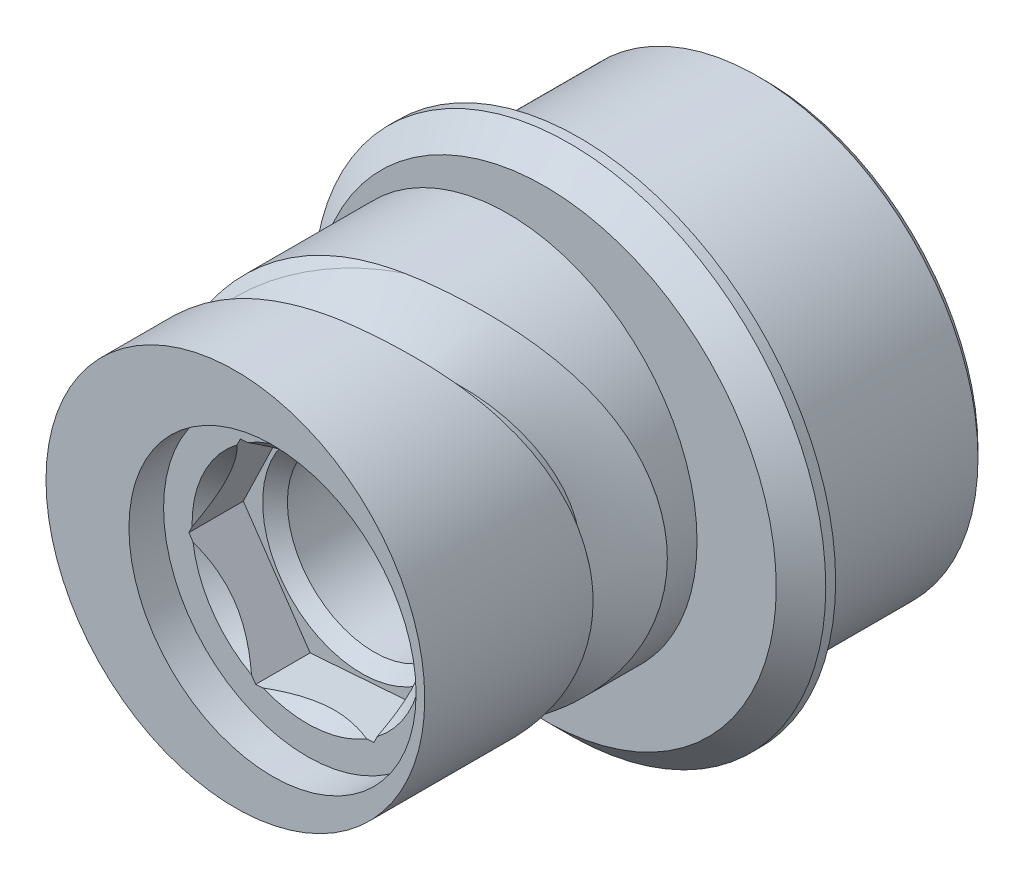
ISO-10303-21;
HEADER;
FILE_DESCRIPTION(('STEP AP214'),'2;1');
FILE_NAME('part.step','',(''),(''),'','','');
FILE_SCHEMA(('AUTOMOTIVE_DESIGN { 1 0 10303 214 1 1 1 1 }'));
ENDSEC;
DATA;
#1=APPLICATION_CONTEXT('core data for automotive mechanical design processes');
#2=APPLICATION_PROTOCOL_DEFINITION('international standard','automotive_design',2000,#1);
#3=PRODUCT_CONTEXT('',#1,'mechanical');
#4=PRODUCT('Part','Part','',(#3));
#5=PRODUCT_RELATED_PRODUCT_CATEGORY('part','',(#4));
#6=PRODUCT_DEFINITION_FORMATION('','',#4);
#7=PRODUCT_DEFINITION_CONTEXT('part definition',#1,'design');
#8=PRODUCT_DEFINITION('design','',#6,#7);
#9=PRODUCT_DEFINITION_SHAPE('','',#8);
#10=(LENGTH_UNIT() NAMED_UNIT(*) SI_UNIT(.MILLI.,.METRE.));
#11=(NAMED_UNIT(*) PLANE_ANGLE_UNIT() SI_UNIT($,.RADIAN.));
#12=(NAMED_UNIT(*) SI_UNIT($,.STERADIAN.) SOLID_ANGLE_UNIT());
#13=UNCERTAINTY_MEASURE_WITH_UNIT(LENGTH_MEASURE(1.E-05),#10,'distance_accuracy_value','');
#14=(GEOMETRIC_REPRESENTATION_CONTEXT(3) GLOBAL_UNCERTAINTY_ASSIGNED_CONTEXT((#13)) GLOBAL_UNIT_ASSIGNED_CONTEXT((#10,
#11,#12)) REPRESENTATION_CONTEXT('',''));
#15=CARTESIAN_POINT('',(0.,0.,0.));
#16=DIRECTION('',(0.,0.,1.));
#17=DIRECTION('',(1.,0.,0.));
#18=AXIS2_PLACEMENT_3D('',#15,#16,#17);
#19=CARTESIAN_POINT('',(0.,0.,18.));
#20=DIRECTION('',(0.,0.,1.));
#21=DIRECTION('',(1.,0.,0.));
#22=AXIS2_PLACEMENT_3D('',#19,#20,#21);
#23=CONICAL_SURFACE('',#22,4.15,0.785398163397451);
#24=CARTESIAN_POINT('',(-1.7819773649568,-4.295220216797,18.5002));
#25=CARTESIAN_POINT('',(-1.6336880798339,-4.28410444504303,18.4331261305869));
#26=CARTESIAN_POINT('',(-1.48309276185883,-4.27281581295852,18.3706495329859));
#27=CARTESIAN_POINT('',(-1.17691228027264,-4.24986450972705,18.2574917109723));
#28=CARTESIAN_POINT('',(-1.02130965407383,-4.2382005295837,18.20685838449));
#29=CARTESIAN_POINT('',(-0.707861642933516,-4.21470445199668,18.1210979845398));
#30=CARTESIAN_POINT('',(-0.550067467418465,-4.20287619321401,18.0857876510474));
#31=CARTESIAN_POINT('',(-0.231790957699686,-4.17901817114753,18.032493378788));
#32=CARTESIAN_POINT('',(-0.071313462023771,-4.16698877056,18.014481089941));
#33=CARTESIAN_POINT('',(0.238864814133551,-4.14373779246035,17.9979259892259));
#34=CARTESIAN_POINT('',(0.38849462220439,-4.13252153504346,17.9980545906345));
#35=CARTESIAN_POINT('',(0.68693073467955,-4.11015075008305,18.0144772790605));
#36=CARTESIAN_POINT('',(0.835736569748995,-4.09899625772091,18.0307797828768));
#37=CARTESIAN_POINT('',(1.13089274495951,-4.0768713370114,18.0782892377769));
#38=CARTESIAN_POINT('',(1.27724331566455,-4.06590089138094,18.1094947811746));
#39=CARTESIAN_POINT('',(1.56662198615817,-4.04420905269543,18.1847738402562));
#40=CARTESIAN_POINT('',(1.70964881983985,-4.03348775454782,18.2288521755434));
#41=CARTESIAN_POINT('',(1.94452711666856,-4.01588126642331,18.3110217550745));
#42=CARTESIAN_POINT('',(2.03743345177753,-4.00891700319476,18.3461521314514));
#43=CARTESIAN_POINT('',(2.22128863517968,-3.995135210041,18.4203557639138));
#44=CARTESIAN_POINT('',(2.31224325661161,-3.98831724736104,18.4594145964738));
#45=CARTESIAN_POINT('',(2.40240510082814,-3.98155871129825,18.5002));
#46=B_SPLINE_CURVE_WITH_KNOTS('',3,(#24,#25,#26,#27,#28,#29,#30,#31,#32,#33,#34,#35,#36,#37,#38,
#39,#40,#41,#42,#43,#44,#45),.UNSPECIFIED.,.F.,.F.,(4,2,2,2,2,2,2,2,2,2,4),(0.,
0.489648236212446,0.981243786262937,1.46678604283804,1.95153117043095,2.40079482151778,
2.85029238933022,3.29974750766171,3.74937111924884,4.04799231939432,4.34555458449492),.UNSPECIFIED.);
#47=CARTESIAN_POINT('',(-1.78153528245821,-4.29518707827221,18.5));
#48=VERTEX_POINT('',#47);
#49=CARTESIAN_POINT('',(2.40196301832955,-3.98159184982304,18.5));
#50=VERTEX_POINT('',#49);
#51=EDGE_CURVE('E168',#48,#50,#46,.T.);
#52=ORIENTED_EDGE('',*,*,#51,.F.);
#53=CARTESIAN_POINT('',(0.,0.,18.5));
#54=DIRECTION('',(0.,0.,1.));
#55=DIRECTION('',(1.,0.,0.));
#56=AXIS2_PLACEMENT_3D('',#53,#54,#55);
#57=CIRCLE('',#56,4.65);
#58=EDGE_CURVE('E409',#50,#48,#57,.F.);
#59=ORIENTED_EDGE('',*,*,#58,.F.);
#60=EDGE_LOOP('',(#52,#59));
#61=FACE_BOUND('',#60,.T.);
#62=ADVANCED_FACE('F36',(#61),#23,.F.);
#63=CARTESIAN_POINT('',(-4.6107585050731,-0.604372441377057,18.5002));
#64=CARTESIAN_POINT('',(-4.52698732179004,-0.727236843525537,18.4331261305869));
#65=CARTESIAN_POINT('',(-4.44191342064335,-0.852011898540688,18.3706495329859));
#66=CARTESIAN_POINT('',(-4.26894676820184,-1.10569632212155,18.2574917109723));
#67=CARTESIAN_POINT('',(-4.18104415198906,-1.23462015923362,18.20685838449));
#68=CARTESIAN_POINT('',(-4.00397194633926,-1.49432606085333,18.1210979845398));
#69=CARTESIAN_POINT('',(-3.9148312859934,-1.62506569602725,18.0857876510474));
#70=CARTESIAN_POINT('',(-3.73503137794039,-1.88877222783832,18.032493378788));
#71=CARTESIAN_POINT('',(-3.64437486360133,-2.0217351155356,18.014481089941));
#72=CARTESIAN_POINT('',(-3.46914978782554,-2.27873189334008,17.9979259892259));
#73=CARTESIAN_POINT('',(-3.3846213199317,-2.40270697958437,17.9980545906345));
#74=CARTESIAN_POINT('',(-3.21602959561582,-2.64997484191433,18.0144772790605));
#75=CARTESIAN_POINT('',(-3.13196660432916,-2.77326722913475,18.0307797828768));
#76=CARTESIAN_POINT('',(-2.96522777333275,-3.01781751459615,18.0782892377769));
#77=CARTESIAN_POINT('',(-2.88255180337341,-3.13907560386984,18.1094947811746));
#78=CARTESIAN_POINT('',(-2.71907678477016,-3.37883896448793,18.1847738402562));
#79=CARTESIAN_POINT('',(-2.63827845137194,-3.49734318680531,18.2288521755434));
#80=CARTESIAN_POINT('',(-2.50559163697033,-3.69195051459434,18.3110217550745));
#81=CARTESIAN_POINT('',(-2.45310724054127,-3.76892762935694,18.3461521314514));
#82=CARTESIAN_POINT('',(-2.34924426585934,-3.92125999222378,18.4203557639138));
#83=CARTESIAN_POINT('',(-2.29786242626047,-3.99662002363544,18.4594145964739));
#84=CARTESIAN_POINT('',(-2.24692844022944,-4.07132320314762,18.5002));
#85=B_SPLINE_CURVE_WITH_KNOTS('',3,(#63,#64,#65,#66,#67,#68,#69,#70,#71,#72,#73,#74,#75,#76,#77,
#78,#79,#80,#81,#82,#83,#84),.UNSPECIFIED.,.F.,.F.,(4,2,2,2,2,2,2,2,2,2,4),(0.,
0.489648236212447,0.981243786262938,1.46678604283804,1.95153117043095,2.40079482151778,
2.85029238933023,3.29974750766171,3.74937111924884,4.04799231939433,4.34555458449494),.UNSPECIFIED.);
#86=CARTESIAN_POINT('',(-4.6105087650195,-0.604738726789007,18.5));
#87=VERTEX_POINT('',#86);
#88=CARTESIAN_POINT('',(-2.24717818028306,-4.07095691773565,18.5));
#89=VERTEX_POINT('',#88);
#90=EDGE_CURVE('E443',#87,#89,#85,.T.);
#91=ORIENTED_EDGE('',*,*,#90,.F.);
#92=EDGE_CURVE('E509',#89,#87,#57,.F.);
#93=ORIENTED_EDGE('',*,*,#92,.F.);
#94=EDGE_LOOP('',(#91,#93));
#95=FACE_BOUND('',#94,.T.);
#96=ADVANCED_FACE('F469',(#95),#23,.F.);
#97=CARTESIAN_POINT('',(-2.82878114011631,3.69084777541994,18.5002));
#98=CARTESIAN_POINT('',(-2.89329924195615,3.55686760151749,18.4331261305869));
#99=CARTESIAN_POINT('',(-2.95882065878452,3.42080391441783,18.3706495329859));
#100=CARTESIAN_POINT('',(-3.09203448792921,3.1441681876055,18.2574917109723));
#101=CARTESIAN_POINT('',(-3.15973449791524,3.00358037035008,18.20685838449));
#102=CARTESIAN_POINT('',(-3.29611030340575,2.72037839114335,18.1210979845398));
#103=CARTESIAN_POINT('',(-3.36476381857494,2.57781049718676,18.0857876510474));
#104=CARTESIAN_POINT('',(-3.50324042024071,2.29024594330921,18.032493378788));
#105=CARTESIAN_POINT('',(-3.57306140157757,2.1452536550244,18.014481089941));
#106=CARTESIAN_POINT('',(-3.7080146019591,1.86500589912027,17.9979259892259));
#107=CARTESIAN_POINT('',(-3.7731159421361,1.72981455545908,17.9980545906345));
#108=CARTESIAN_POINT('',(-3.90296033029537,1.46017590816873,18.0144772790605));
#109=CARTESIAN_POINT('',(-3.96770317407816,1.32572902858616,18.0307797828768));
#110=CARTESIAN_POINT('',(-4.09612051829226,1.05905382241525,18.0782892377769));
#111=CARTESIAN_POINT('',(-4.15979511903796,0.926825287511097,18.1094947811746));
#112=CARTESIAN_POINT('',(-4.28569877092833,0.665370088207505,18.1847738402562));
#113=CARTESIAN_POINT('',(-4.3479272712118,0.536144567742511,18.2288521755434));
#114=CARTESIAN_POINT('',(-4.45011875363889,0.323930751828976,18.3110217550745));
#115=CARTESIAN_POINT('',(-4.49054069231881,0.239989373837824,18.3461521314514));
#116=CARTESIAN_POINT('',(-4.57053290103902,0.0738752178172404,18.4203557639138));
#117=CARTESIAN_POINT('',(-4.61010568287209,-0.0083027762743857,18.4594145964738));
#118=CARTESIAN_POINT('',(-4.64933354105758,-0.0897644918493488,18.5002));
#119=B_SPLINE_CURVE_WITH_KNOTS('',3,(#97,#98,#99,#100,#101,#102,#103,#104,#105,#106,#107,#108,
#109,#110,#111,#112,#113,#114,#115,#116,#117,#118),.UNSPECIFIED.,.F.,.F.,(4,2,2,2,2,2,2,2,2,2,
4),(0.,0.489648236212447,0.981243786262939,1.46678604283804,1.95153117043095,2.40079482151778,
2.85029238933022,3.29974750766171,3.74937111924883,4.04799231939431,4.34555458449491),.UNSPECIFIED.);
#120=CARTESIAN_POINT('',(-2.82897348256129,3.6904483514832,18.5));
#121=VERTEX_POINT('',#120);
#122=CARTESIAN_POINT('',(-4.6491411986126,-0.0893650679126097,18.5));
#123=VERTEX_POINT('',#122);
#124=EDGE_CURVE('E519',#121,#123,#119,.T.);
#125=ORIENTED_EDGE('',*,*,#124,.F.);
#126=EDGE_CURVE('E505',#123,#121,#57,.F.);
#127=ORIENTED_EDGE('',*,*,#126,.F.);
#128=EDGE_LOOP('',(#125,#127));
#129=FACE_BOUND('',#128,.T.);
#130=ADVANCED_FACE('F474',(#129),#23,.F.);
#131=CARTESIAN_POINT('',(1.78197736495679,4.295220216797,18.5002));
#132=CARTESIAN_POINT('',(1.6336880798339,4.28410444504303,18.4331261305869));
#133=CARTESIAN_POINT('',(1.48309276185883,4.27281581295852,18.3706495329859));
#134=CARTESIAN_POINT('',(1.17691228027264,4.24986450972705,18.2574917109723));
#135=CARTESIAN_POINT('',(1.02130965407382,4.23820052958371,18.20685838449));
#136=CARTESIAN_POINT('',(0.707861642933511,4.21470445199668,18.1210979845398));
#137=CARTESIAN_POINT('',(0.550067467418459,4.20287619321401,18.0857876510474));
#138=CARTESIAN_POINT('',(0.23179095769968,4.17901817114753,18.032493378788));
#139=CARTESIAN_POINT('',(0.0713134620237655,4.16698877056,18.014481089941));
#140=CARTESIAN_POINT('',(-0.238864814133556,4.14373779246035,17.9979259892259));
#141=CARTESIAN_POINT('',(-0.388494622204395,4.13252153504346,17.9980545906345));
#142=CARTESIAN_POINT('',(-0.686930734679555,4.11015075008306,18.0144772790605));
#143=CARTESIAN_POINT('',(-0.835736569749,4.09899625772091,18.0307797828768));
#144=CARTESIAN_POINT('',(-1.13089274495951,4.0768713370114,18.0782892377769));
#145=CARTESIAN_POINT('',(-1.27724331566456,4.06590089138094,18.1094947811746));
#146=CARTESIAN_POINT('',(-1.56662198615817,4.04420905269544,18.1847738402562));
#147=CARTESIAN_POINT('',(-1.70964881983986,4.03348775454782,18.2288521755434));
#148=CARTESIAN_POINT('',(-1.94452711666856,4.01588126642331,18.3110217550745));
#149=CARTESIAN_POINT('',(-2.03743345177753,4.00891700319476,18.3461521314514));
#150=CARTESIAN_POINT('',(-2.22128863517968,3.995135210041,18.4203557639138));
#151=CARTESIAN_POINT('',(-2.3122432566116,3.98831724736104,18.4594145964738));
#152=CARTESIAN_POINT('',(-2.40240510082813,3.98155871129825,18.5002));
#153=B_SPLINE_CURVE_WITH_KNOTS('',3,(#131,#132,#133,#134,#135,#136,#137,#138,#139,#140,#141,
#142,#143,#144,#145,#146,#147,#148,#149,#150,#151,#152),.UNSPECIFIED.,.F.,.F.,(4,2,2,2,2,2,2,2,
2,2,4),(0.,0.489648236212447,0.981243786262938,1.46678604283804,1.95153117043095,
2.40079482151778,2.85029238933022,3.29974750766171,3.74937111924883,4.04799231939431,
4.34555458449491),.UNSPECIFIED.);
#154=CARTESIAN_POINT('',(1.78153528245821,4.29518707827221,18.5));
#155=VERTEX_POINT('',#154);
#156=CARTESIAN_POINT('',(-2.40196301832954,3.98159184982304,18.5));
#157=VERTEX_POINT('',#156);
#158=EDGE_CURVE('E500',#155,#157,#153,.T.);
#159=ORIENTED_EDGE('',*,*,#158,.F.);
#160=EDGE_CURVE('E503',#157,#155,#57,.F.);
#161=ORIENTED_EDGE('',*,*,#160,.F.);
#162=EDGE_LOOP('',(#159,#161));
#163=FACE_BOUND('',#162,.T.);
#164=ADVANCED_FACE('F487',(#163),#23,.F.);
#165=CARTESIAN_POINT('',(4.6107585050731,0.604372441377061,18.5002));
#166=CARTESIAN_POINT('',(4.52698732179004,0.72723684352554,18.4331261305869));
#167=CARTESIAN_POINT('',(4.44191342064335,0.852011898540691,18.3706495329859));
#168=CARTESIAN_POINT('',(4.26894676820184,1.10569632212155,18.2574917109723));
#169=CARTESIAN_POINT('',(4.18104415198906,1.23462015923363,18.20685838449));
#170=CARTESIAN_POINT('',(4.00397194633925,1.49432606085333,18.1210979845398));
#171=CARTESIAN_POINT('',(3.9148312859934,1.62506569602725,18.0857876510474));
#172=CARTESIAN_POINT('',(3.73503137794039,1.88877222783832,18.032493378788));
#173=CARTESIAN_POINT('',(3.64437486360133,2.0217351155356,18.014481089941));
#174=CARTESIAN_POINT('',(3.46914978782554,2.27873189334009,17.9979259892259));
#175=CARTESIAN_POINT('',(3.3846213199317,2.40270697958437,17.9980545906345));
#176=CARTESIAN_POINT('',(3.21602959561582,2.64997484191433,18.0144772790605));
#177=CARTESIAN_POINT('',(3.13196660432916,2.77326722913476,18.0307797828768));
#178=CARTESIAN_POINT('',(2.96522777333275,3.01781751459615,18.0782892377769));
#179=CARTESIAN_POINT('',(2.88255180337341,3.13907560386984,18.1094947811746));
#180=CARTESIAN_POINT('',(2.71907678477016,3.37883896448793,18.1847738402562));
#181=CARTESIAN_POINT('',(2.63827845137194,3.49734318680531,18.2288521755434));
#182=CARTESIAN_POINT('',(2.50559163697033,3.69195051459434,18.3110217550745));
#183=CARTESIAN_POINT('',(2.45310724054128,3.76892762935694,18.3461521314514));
#184=CARTESIAN_POINT('',(2.34924426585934,3.92125999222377,18.4203557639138));
#185=CARTESIAN_POINT('',(2.29786242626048,3.99662002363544,18.4594145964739));
#186=CARTESIAN_POINT('',(2.24692844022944,4.07132320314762,18.5002));
#187=B_SPLINE_CURVE_WITH_KNOTS('',3,(#165,#166,#167,#168,#169,#170,#171,#172,#173,#174,#175,
#176,#177,#178,#179,#180,#181,#182,#183,#184,#185,#186),.UNSPECIFIED.,.F.,.F.,(4,2,2,2,2,2,2,2,
2,2,4),(0.,0.489648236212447,0.981243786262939,1.46678604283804,1.95153117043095,
2.40079482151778,2.85029238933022,3.29974750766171,3.74937111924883,4.04799231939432,
4.34555458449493),.UNSPECIFIED.);
#188=CARTESIAN_POINT('',(4.6105087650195,0.60473872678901,18.5));
#189=VERTEX_POINT('',#188);
#190=CARTESIAN_POINT('',(2.24717818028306,4.07095691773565,18.5));
#191=VERTEX_POINT('',#190);
#192=EDGE_CURVE('E417',#189,#191,#187,.T.);
#193=ORIENTED_EDGE('',*,*,#192,.F.);
#194=EDGE_CURVE('E408',#191,#189,#57,.F.);
#195=ORIENTED_EDGE('',*,*,#194,.F.);
#196=EDGE_LOOP('',(#193,#195));
#197=FACE_BOUND('',#196,.T.);
#198=ADVANCED_FACE('F479',(#197),#23,.F.);
#199=CARTESIAN_POINT('',(0.,0.,19.9));
#200=DIRECTION('',(0.,0.,-1.));
#201=DIRECTION('',(-1.,0.,0.));
#202=AXIS2_PLACEMENT_3D('',#199,#200,#201);
#203=CYLINDRICAL_SURFACE('',#202,3.49857113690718);
#204=CARTESIAN_POINT('',(0.,0.,15.8));
#205=DIRECTION('',(0.,0.,1.));
#206=DIRECTION('',(1.,0.,0.));
#207=AXIS2_PLACEMENT_3D('',#204,#205,#206);
#208=CIRCLE('',#207,3.49857113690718);
#209=CARTESIAN_POINT('',(-3.49857113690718,0.,15.8));
#210=VERTEX_POINT('',#209);
#211=EDGE_CURVE('E451',#210,#210,#208,.T.);
#212=CARTESIAN_POINT('',(0.,0.,2.));
#213=DIRECTION('',(0.,0.,-1.));
#214=DIRECTION('',(-1.,0.,0.));
#215=AXIS2_PLACEMENT_3D('',#212,#213,#214);
#216=CIRCLE('',#215,3.49857113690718);
#217=CARTESIAN_POINT('',(-3.49857113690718,0.,2.));
#218=VERTEX_POINT('',#217);
#219=EDGE_CURVE('E246',#218,#218,#216,.T.);
#220=CARTESIAN_POINT('',(-3.49857113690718,0.,15.8));
#221=CARTESIAN_POINT('',(-3.49857113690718,0.,15.65625));
#222=CARTESIAN_POINT('',(-3.49857113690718,0.,15.5125));
#223=CARTESIAN_POINT('',(-3.49857113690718,0.,15.225));
#224=CARTESIAN_POINT('',(-3.49857113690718,0.,15.08125));
#225=CARTESIAN_POINT('',(-3.49857113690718,0.,14.79375));
#226=CARTESIAN_POINT('',(-3.49857113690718,0.,14.65));
#227=CARTESIAN_POINT('',(-3.49857113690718,0.,14.3625));
#228=CARTESIAN_POINT('',(-3.49857113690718,0.,14.21875));
#229=CARTESIAN_POINT('',(-3.49857113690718,0.,13.93125));
#230=CARTESIAN_POINT('',(-3.49857113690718,0.,13.7875));
#231=CARTESIAN_POINT('',(-3.49857113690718,0.,13.5));
#232=CARTESIAN_POINT('',(-3.49857113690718,0.,13.35625));
#233=CARTESIAN_POINT('',(-3.49857113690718,0.,13.06875));
#234=CARTESIAN_POINT('',(-3.49857113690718,0.,12.925));
#235=CARTESIAN_POINT('',(-3.49857113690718,0.,12.6375));
#236=CARTESIAN_POINT('',(-3.49857113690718,0.,12.49375));
#237=CARTESIAN_POINT('',(-3.49857113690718,0.,12.20625));
#238=CARTESIAN_POINT('',(-3.49857113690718,0.,12.0625));
#239=CARTESIAN_POINT('',(-3.49857113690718,0.,11.775));
#240=CARTESIAN_POINT('',(-3.49857113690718,0.,11.63125));
#241=CARTESIAN_POINT('',(-3.49857113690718,0.,11.34375));
#242=CARTESIAN_POINT('',(-3.49857113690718,0.,11.2));
#243=CARTESIAN_POINT('',(-3.49857113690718,0.,10.9125));
#244=CARTESIAN_POINT('',(-3.49857113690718,0.,10.76875));
#245=CARTESIAN_POINT('',(-3.49857113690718,0.,10.48125));
#246=CARTESIAN_POINT('',(-3.49857113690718,0.,10.3375));
#247=CARTESIAN_POINT('',(-3.49857113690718,0.,10.05));
#248=CARTESIAN_POINT('',(-3.49857113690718,0.,9.90625));
#249=CARTESIAN_POINT('',(-3.49857113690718,0.,9.61875));
#250=CARTESIAN_POINT('',(-3.49857113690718,0.,9.475));
#251=CARTESIAN_POINT('',(-3.49857113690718,0.,9.1875));
#252=CARTESIAN_POINT('',(-3.49857113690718,0.,9.04375));
#253=CARTESIAN_POINT('',(-3.49857113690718,0.,8.75625));
#254=CARTESIAN_POINT('',(-3.49857113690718,0.,8.6125));
#255=CARTESIAN_POINT('',(-3.49857113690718,0.,8.325));
#256=CARTESIAN_POINT('',(-3.49857113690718,0.,8.18125));
#257=CARTESIAN_POINT('',(-3.49857113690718,0.,7.89375));
#258=CARTESIAN_POINT('',(-3.49857113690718,0.,7.75));
#259=CARTESIAN_POINT('',(-3.49857113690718,0.,7.4625));
#260=CARTESIAN_POINT('',(-3.49857113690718,0.,7.31875));
#261=CARTESIAN_POINT('',(-3.49857113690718,0.,7.03125));
#262=CARTESIAN_POINT('',(-3.49857113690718,0.,6.8875));
#263=CARTESIAN_POINT('',(-3.49857113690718,0.,6.6));
#264=CARTESIAN_POINT('',(-3.49857113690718,0.,6.45625));
#265=CARTESIAN_POINT('',(-3.49857113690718,0.,6.16875));
#266=CARTESIAN_POINT('',(-3.49857113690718,0.,6.025));
#267=CARTESIAN_POINT('',(-3.49857113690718,0.,5.7375));
#268=CARTESIAN_POINT('',(-3.49857113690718,0.,5.59375));
#269=CARTESIAN_POINT('',(-3.49857113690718,0.,5.30625));
#270=CARTESIAN_POINT('',(-3.49857113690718,0.,5.1625));
#271=CARTESIAN_POINT('',(-3.49857113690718,0.,4.875));
#272=CARTESIAN_POINT('',(-3.49857113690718,0.,4.73125));
#273=CARTESIAN_POINT('',(-3.49857113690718,0.,4.44375));
#274=CARTESIAN_POINT('',(-3.49857113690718,0.,4.3));
#275=CARTESIAN_POINT('',(-3.49857113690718,0.,4.0125));
#276=CARTESIAN_POINT('',(-3.49857113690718,0.,3.86875));
#277=CARTESIAN_POINT('',(-3.49857113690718,0.,3.58125));
#278=CARTESIAN_POINT('',(-3.49857113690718,0.,3.4375));
#279=CARTESIAN_POINT('',(-3.49857113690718,0.,3.15));
#280=CARTESIAN_POINT('',(-3.49857113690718,0.,3.00625));
#281=CARTESIAN_POINT('',(-3.49857113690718,0.,2.71875));
#282=CARTESIAN_POINT('',(-3.49857113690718,0.,2.575));
#283=CARTESIAN_POINT('',(-3.49857113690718,0.,2.2875));
#284=CARTESIAN_POINT('',(-3.49857113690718,0.,2.14375));
#285=CARTESIAN_POINT('',(-3.49857113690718,0.,2.));
#286=B_SPLINE_CURVE_WITH_KNOTS('',3,(#220,#221,#222,#223,#224,#225,#226,#227,#228,#229,#230,
#231,#232,#233,#234,#235,#236,#237,#238,#239,#240,#241,#242,#243,#244,#245,#246,#247,#248,#249,
#250,#251,#252,#253,#254,#255,#256,#257,#258,#259,#260,#261,#262,#263,#264,#265,#266,#267,#268,
#269,#270,#271,#272,#273,#274,#275,#276,#277,#278,#279,#280,#281,#282,#283,#284,#285),
.UNSPECIFIED.,.F.,.F.,(4,2,2,2,2,2,2,2,2,2,2,2,2,2,2,2,2,2,2,2,2,2,2,2,2,2,2,2,2,2,2,2,4),(0.,
0.431250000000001,0.862500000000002,1.29375,1.725,2.15625,2.5875,3.01875,3.45,3.88125,4.3125,
4.74375,5.175,5.60625,6.0375,6.46875,6.9,7.33125,7.7625,8.19375,8.625,9.05625,9.4875,9.91875,
10.35,10.78125,11.2125,11.64375,12.075,12.50625,12.9375,13.36875,13.8),.UNSPECIFIED.);
#287=EDGE_CURVE('BSEAM486',#210,#218,#286,.T.);
#288=ORIENTED_EDGE('',*,*,#211,.T.);
#289=ORIENTED_EDGE('',*,*,#219,.T.);
#290=ORIENTED_EDGE('',*,*,#287,.T.);
#291=ORIENTED_EDGE('',*,*,#287,.F.);
#292=EDGE_LOOP('',(#288,#290,#289,#291));
#293=FACE_BOUND('',#292,.T.);
#294=ADVANCED_FACE('F486',(#293),#203,.F.);
#295=CARTESIAN_POINT('',(0.,0.,8.9));
#296=DIRECTION('',(0.,0.,1.));
#297=DIRECTION('',(1.,0.,0.));
#298=AXIS2_PLACEMENT_3D('',#295,#296,#297);
#299=PLANE('',#298);
#300=CARTESIAN_POINT('',(0.,0.,8.9));
#301=DIRECTION('',(0.,0.,1.));
#302=DIRECTION('',(1.,0.,0.));
#303=AXIS2_PLACEMENT_3D('',#300,#301,#302);
#304=CIRCLE('',#303,9.34999999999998);
#305=CARTESIAN_POINT('',(9.34999999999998,0.,8.9));
#306=VERTEX_POINT('',#305);
#307=EDGE_CURVE('E300',#306,#306,#304,.T.);
#308=ORIENTED_EDGE('',*,*,#307,.T.);
#309=EDGE_LOOP('',(#308));
#310=FACE_BOUND('',#309,.T.);
#311=CARTESIAN_POINT('',(-1.5,0.,8.9));
#312=DIRECTION('',(0.,0.,1.));
#313=DIRECTION('',(1.,0.,0.));
#314=AXIS2_PLACEMENT_3D('',#311,#312,#313);
#315=CIRCLE('',#314,7.65);
#316=CARTESIAN_POINT('',(6.15,0.,8.9));
#317=VERTEX_POINT('',#316);
#318=EDGE_CURVE('E271',#317,#317,#315,.T.);
#319=ORIENTED_EDGE('',*,*,#318,.F.);
#320=EDGE_LOOP('',(#319));
#321=FACE_BOUND('',#320,.T.);
#322=ADVANCED_FACE('F493',(#310,#321),#299,.T.);
#323=CARTESIAN_POINT('',(0.,0.,7.5));
#324=DIRECTION('',(0.,0.,-1.));
#325=DIRECTION('',(-1.,0.,0.));
#326=AXIS2_PLACEMENT_3D('',#323,#324,#325);
#327=CYLINDRICAL_SURFACE('',#326,8.9);
#328=CARTESIAN_POINT('',(0.,0.,0.3));
#329=DIRECTION('',(0.,0.,1.));
#330=DIRECTION('',(1.,0.,0.));
#331=AXIS2_PLACEMENT_3D('',#328,#329,#330);
#332=CIRCLE('',#331,8.9);
#333=CARTESIAN_POINT('',(8.9,0.,0.3));
#334=VERTEX_POINT('',#333);
#335=EDGE_CURVE('E44',#334,#334,#332,.T.);
#336=ORIENTED_EDGE('',*,*,#335,.T.);
#337=EDGE_LOOP('',(#336));
#338=FACE_BOUND('',#337,.T.);
#339=CARTESIAN_POINT('',(0.,0.,7.5));
#340=DIRECTION('',(0.,0.,1.));
#341=DIRECTION('',(1.,0.,0.));
#342=AXIS2_PLACEMENT_3D('',#339,#340,#341);
#343=CIRCLE('',#342,8.9);
#344=CARTESIAN_POINT('',(8.9,0.,7.5));
#345=VERTEX_POINT('',#344);
#346=EDGE_CURVE('E296',#345,#345,#343,.T.);
#347=ORIENTED_EDGE('',*,*,#346,.F.);
#348=EDGE_LOOP('',(#347));
#349=FACE_BOUND('',#348,.T.);
#350=ADVANCED_FACE('F38',(#338,#349),#327,.T.);
#351=CARTESIAN_POINT('',(0.,0.,0.));
#352=DIRECTION('',(0.,0.,1.));
#353=DIRECTION('',(1.,0.,0.));
#354=AXIS2_PLACEMENT_3D('',#351,#352,#353);
#355=PLANE('',#354);
#356=CARTESIAN_POINT('',(0.,0.,0.));
#357=DIRECTION('',(0.,0.,1.));
#358=DIRECTION('',(1.,0.,0.));
#359=AXIS2_PLACEMENT_3D('',#356,#357,#358);
#360=CIRCLE('',#359,8.6);
#361=CARTESIAN_POINT('',(8.6,0.,0.));
#362=VERTEX_POINT('',#361);
#363=EDGE_CURVE('E11',#362,#362,#360,.F.);
#364=ORIENTED_EDGE('',*,*,#363,.T.);
#365=EDGE_LOOP('',(#364));
#366=FACE_BOUND('',#365,.T.);
#367=CARTESIAN_POINT('',(0.,0.,0.));
#368=DIRECTION('',(0.,0.,1.));
#369=DIRECTION('',(1.,0.,0.));
#370=AXIS2_PLACEMENT_3D('',#367,#368,#369);
#371=CIRCLE('',#370,7.);
#372=CARTESIAN_POINT('',(7.,0.,0.));
#373=VERTEX_POINT('',#372);
#374=EDGE_CURVE('E309',#373,#373,#371,.T.);
#375=ORIENTED_EDGE('',*,*,#374,.T.);
#376=EDGE_LOOP('',(#375));
#377=FACE_BOUND('',#376,.T.);
#378=ADVANCED_FACE('F748',(#366,#377),#355,.F.);
#379=CARTESIAN_POINT('',(0.,0.,7.5));
#380=DIRECTION('',(0.,0.,1.));
#381=DIRECTION('',(1.,0.,0.));
#382=AXIS2_PLACEMENT_3D('',#379,#380,#381);
#383=PLANE('',#382);
#384=CARTESIAN_POINT('',(0.,0.,7.5));
#385=DIRECTION('',(0.,0.,1.));
#386=DIRECTION('',(1.,0.,0.));
#387=AXIS2_PLACEMENT_3D('',#384,#385,#386);
#388=CIRCLE('',#387,10.35);
#389=CARTESIAN_POINT('',(10.35,0.,7.5));
#390=VERTEX_POINT('',#389);
#391=EDGE_CURVE('E292',#390,#390,#388,.T.);
#392=ORIENTED_EDGE('',*,*,#391,.F.);
#393=EDGE_LOOP('',(#392));
#394=FACE_BOUND('',#393,.T.);
#395=ORIENTED_EDGE('',*,*,#346,.T.);
#396=EDGE_LOOP('',(#395));
#397=FACE_BOUND('',#396,.T.);
#398=ADVANCED_FACE('F740',(#394,#397),#383,.F.);
#399=CARTESIAN_POINT('',(0.,0.,8.9));
#400=DIRECTION('',(0.,0.,-1.));
#401=DIRECTION('',(-1.,0.,0.));
#402=AXIS2_PLACEMENT_3D('',#399,#400,#401);
#403=CYLINDRICAL_SURFACE('',#402,10.35);
#404=CARTESIAN_POINT('',(0.,0.,7.89999999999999));
#405=DIRECTION('',(0.,0.,1.));
#406=DIRECTION('',(1.,0.,0.));
#407=AXIS2_PLACEMENT_3D('',#404,#405,#406);
#408=CIRCLE('',#407,10.35);
#409=CARTESIAN_POINT('',(10.35,0.,7.89999999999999));
#410=VERTEX_POINT('',#409);
#411=EDGE_CURVE('E303',#410,#410,#408,.F.);
#412=ORIENTED_EDGE('',*,*,#411,.T.);
#413=EDGE_LOOP('',(#412));
#414=FACE_BOUND('',#413,.T.);
#415=ORIENTED_EDGE('',*,*,#391,.T.);
#416=EDGE_LOOP('',(#415));
#417=FACE_BOUND('',#416,.T.);
#418=ADVANCED_FACE('F732',(#414,#417),#403,.T.);
#419=CARTESIAN_POINT('',(0.,0.,8.9));
#420=DIRECTION('',(0.,0.,-1.));
#421=DIRECTION('',(-1.,0.,0.));
#422=AXIS2_PLACEMENT_3D('',#419,#420,#421);
#423=CONICAL_SURFACE('',#422,9.34999999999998,0.785398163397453);
#424=ORIENTED_EDGE('',*,*,#411,.F.);
#425=EDGE_LOOP('',(#424));
#426=FACE_BOUND('',#425,.T.);
#427=ORIENTED_EDGE('',*,*,#307,.F.);
#428=EDGE_LOOP('',(#427));
#429=FACE_BOUND('',#428,.T.);
#430=ADVANCED_FACE('F724',(#426,#429),#423,.T.);
#431=CARTESIAN_POINT('',(0.,0.,2.));
#432=DIRECTION('',(0.,0.,-1.));
#433=DIRECTION('',(-1.,0.,0.));
#434=AXIS2_PLACEMENT_3D('',#431,#432,#433);
#435=CYLINDRICAL_SURFACE('',#434,6.5);
#436=CARTESIAN_POINT('',(0.,0.,0.499999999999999));
#437=DIRECTION('',(0.,0.,1.));
#438=DIRECTION('',(1.,0.,0.));
#439=AXIS2_PLACEMENT_3D('',#436,#437,#438);
#440=CIRCLE('',#439,6.5);
#441=CARTESIAN_POINT('',(6.5,0.,0.499999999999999));
#442=VERTEX_POINT('',#441);
#443=EDGE_CURVE('E306',#442,#442,#440,.F.);
#444=ORIENTED_EDGE('',*,*,#443,.T.);
#445=EDGE_LOOP('',(#444));
#446=FACE_BOUND('',#445,.T.);
#447=CARTESIAN_POINT('',(0.,0.,2.));
#448=DIRECTION('',(0.,0.,-1.));
#449=DIRECTION('',(-1.,0.,0.));
#450=AXIS2_PLACEMENT_3D('',#447,#448,#449);
#451=CIRCLE('',#450,6.5);
#452=CARTESIAN_POINT('',(-6.5,0.,2.));
#453=VERTEX_POINT('',#452);
#454=EDGE_CURVE('E289',#453,#453,#451,.T.);
#455=ORIENTED_EDGE('',*,*,#454,.F.);
#456=EDGE_LOOP('',(#455));
#457=FACE_BOUND('',#456,.T.);
#458=ADVANCED_FACE('F716',(#446,#457),#435,.F.);
#459=CARTESIAN_POINT('',(0.,0.,2.));
#460=DIRECTION('',(0.,0.,-1.));
#461=DIRECTION('',(-1.,0.,0.));
#462=AXIS2_PLACEMENT_3D('',#459,#460,#461);
#463=PLANE('',#462);
#464=ORIENTED_EDGE('',*,*,#219,.F.);
#465=EDGE_LOOP('',(#464));
#466=FACE_BOUND('',#465,.T.);
#467=ORIENTED_EDGE('',*,*,#454,.T.);
#468=EDGE_LOOP('',(#467));
#469=FACE_BOUND('',#468,.T.);
#470=ADVANCED_FACE('F709',(#466,#469),#463,.T.);
#471=CARTESIAN_POINT('',(0.,0.,0.499999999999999));
#472=DIRECTION('',(0.,0.,-1.));
#473=DIRECTION('',(-1.,0.,0.));
#474=AXIS2_PLACEMENT_3D('',#471,#472,#473);
#475=CONICAL_SURFACE('',#474,6.5,0.78539816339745);
#476=ORIENTED_EDGE('',*,*,#374,.F.);
#477=EDGE_LOOP('',(#476));
#478=FACE_BOUND('',#477,.T.);
#479=ORIENTED_EDGE('',*,*,#443,.F.);
#480=EDGE_LOOP('',(#479));
#481=FACE_BOUND('',#480,.T.);
#482=ADVANCED_FACE('F701',(#478,#481),#475,.F.);
#483=CARTESIAN_POINT('',(-1.5,0.,19.9));
#484=DIRECTION('',(0.,0.,-1.));
#485=DIRECTION('',(-1.,0.,0.));
#486=AXIS2_PLACEMENT_3D('',#483,#484,#485);
#487=CYLINDRICAL_SURFACE('',#486,7.65);
#488=CARTESIAN_POINT('',(-9.15,1.30668315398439E-09,15.1));
#489=CARTESIAN_POINT('',(-9.15002052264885,0.167056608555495,15.0999671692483));
#490=CARTESIAN_POINT('',(-9.14452891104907,0.334048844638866,15.0955370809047));
#491=CARTESIAN_POINT('',(-9.12270259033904,0.666772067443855,15.0790120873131));
#492=CARTESIAN_POINT('',(-9.10637944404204,0.832504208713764,15.0669253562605));
#493=CARTESIAN_POINT('',(-9.06313759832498,1.16142477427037,15.0362594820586));
#494=CARTESIAN_POINT('',(-9.0362518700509,1.32461948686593,15.0177005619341));
#495=CARTESIAN_POINT('',(-8.97213546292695,1.64830998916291,14.9752757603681));
#496=CARTESIAN_POINT('',(-8.93490066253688,1.80880467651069,14.9514077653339));
#497=CARTESIAN_POINT('',(-8.83729844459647,2.17550249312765,14.8916747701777));
#498=CARTESIAN_POINT('',(-8.77333831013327,2.38052357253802,14.854380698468));
#499=CARTESIAN_POINT('',(-8.62876853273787,2.78371097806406,14.7752848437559));
#500=CARTESIAN_POINT('',(-8.54815612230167,2.98187615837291,14.7334823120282));
#501=CARTESIAN_POINT('',(-8.37070635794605,3.37070342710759,14.6473511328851));
#502=CARTESIAN_POINT('',(-8.2738383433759,3.5613504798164,14.6030178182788));
#503=CARTESIAN_POINT('',(-8.06460316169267,3.93371311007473,14.5134006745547));
#504=CARTESIAN_POINT('',(-7.9522352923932,4.11542828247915,14.4681168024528));
#505=CARTESIAN_POINT('',(-7.71181178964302,4.47013597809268,14.3775815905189));
#506=CARTESIAN_POINT('',(-7.58365116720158,4.64305799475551,14.3323327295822));
#507=CARTESIAN_POINT('',(-7.31304809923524,4.97767724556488,14.2430316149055));
#508=CARTESIAN_POINT('',(-7.17060552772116,5.13937438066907,14.1989793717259));
#509=CARTESIAN_POINT('',(-6.87244756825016,5.45028937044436,14.1127051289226));
#510=CARTESIAN_POINT('',(-6.7167435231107,5.59951767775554,14.0704816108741));
#511=CARTESIAN_POINT('',(-6.39299190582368,5.88452558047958,13.9880409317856));
#512=CARTESIAN_POINT('',(-6.22494469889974,6.02030557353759,13.94782371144));
#513=CARTESIAN_POINT('',(-5.87512893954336,6.27923382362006,13.8689272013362));
#514=CARTESIAN_POINT('',(-5.69319696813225,6.40217076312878,13.8302786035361));
#515=CARTESIAN_POINT('',(-5.31915264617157,6.63210150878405,13.7548115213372));
#516=CARTESIAN_POINT('',(-5.12703989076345,6.73909468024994,13.7179931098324));
#517=CARTESIAN_POINT('',(-4.73404509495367,6.93626684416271,13.6457324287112));
#518=CARTESIAN_POINT('',(-4.53316020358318,7.02644031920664,13.6102906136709));
#519=CARTESIAN_POINT('',(-4.1242885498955,7.18915933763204,13.5400009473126));
#520=CARTESIAN_POINT('',(-3.91630250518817,7.26170665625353,13.5051530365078));
#521=CARTESIAN_POINT('',(-3.52415290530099,7.3797852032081,13.4399585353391));
#522=CARTESIAN_POINT('',(-3.34068532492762,7.42766771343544,13.4096578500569));
#523=CARTESIAN_POINT('',(-2.9708874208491,7.5096508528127,13.3480045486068));
#524=CARTESIAN_POINT('',(-2.78455745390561,7.54375318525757,13.3166520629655));
#525=CARTESIAN_POINT('',(-2.4102736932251,7.59800088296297,13.2520594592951));
#526=CARTESIAN_POINT('',(-2.22232054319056,7.61815154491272,13.2188200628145));
#527=CARTESIAN_POINT('',(-1.8459286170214,7.64451020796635,13.149447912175));
#528=CARTESIAN_POINT('',(-1.65748973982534,7.65071502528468,13.1133144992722));
#529=CARTESIAN_POINT('',(-1.46945533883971,7.64993902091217,13.0752438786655));
#530=B_SPLINE_CURVE_WITH_KNOTS('',3,(#488,#489,#490,#491,#492,#493,#494,#495,#496,#497,#498,
#499,#500,#501,#502,#503,#504,#505,#506,#507,#508,#509,#510,#511,#512,#513,#514,#515,#516,#517,
#518,#519,#520,#521,#522,#523,#524,#525,#526,#527,#528,#529),.UNSPECIFIED.,.F.,.F.,(4,2,2,2,2,2,
2,2,2,2,2,2,2,2,2,2,2,2,2,2,4),(0.,0.500929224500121,1.00132455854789,1.50017016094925,
1.99921471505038,2.65229369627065,3.30548130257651,3.95991506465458,4.61437848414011,
5.27345472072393,5.93253677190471,6.59106065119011,7.24956505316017,7.91760225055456,
8.58566603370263,9.25394857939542,9.92216379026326,10.4977176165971,11.0732002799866,
11.6484643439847,12.2238597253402),.UNSPECIFIED.);
#531=CARTESIAN_POINT('',(-9.15,1.30663110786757E-09,15.1));
#532=VERTEX_POINT('',#531);
#533=CARTESIAN_POINT('',(-1.46945533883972,7.64993902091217,13.0752438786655));
#534=VERTEX_POINT('',#533);
#535=EDGE_CURVE('E357',#532,#534,#530,.T.);
#536=ORIENTED_EDGE('',*,*,#535,.T.);
#537=CARTESIAN_POINT('',(-1.46945533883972,7.64993902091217,13.0752438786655));
#538=CARTESIAN_POINT('',(-1.33038326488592,7.6493925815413,13.0470758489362));
#539=CARTESIAN_POINT('',(-1.19154210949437,7.64503714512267,13.017842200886));
#540=CARTESIAN_POINT('',(-0.914939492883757,7.62884988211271,12.9568504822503));
#541=CARTESIAN_POINT('',(-0.777177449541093,7.61702241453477,12.9250938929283));
#542=CARTESIAN_POINT('',(-0.503227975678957,7.58603630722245,12.8586410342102));
#543=CARTESIAN_POINT('',(-0.367040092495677,7.56687983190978,12.8239456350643));
#544=CARTESIAN_POINT('',(-0.164720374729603,7.5328728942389,12.7694797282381));
#545=CARTESIAN_POINT('',(-0.097786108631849,7.52069857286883,12.7509739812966));
#546=CARTESIAN_POINT('',(0.0354932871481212,7.49462282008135,12.713078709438));
#547=CARTESIAN_POINT('',(0.101838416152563,7.48072138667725,12.6936891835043));
#548=CARTESIAN_POINT('',(0.299944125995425,7.43646510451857,12.6342903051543));
#549=CARTESIAN_POINT('',(0.43077664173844,7.4035580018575,12.5930502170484));
#550=CARTESIAN_POINT('',(0.689714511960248,7.3311477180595,12.5079334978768));
#551=CARTESIAN_POINT('',(0.817819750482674,7.29164425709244,12.4640567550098));
#552=CARTESIAN_POINT('',(1.13573630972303,7.18443713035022,12.3511930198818));
#553=CARTESIAN_POINT('',(1.32368607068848,7.11262822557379,12.2808154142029));
#554=CARTESIAN_POINT('',(1.69237532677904,6.9549588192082,12.1370699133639));
#555=CARTESIAN_POINT('',(1.8731146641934,6.86909801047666,12.0637019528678));
#556=CARTESIAN_POINT('',(2.2274357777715,6.68347309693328,11.9157260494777));
#557=CARTESIAN_POINT('',(2.40099852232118,6.58367475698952,11.8411154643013));
#558=CARTESIAN_POINT('',(2.73995679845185,6.37066221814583,11.6924945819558));
#559=CARTESIAN_POINT('',(2.90535211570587,6.25744766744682,11.6184843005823));
#560=CARTESIAN_POINT('',(3.24880441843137,6.00192142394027,11.4628106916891));
#561=CARTESIAN_POINT('',(3.42561184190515,5.85774272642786,11.3814417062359));
#562=CARTESIAN_POINT('',(3.766754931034,5.5530267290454,11.223118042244));
#563=CARTESIAN_POINT('',(3.93108793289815,5.39248595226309,11.1461643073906));
#564=CARTESIAN_POINT('',(4.24544237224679,5.05620634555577,10.9983884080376));
#565=CARTESIAN_POINT('',(4.39549974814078,4.880507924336,10.9275508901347));
#566=CARTESIAN_POINT('',(4.6801636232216,4.51461603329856,10.7929915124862));
#567=CARTESIAN_POINT('',(4.81477954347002,4.32443152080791,10.7292653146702));
#568=CARTESIAN_POINT('',(5.0372175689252,3.97732890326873,10.6240052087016));
#569=CARTESIAN_POINT('',(5.12857823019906,3.82317674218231,10.5807866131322));
#570=CARTESIAN_POINT('',(5.30070016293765,3.50788605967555,10.4994131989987));
#571=CARTESIAN_POINT('',(5.38146647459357,3.34675090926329,10.4612559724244));
#572=CARTESIAN_POINT('',(5.45662801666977,3.18242464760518,10.4257847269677));
#573=B_SPLINE_CURVE_WITH_KNOTS('',3,(#537,#538,#539,#540,#541,#542,#543,#544,#545,#546,#547,
#548,#549,#550,#551,#552,#553,#554,#555,#556,#557,#558,#559,#560,#561,#562,#563,#564,#565,#566,
#567,#568,#569,#570,#571,#572),.UNSPECIFIED.,.F.,.F.,(4,2,2,2,2,2,2,2,2,2,2,2,2,2,2,2,2,4),(0.,
0.425634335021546,0.851020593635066,1.27628132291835,1.48776937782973,1.69925767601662,
2.12222920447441,2.54521868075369,3.18400323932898,3.82280176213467,4.46319792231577,
5.10361087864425,5.82935972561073,6.55526311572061,7.27928782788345,8.00286842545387,
8.55537325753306,9.10761427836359),.UNSPECIFIED.);
#574=CARTESIAN_POINT('',(5.45662801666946,3.18242464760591,10.4257847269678));
#575=VERTEX_POINT('',#574);
#576=EDGE_CURVE('E349',#534,#575,#573,.T.);
#577=ORIENTED_EDGE('',*,*,#576,.T.);
#578=CARTESIAN_POINT('',(5.45662801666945,3.18242464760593,10.4257847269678));
#579=CARTESIAN_POINT('',(5.52445646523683,3.03418571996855,10.3937630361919));
#580=CARTESIAN_POINT('',(5.5877076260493,2.88336564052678,10.3639465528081));
#581=CARTESIAN_POINT('',(5.70466180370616,2.5772365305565,10.3088723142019));
#582=CARTESIAN_POINT('',(5.75836362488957,2.42192694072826,10.2836151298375));
#583=CARTESIAN_POINT('',(5.85577921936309,2.10762369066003,10.2378295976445));
#584=CARTESIAN_POINT('',(5.89949895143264,1.9486322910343,10.2172984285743));
#585=CARTESIAN_POINT('',(5.97666550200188,1.62764107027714,10.1810683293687));
#586=CARTESIAN_POINT('',(6.01011284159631,1.46564140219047,10.1653691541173));
#587=CARTESIAN_POINT('',(6.06650375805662,1.13928315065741,10.138924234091));
#588=CARTESIAN_POINT('',(6.08943862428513,0.974922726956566,10.1281825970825));
#589=CARTESIAN_POINT('',(6.12458384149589,0.644805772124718,10.1117744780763));
#590=CARTESIAN_POINT('',(6.13679408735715,0.479049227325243,10.1061080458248));
#591=CARTESIAN_POINT('',(6.15039623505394,0.146899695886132,10.0998041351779));
#592=CARTESIAN_POINT('',(6.15178182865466,-0.0194936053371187,10.0991695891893));
#593=CARTESIAN_POINT('',(6.14370836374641,-0.35196268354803,10.1029073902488));
#594=CARTESIAN_POINT('',(6.13424883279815,-0.518038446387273,10.1072799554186));
#595=CARTESIAN_POINT('',(6.101966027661,-0.877881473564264,10.1223230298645));
#596=CARTESIAN_POINT('',(6.07710056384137,-1.07142908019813,10.1339585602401));
#597=CARTESIAN_POINT('',(6.01277087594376,-1.45558099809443,10.1641186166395));
#598=CARTESIAN_POINT('',(5.9733028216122,-1.64618452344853,10.182644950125));
#599=CARTESIAN_POINT('',(5.88025609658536,-2.02284634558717,10.2263350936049));
#600=CARTESIAN_POINT('',(5.82669676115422,-2.20891049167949,10.2514898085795));
#601=CARTESIAN_POINT('',(5.70601102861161,-2.57548124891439,10.3082377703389));
#602=CARTESIAN_POINT('',(5.63889286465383,-2.75599115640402,10.3398271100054));
#603=CARTESIAN_POINT('',(5.54793339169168,-2.97509687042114,10.382708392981));
#604=CARTESIAN_POINT('',(5.53015986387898,-3.01685446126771,10.3910903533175));
#605=CARTESIAN_POINT('',(5.49391724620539,-3.09994708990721,10.4081872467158));
#606=CARTESIAN_POINT('',(5.47544886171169,-3.14128250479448,10.4169018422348));
#607=CARTESIAN_POINT('',(5.45662802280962,-3.18242463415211,10.4257847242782));
#608=B_SPLINE_CURVE_WITH_KNOTS('',3,(#578,#579,#580,#581,#582,#583,#584,#585,#586,#587,#588,
#589,#590,#591,#592,#593,#594,#595,#596,#597,#598,#599,#600,#601,#602,#603,#604,#605,#606,#607),
.UNSPECIFIED.,.F.,.F.,(4,2,2,2,2,2,2,2,2,2,2,2,2,2,4),(0.,0.498322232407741,0.996706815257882,
1.49479310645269,1.99285412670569,2.4913270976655,2.98980495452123,3.48857328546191,
3.98736334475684,4.57310610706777,5.15900261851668,5.74409935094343,6.32884186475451,
6.46728838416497,6.60559796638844),.UNSPECIFIED.);
#609=CARTESIAN_POINT('',(6.15,-1.28569348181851E-08,10.1));
#610=VERTEX_POINT('',#609);
#611=EDGE_CURVE('E799',#575,#610,#608,.T.);
#612=ORIENTED_EDGE('',*,*,#611,.T.);
#613=CARTESIAN_POINT('',(5.45662802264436,-3.18242463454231,10.4257847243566));
#614=VERTEX_POINT('',#613);
#615=EDGE_CURVE('E320',#610,#614,#608,.T.);
#616=ORIENTED_EDGE('',*,*,#615,.T.);
#617=CARTESIAN_POINT('',(5.45662802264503,-3.18242463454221,10.4257847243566));
#618=CARTESIAN_POINT('',(5.39935061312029,-3.30764220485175,10.4528194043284));
#619=CARTESIAN_POINT('',(5.338814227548,-3.43102397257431,10.4814114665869));
#620=CARTESIAN_POINT('',(5.21155859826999,-3.67372066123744,10.5415505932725));
#621=CARTESIAN_POINT('',(5.14484295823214,-3.79303789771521,10.5730959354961));
#622=CARTESIAN_POINT('',(5.00550899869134,-4.0273357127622,10.6390077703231));
#623=CARTESIAN_POINT('',(4.93289171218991,-4.14231704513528,10.67337376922));
#624=CARTESIAN_POINT('',(4.78245398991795,-4.36708858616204,10.7445684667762));
#625=CARTESIAN_POINT('',(4.70466317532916,-4.47690308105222,10.7813831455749));
#626=CARTESIAN_POINT('',(4.54383020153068,-4.69176148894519,10.8574450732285));
#627=CARTESIAN_POINT('',(4.46078740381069,-4.79680481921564,10.8966926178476));
#628=CARTESIAN_POINT('',(4.28976578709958,-5.0018940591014,10.9774137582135));
#629=CARTESIAN_POINT('',(4.20178676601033,-5.10193976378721,11.0188874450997));
#630=CARTESIAN_POINT('',(3.97292218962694,-5.34894115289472,11.1265254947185));
#631=CARTESIAN_POINT('',(3.82888061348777,-5.49240598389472,11.1940442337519));
#632=CARTESIAN_POINT('',(3.53076950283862,-5.76670807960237,11.3327770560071));
#633=CARTESIAN_POINT('',(3.37669441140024,-5.89753824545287,11.4039931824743));
#634=CARTESIAN_POINT('',(3.05902202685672,-6.14643350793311,11.549123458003));
#635=CARTESIAN_POINT('',(2.89540068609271,-6.26446401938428,11.6230442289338));
#636=CARTESIAN_POINT('',(2.55978493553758,-6.48700005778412,11.7719528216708));
#637=CARTESIAN_POINT('',(2.38779448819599,-6.5915119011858,11.8469401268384));
#638=CARTESIAN_POINT('',(2.08121741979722,-6.7616352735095,11.9771363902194));
#639=CARTESIAN_POINT('',(1.94838846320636,-6.83033818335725,12.0324716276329));
#640=CARTESIAN_POINT('',(1.67856286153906,-6.96000322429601,12.1421033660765));
#641=CARTESIAN_POINT('',(1.54156588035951,-7.02096472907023,12.1963997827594));
#642=CARTESIAN_POINT('',(1.26355658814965,-7.1349722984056,12.3031035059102));
#643=CARTESIAN_POINT('',(1.12254342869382,-7.18801667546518,12.3555104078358));
#644=CARTESIAN_POINT('',(0.837166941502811,-7.28579668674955,12.4574771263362));
#645=CARTESIAN_POINT('',(0.692814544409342,-7.33055602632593,12.5070447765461));
#646=CARTESIAN_POINT('',(0.400682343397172,-7.41167186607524,12.6027997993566));
#647=CARTESIAN_POINT('',(0.252903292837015,-7.44803019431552,12.6489879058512));
#648=CARTESIAN_POINT('',(0.0289478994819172,-7.496041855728,12.7150113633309));
#649=CARTESIAN_POINT('',(-0.0460659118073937,-7.51095517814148,12.7364710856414));
#650=CARTESIAN_POINT('',(-0.196803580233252,-7.53857077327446,12.7782876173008));
#651=CARTESIAN_POINT('',(-0.272527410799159,-7.55127312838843,12.7986444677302));
#652=CARTESIAN_POINT('',(-0.440635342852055,-7.57686749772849,12.8425291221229));
#653=CARTESIAN_POINT('',(-0.533161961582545,-7.58923350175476,12.8658191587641));
#654=CARTESIAN_POINT('',(-0.718915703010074,-7.61059437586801,12.9110327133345));
#655=CARTESIAN_POINT('',(-0.812142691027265,-7.61958987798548,12.9329564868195));
#656=CARTESIAN_POINT('',(-0.999169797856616,-7.63416447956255,12.9755755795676));
#657=CARTESIAN_POINT('',(-1.09297006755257,-7.63974263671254,12.9962705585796));
#658=CARTESIAN_POINT('',(-1.28096351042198,-7.6474428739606,13.0365553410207));
#659=CARTESIAN_POINT('',(-1.37515673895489,-7.6495644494,13.0561449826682));
#660=CARTESIAN_POINT('',(-1.46945533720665,-7.649939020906,13.0752438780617));
#661=B_SPLINE_CURVE_WITH_KNOTS('',3,(#617,#618,#619,#620,#621,#622,#623,#624,#625,#626,#627,
#628,#629,#630,#631,#632,#633,#634,#635,#636,#637,#638,#639,#640,#641,#642,#643,#644,#645,#646,
#647,#648,#649,#650,#651,#652,#653,#654,#655,#656,#657,#658,#659,#660),.UNSPECIFIED.,.F.,.F.,(4,
2,2,2,2,2,2,2,2,2,2,2,2,2,2,2,2,2,2,2,2,4),(0.,0.420904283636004,0.8415646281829,
1.26215149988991,1.68050893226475,2.09891732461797,2.5173428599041,3.15929241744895,
3.80160058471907,4.44560318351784,5.08930378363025,5.56743899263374,6.04561286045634,
6.52388850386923,7.00077379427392,7.47755521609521,7.71582629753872,7.95408849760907,
8.24264736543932,8.53115209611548,8.81973634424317,9.10836272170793),.UNSPECIFIED.);
#662=CARTESIAN_POINT('',(-1.46945533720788,-7.64993902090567,13.0752438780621));
#663=VERTEX_POINT('',#662);
#664=EDGE_CURVE('E312',#614,#663,#661,.T.);
#665=ORIENTED_EDGE('',*,*,#664,.T.);
#666=CARTESIAN_POINT('',(-1.46945533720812,-7.64993902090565,13.0752438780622));
#667=CARTESIAN_POINT('',(-1.63188285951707,-7.65060151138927,13.1081254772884));
#668=CARTESIAN_POINT('',(-1.7946134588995,-7.64606452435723,13.1395679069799));
#669=CARTESIAN_POINT('',(-2.11983116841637,-7.62658393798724,13.2001923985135));
#670=CARTESIAN_POINT('',(-2.28231832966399,-7.61164296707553,13.2293750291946));
#671=CARTESIAN_POINT('',(-2.60644387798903,-7.57132701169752,13.2861421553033));
#672=CARTESIAN_POINT('',(-2.76808125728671,-7.54594163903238,13.3137250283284));
#673=CARTESIAN_POINT('',(-3.08958053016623,-7.4848191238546,13.3678819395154));
#674=CARTESIAN_POINT('',(-3.24944208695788,-7.4490800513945,13.3944557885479));
#675=CARTESIAN_POINT('',(-3.61893244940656,-7.35391227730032,13.4557452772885));
#676=CARTESIAN_POINT('',(-3.8275965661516,-7.29055802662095,13.4902573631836));
#677=CARTESIAN_POINT('',(-4.23874665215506,-7.1462756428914,13.5594921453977));
#678=CARTESIAN_POINT('',(-4.44123156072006,-7.06534451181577,13.5942148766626));
#679=CARTESIAN_POINT('',(-4.83841676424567,-6.88657352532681,13.6646293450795));
#680=CARTESIAN_POINT('',(-5.03311728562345,-6.78873416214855,13.700321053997));
#681=CARTESIAN_POINT('',(-5.41322659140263,-6.57696682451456,13.7733452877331));
#682=CARTESIAN_POINT('',(-5.59863580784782,-6.46303959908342,13.8106777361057));
#683=CARTESIAN_POINT('',(-5.95878267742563,-6.22004318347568,13.8872972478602));
#684=CARTESIAN_POINT('',(-6.1335218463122,-6.09097615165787,13.9265840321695));
#685=CARTESIAN_POINT('',(-6.47110835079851,-5.81872908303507,14.0072978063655));
#686=CARTESIAN_POINT('',(-6.63395552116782,-5.67554885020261,14.0487248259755));
#687=CARTESIAN_POINT('',(-6.94677420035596,-5.37606454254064,14.1335247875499));
#688=CARTESIAN_POINT('',(-7.09673653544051,-5.21975127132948,14.1768990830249));
#689=CARTESIAN_POINT('',(-7.38268023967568,-4.8952371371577,14.265221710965));
#690=CARTESIAN_POINT('',(-7.51866155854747,-4.72703623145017,14.3101700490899));
#691=CARTESIAN_POINT('',(-7.77672377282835,-4.37864891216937,14.4012064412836));
#692=CARTESIAN_POINT('',(-7.89869940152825,-4.19838605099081,14.4473003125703));
#693=CARTESIAN_POINT('',(-8.12689347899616,-3.82806584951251,14.5391914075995));
#694=CARTESIAN_POINT('',(-8.23311134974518,-3.6380081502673,14.5849886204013));
#695=CARTESIAN_POINT('',(-8.42895544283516,-3.24951179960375,14.6747559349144));
#696=CARTESIAN_POINT('',(-8.51860809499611,-3.05108713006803,14.7187288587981));
#697=CARTESIAN_POINT('',(-8.680901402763,-2.64662557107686,14.8029830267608));
#698=CARTESIAN_POINT('',(-8.75354284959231,-2.44058903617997,14.8432644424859));
#699=CARTESIAN_POINT('',(-8.87182432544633,-2.05270148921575,14.9123546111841));
#700=CARTESIAN_POINT('',(-8.91986033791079,-1.87172504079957,14.9419796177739));
#701=CARTESIAN_POINT('',(-9.00265278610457,-1.50593717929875,14.9950645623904));
#702=CARTESIAN_POINT('',(-9.03741522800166,-1.32112754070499,15.0185272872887));
#703=CARTESIAN_POINT('',(-9.09340292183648,-0.947868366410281,15.0574886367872));
#704=CARTESIAN_POINT('',(-9.11457696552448,-0.759407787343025,15.0729570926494));
#705=CARTESIAN_POINT('',(-9.13580402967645,-0.475432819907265,15.088899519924));
#706=CARTESIAN_POINT('',(-9.14112407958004,-0.380484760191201,15.0930039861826));
#707=CARTESIAN_POINT('',(-9.14822291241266,-0.190364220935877,15.0985540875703));
#708=CARTESIAN_POINT('',(-9.15000111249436,-0.0951917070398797,15.0999992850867));
#709=CARTESIAN_POINT('',(-9.15,1.30668312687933E-09,15.1));
#710=B_SPLINE_CURVE_WITH_KNOTS('',3,(#666,#667,#668,#669,#670,#671,#672,#673,#674,#675,#676,
#677,#678,#679,#680,#681,#682,#683,#684,#685,#686,#687,#688,#689,#690,#691,#692,#693,#694,#695,
#696,#697,#698,#699,#700,#701,#702,#703,#704,#705,#706,#707,#708,#709),.UNSPECIFIED.,.F.,.F.,(4,
2,2,2,2,2,2,2,2,2,2,2,2,2,2,2,2,2,2,2,2,4),(0.,0.497070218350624,0.994014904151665,
1.49145505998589,1.98898799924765,2.65051878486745,3.3121624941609,3.97378694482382,
4.63538060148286,5.29688005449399,5.95838869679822,6.62036448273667,7.28234264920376,
7.94900910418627,8.61570000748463,9.28131784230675,9.94690471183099,10.5150616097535,
11.0829611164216,11.6529883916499,11.9384546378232,12.2239678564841),.UNSPECIFIED.);
#711=EDGE_CURVE('E798',#663,#532,#710,.T.);
#712=ORIENTED_EDGE('',*,*,#711,.T.);
#713=EDGE_LOOP('',(#536,#577,#612,#616,#665,#712));
#714=FACE_BOUND('',#713,.T.);
#715=ORIENTED_EDGE('',*,*,#318,.T.);
#716=EDGE_LOOP('',(#715));
#717=FACE_BOUND('',#716,.T.);
#718=ADVANCED_FACE('F326',(#714,#717),#487,.T.);
#719=CARTESIAN_POINT('',(-9.88061610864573,0.,17.4906638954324));
#720=CARTESIAN_POINT('',(-9.88061610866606,0.465697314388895,17.4906638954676));
#721=CARTESIAN_POINT('',(-9.73416854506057,1.40276564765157,17.4656894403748));
#722=CARTESIAN_POINT('',(-9.28254194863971,2.68889099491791,17.3700364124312));
#723=CARTESIAN_POINT('',(-8.62006193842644,3.86383575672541,17.2301131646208));
#724=CARTESIAN_POINT('',(-7.83576365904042,4.87469046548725,17.061430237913));
#725=CARTESIAN_POINT('',(-6.88721748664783,5.83172508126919,16.8528173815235));
#726=CARTESIAN_POINT('',(-5.82737765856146,6.67161289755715,16.6121019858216));
#727=CARTESIAN_POINT('',(-4.6218765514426,7.41257399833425,16.3264502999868));
#728=CARTESIAN_POINT('',(-3.44955661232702,7.96349007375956,16.0364932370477));
#729=CARTESIAN_POINT('',(-2.27536772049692,8.36320113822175,15.733000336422));
#730=CARTESIAN_POINT('',(-1.37092989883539,8.55579349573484,15.4885652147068));
#731=CARTESIAN_POINT('',(-0.505361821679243,8.66412817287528,15.245424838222));
#732=CARTESIAN_POINT('',(0.243597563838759,8.66976635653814,15.0301515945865));
#733=CARTESIAN_POINT('',(1.37205450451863,8.66811767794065,14.6759205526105));
#734=CARTESIAN_POINT('',(2.62676736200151,8.42707923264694,14.2536058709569));
#735=CARTESIAN_POINT('',(4.127731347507,7.83785060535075,13.7064207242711));
#736=CARTESIAN_POINT('',(5.40314401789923,7.01016032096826,13.2102037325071));
#737=CARTESIAN_POINT('',(6.53823842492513,5.96535840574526,12.7474780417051));
#738=CARTESIAN_POINT('',(7.45635125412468,4.82463121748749,12.3580449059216));
#739=CARTESIAN_POINT('',(8.25305083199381,3.39220813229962,12.0019549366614));
#740=CARTESIAN_POINT('',(8.79177910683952,1.77869740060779,11.7514647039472));
#741=CARTESIAN_POINT('',(9.06458270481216,-1.74283563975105E-09,11.5864790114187));
#742=CARTESIAN_POINT('',(8.79177910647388,-1.77869740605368,11.7514647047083));
#743=CARTESIAN_POINT('',(8.25305082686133,-3.39220814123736,12.0019549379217));
#744=CARTESIAN_POINT('',(7.45635124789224,-4.82463123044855,12.358044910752));
#745=CARTESIAN_POINT('',(6.53823841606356,-5.96535841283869,12.747478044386));
#746=CARTESIAN_POINT('',(5.40314400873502,-7.01016033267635,13.2102037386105));
#747=CARTESIAN_POINT('',(4.12773133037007,-7.83785061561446,13.7064207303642));
#748=CARTESIAN_POINT('',(2.62676733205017,-8.42707924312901,14.2536058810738));
#749=CARTESIAN_POINT('',(1.3720544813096,-8.66811767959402,14.675920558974));
#750=CARTESIAN_POINT('',(0.243597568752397,-8.66976635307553,15.0301515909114));
#751=CARTESIAN_POINT('',(-0.505361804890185,-8.66412817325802,15.2454248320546));
#752=CARTESIAN_POINT('',(-1.37092987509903,-8.55579350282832,15.4885652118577));
#753=CARTESIAN_POINT('',(-2.27536770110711,-8.36320114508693,15.7330003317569));
#754=CARTESIAN_POINT('',(-3.44955658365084,-7.96349008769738,16.036493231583));
#755=CARTESIAN_POINT('',(-4.62187652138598,-7.4125740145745,16.3264502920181));
#756=CARTESIAN_POINT('',(-5.82737764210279,-6.67161291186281,16.6121019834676));
#757=CARTESIAN_POINT('',(-6.88721747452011,-5.83172509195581,16.8528173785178));
#758=CARTESIAN_POINT('',(-7.8357636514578,-4.87469047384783,17.0614302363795));
#759=CARTESIAN_POINT('',(-8.62006193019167,-3.86383576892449,17.2301131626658));
#760=CARTESIAN_POINT('',(-9.28254194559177,-2.68889100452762,17.3700364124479));
#761=CARTESIAN_POINT('',(-9.73416854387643,-1.4027656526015,17.4656894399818));
#762=CARTESIAN_POINT('',(-9.88061610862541,-0.465697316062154,17.4906638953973));
#763=CARTESIAN_POINT('',(-9.88061610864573,0.,17.4906638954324));
#764=CARTESIAN_POINT('',(-9.15,0.,18.1));
#765=CARTESIAN_POINT('',(-9.15000000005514,0.422300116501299,18.099999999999));
#766=CARTESIAN_POINT('',(-9.03892217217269,1.27204533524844,18.0755489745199));
#767=CARTESIAN_POINT('',(-8.61122955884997,2.45806615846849,17.9783597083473));
#768=CARTESIAN_POINT('',(-7.98651578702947,3.54938731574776,17.8324089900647));
#769=CARTESIAN_POINT('',(-7.24132529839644,4.49569938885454,17.6532139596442));
#770=CARTESIAN_POINT('',(-6.33761301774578,5.3936752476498,17.4294032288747));
#771=CARTESIAN_POINT('',(-5.323701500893,6.1771270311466,17.1696745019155));
#772=CARTESIAN_POINT('',(-4.1680149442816,6.84809716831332,16.8608233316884));
#773=CARTESIAN_POINT('',(-3.04848371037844,7.31421014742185,16.5477692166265));
#774=CARTESIAN_POINT('',(-1.94349526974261,7.60458437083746,16.2230378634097));
#775=CARTESIAN_POINT('',(-1.11532488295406,7.69628608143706,15.9662148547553));
#776=CARTESIAN_POINT('',(-0.347529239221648,7.69458671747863,15.7178436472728));
#777=CARTESIAN_POINT('',(0.298039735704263,7.62355843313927,15.5003535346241));
#778=CARTESIAN_POINT('',(1.20757698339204,7.38672240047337,15.1769663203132));
#779=CARTESIAN_POINT('',(2.16032981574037,6.9629600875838,14.8186766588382));
#780=CARTESIAN_POINT('',(3.22910097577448,6.23039792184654,14.3931622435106));
#781=CARTESIAN_POINT('',(4.08260886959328,5.38542509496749,14.0349421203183));
#782=CARTESIAN_POINT('',(4.8033161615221,4.4291111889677,13.721155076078));
#783=CARTESIAN_POINT('',(5.35686282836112,3.46445052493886,13.4725551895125));
#784=CARTESIAN_POINT('',(5.80366990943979,2.34969488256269,13.2657425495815));
#785=CARTESIAN_POINT('',(6.08472003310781,1.18328550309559,13.1320157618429));
#786=CARTESIAN_POINT('',(6.18279164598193,-1.17247597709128E-09,13.083917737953));
#787=CARTESIAN_POINT('',(6.08472003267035,-1.18328550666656,13.1320157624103));
#788=CARTESIAN_POINT('',(5.80366990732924,-2.34969488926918,13.2657425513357));
#789=CARTESIAN_POINT('',(5.35686282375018,-3.46445053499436,13.4725551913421));
#790=CARTESIAN_POINT('',(4.8033161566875,-4.42911119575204,13.7211550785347));
#791=CARTESIAN_POINT('',(4.08260886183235,-5.38542510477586,14.0349421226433));
#792=CARTESIAN_POINT('',(3.2291009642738,-6.23039793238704,14.3931622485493));
#793=CARTESIAN_POINT('',(2.16032979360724,-6.96296010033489,14.8186766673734));
#794=CARTESIAN_POINT('',(1.20757696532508,-7.38672240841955,15.1769663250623));
#795=CARTESIAN_POINT('',(0.298039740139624,-7.62355842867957,15.5003535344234));
#796=CARTESIAN_POINT('',(-0.347529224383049,-7.69458671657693,15.7178436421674));
#797=CARTESIAN_POINT('',(-1.11532486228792,-7.69628608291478,15.9662148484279));
#798=CARTESIAN_POINT('',(-1.94349525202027,-7.60458437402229,16.2230378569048));
#799=CARTESIAN_POINT('',(-3.04848368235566,-7.31421015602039,16.5477692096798));
#800=CARTESIAN_POINT('',(-4.16801491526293,-6.84809718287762,16.8608233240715));
#801=CARTESIAN_POINT('',(-5.32370148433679,-6.17712704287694,17.1696744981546));
#802=CARTESIAN_POINT('',(-6.33761300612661,-5.39367525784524,17.4294032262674));
#803=CARTESIAN_POINT('',(-7.2413252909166,-4.49569939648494,17.6532139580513));
#804=CARTESIAN_POINT('',(-7.98651577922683,-3.54938732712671,17.8324089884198));
#805=CARTESIAN_POINT('',(-8.61122955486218,-2.45806616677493,17.9783597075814));
#806=CARTESIAN_POINT('',(-9.03892217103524,-1.27204533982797,18.0755489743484));
#807=CARTESIAN_POINT('',(-9.14999999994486,-0.422300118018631,18.100000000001));
#808=CARTESIAN_POINT('',(-9.15,0.,18.1));
#809=B_SPLINE_SURFACE_WITH_KNOTS('',1,3,((#719,#720,#721,#722,#723,#724,#725,#726,#727,#728,
#729,#730,#731,#732,#733,#734,#735,#736,#737,#738,#739,#740,#741,#742,#743,#744,#745,#746,#747,
#748,#749,#750,#751,#752,#753,#754,#755,#756,#757,#758,#759,#760,#761,#762,#763),(#764,#765,
#766,#767,#768,#769,#770,#771,#772,#773,#774,#775,#776,#777,#778,#779,#780,#781,#782,#783,#784,
#785,#786,#787,#788,#789,#790,#791,#792,#793,#794,#795,#796,#797,#798,#799,#800,#801,#802,#803,
#804,#805,#806,#807,#808)),.UNSPECIFIED.,.F.,.T.,.F.,(2,2),(4,1,1,1,1,1,1,1,1,1,1,1,1,1,1,1,1,1,
1,1,1,1,1,1,1,1,1,1,1,1,1,1,1,1,1,1,1,1,1,1,1,1,4),(0.,1.),(0.,0.0234989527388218,
0.0472841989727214,0.0716732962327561,0.096735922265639,0.118803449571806,0.148348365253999,
0.174442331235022,0.200421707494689,0.222617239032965,0.244621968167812,0.251652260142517,
0.270205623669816,0.284757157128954,0.310868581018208,0.337236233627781,0.36997488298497,
0.390792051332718,0.417870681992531,0.445070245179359,0.472407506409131,0.499999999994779,
0.527592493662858,0.554929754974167,0.582129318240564,0.609207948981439,0.630025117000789,
0.662763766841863,0.689131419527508,0.715242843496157,0.729794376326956,0.748347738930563,
0.755378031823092,0.777382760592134,0.799578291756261,0.825557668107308,0.851651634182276,
0.881196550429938,0.903264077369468,0.928326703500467,0.952715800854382,0.976501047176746,1.),.UNSPECIFIED.);
#810=CARTESIAN_POINT('',(-9.15,0.,18.1));
#811=CARTESIAN_POINT('',(-9.15000000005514,0.422300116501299,18.099999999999));
#812=CARTESIAN_POINT('',(-9.03892217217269,1.27204533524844,18.0755489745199));
#813=CARTESIAN_POINT('',(-8.61122955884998,2.45806615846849,17.9783597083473));
#814=CARTESIAN_POINT('',(-7.98651578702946,3.54938731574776,17.8324089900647));
#815=CARTESIAN_POINT('',(-7.24132529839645,4.49569938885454,17.6532139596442));
#816=CARTESIAN_POINT('',(-6.33761301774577,5.3936752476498,17.4294032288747));
#817=CARTESIAN_POINT('',(-5.323701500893,6.1771270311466,17.1696745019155));
#818=CARTESIAN_POINT('',(-4.1680149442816,6.84809716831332,16.8608233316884));
#819=CARTESIAN_POINT('',(-3.04848371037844,7.31421014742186,16.5477692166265));
#820=CARTESIAN_POINT('',(-1.94349526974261,7.60458437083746,16.2230378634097));
#821=CARTESIAN_POINT('',(-1.11532488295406,7.69628608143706,15.9662148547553));
#822=CARTESIAN_POINT('',(-0.347529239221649,7.69458671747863,15.7178436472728));
#823=CARTESIAN_POINT('',(0.298039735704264,7.62355843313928,15.5003535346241));
#824=CARTESIAN_POINT('',(1.20757698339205,7.38672240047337,15.1769663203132));
#825=CARTESIAN_POINT('',(2.16032981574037,6.9629600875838,14.8186766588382));
#826=CARTESIAN_POINT('',(3.22910097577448,6.23039792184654,14.3931622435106));
#827=CARTESIAN_POINT('',(4.08260886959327,5.38542509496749,14.0349421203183));
#828=CARTESIAN_POINT('',(4.8033161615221,4.4291111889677,13.721155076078));
#829=CARTESIAN_POINT('',(5.35686282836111,3.46445052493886,13.4725551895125));
#830=CARTESIAN_POINT('',(5.80366990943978,2.34969488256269,13.2657425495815));
#831=CARTESIAN_POINT('',(6.08472003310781,1.18328550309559,13.1320157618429));
#832=CARTESIAN_POINT('',(6.18279164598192,-1.17247628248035E-09,13.083917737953));
#833=CARTESIAN_POINT('',(6.08472003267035,-1.18328550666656,13.1320157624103));
#834=CARTESIAN_POINT('',(5.80366990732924,-2.34969488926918,13.2657425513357));
#835=CARTESIAN_POINT('',(5.35686282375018,-3.46445053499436,13.4725551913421));
#836=CARTESIAN_POINT('',(4.80331615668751,-4.42911119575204,13.7211550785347));
#837=CARTESIAN_POINT('',(4.08260886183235,-5.38542510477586,14.0349421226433));
#838=CARTESIAN_POINT('',(3.2291009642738,-6.23039793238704,14.3931622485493));
#839=CARTESIAN_POINT('',(2.16032979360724,-6.96296010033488,14.8186766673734));
#840=CARTESIAN_POINT('',(1.20757696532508,-7.38672240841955,15.1769663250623));
#841=CARTESIAN_POINT('',(0.298039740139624,-7.62355842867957,15.5003535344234));
#842=CARTESIAN_POINT('',(-0.347529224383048,-7.69458671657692,15.7178436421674));
#843=CARTESIAN_POINT('',(-1.11532486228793,-7.69628608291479,15.9662148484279));
#844=CARTESIAN_POINT('',(-1.94349525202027,-7.60458437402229,16.2230378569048));
#845=CARTESIAN_POINT('',(-3.04848368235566,-7.31421015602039,16.5477692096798));
#846=CARTESIAN_POINT('',(-4.16801491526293,-6.84809718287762,16.8608233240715));
#847=CARTESIAN_POINT('',(-5.32370148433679,-6.17712704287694,17.1696744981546));
#848=CARTESIAN_POINT('',(-6.33761300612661,-5.39367525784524,17.4294032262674));
#849=CARTESIAN_POINT('',(-7.2413252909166,-4.49569939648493,17.6532139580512));
#850=CARTESIAN_POINT('',(-7.98651577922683,-3.54938732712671,17.8324089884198));
#851=CARTESIAN_POINT('',(-8.61122955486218,-2.45806616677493,17.9783597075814));
#852=CARTESIAN_POINT('',(-9.03892217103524,-1.27204533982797,18.0755489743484));
#853=CARTESIAN_POINT('',(-9.14999999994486,-0.422300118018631,18.100000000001));
#854=CARTESIAN_POINT('',(-9.15,0.,18.1));
#855=B_SPLINE_CURVE_WITH_KNOTS('',3,(#810,#811,#812,#813,#814,#815,#816,#817,#818,#819,#820,
#821,#822,#823,#824,#825,#826,#827,#828,#829,#830,#831,#832,#833,#834,#835,#836,#837,#838,#839,
#840,#841,#842,#843,#844,#845,#846,#847,#848,#849,#850,#851,#852,#853,#854),.UNSPECIFIED.,.T.,
.F.,(4,1,1,1,1,1,1,1,1,1,1,1,1,1,1,1,1,1,1,1,1,1,1,1,1,1,1,1,1,1,1,1,1,1,1,1,1,1,1,1,1,1,4),(0.,
0.0234989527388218,0.0472841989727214,0.0716732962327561,0.096735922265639,0.118803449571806,
0.148348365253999,0.174442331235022,0.200421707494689,0.222617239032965,0.244621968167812,
0.251652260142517,0.270205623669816,0.284757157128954,0.310868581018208,0.337236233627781,
0.36997488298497,0.390792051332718,0.417870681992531,0.445070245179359,0.472407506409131,
0.499999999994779,0.527592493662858,0.554929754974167,0.582129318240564,0.609207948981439,
0.630025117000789,0.662763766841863,0.689131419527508,0.715242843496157,0.729794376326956,
0.748347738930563,0.755378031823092,0.777382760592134,0.799578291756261,0.825557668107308,
0.851651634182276,0.881196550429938,0.903264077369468,0.928326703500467,0.952715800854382,
0.976501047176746,1.),.UNSPECIFIED.);
#856=CARTESIAN_POINT('',(-9.15,1.72620916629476E-09,18.1));
#857=VERTEX_POINT('',#856);
#858=CARTESIAN_POINT('',(-1.46899749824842,-7.64993717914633,16.0750941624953));
#859=VERTEX_POINT('',#858);
#860=EDGE_CURVE('E249',#857,#859,#855,.F.);
#861=CARTESIAN_POINT('',(-9.15,1.72614939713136E-09,18.1));
#862=CARTESIAN_POINT('',(-9.15000049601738,-0.0678782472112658,18.0999981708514));
#863=CARTESIAN_POINT('',(-9.14909655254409,-0.135751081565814,18.099250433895));
#864=CARTESIAN_POINT('',(-9.14548501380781,-0.271403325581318,18.0963557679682));
#865=CARTESIAN_POINT('',(-9.14277784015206,-0.339182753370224,18.0942091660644));
#866=CARTESIAN_POINT('',(-9.13196044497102,-0.542271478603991,18.0858107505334));
#867=CARTESIAN_POINT('',(-9.12115434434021,-0.677364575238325,18.0776002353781));
#868=CARTESIAN_POINT('',(-9.08584620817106,-1.0081553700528,18.0517375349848));
#869=CARTESIAN_POINT('',(-9.05733563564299,-1.20323010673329,18.0314820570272));
#870=CARTESIAN_POINT('',(-8.98558009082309,-1.58974080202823,17.9831000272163));
#871=CARTESIAN_POINT('',(-8.94232542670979,-1.78117427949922,17.9549683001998));
#872=CARTESIAN_POINT('',(-8.84139582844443,-2.15983905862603,17.8931386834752));
#873=CARTESIAN_POINT('',(-8.78368155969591,-2.34705735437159,17.859425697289));
#874=CARTESIAN_POINT('',(-8.65434836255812,-2.71587578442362,17.7884008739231));
#875=CARTESIAN_POINT('',(-8.58273162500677,-2.8974767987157,17.7510896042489));
#876=CARTESIAN_POINT('',(-8.4239766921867,-3.25899531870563,17.6731539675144));
#877=CARTESIAN_POINT('',(-8.33647799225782,-3.43874118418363,17.6324680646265));
#878=CARTESIAN_POINT('',(-8.14778881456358,-3.79068124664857,17.5501838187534));
#879=CARTESIAN_POINT('',(-8.04659788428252,-3.96287519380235,17.5085854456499));
#880=CARTESIAN_POINT('',(-7.83116023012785,-4.29868313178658,17.4253321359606));
#881=CARTESIAN_POINT('',(-7.71692369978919,-4.46230367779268,17.3836772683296));
#882=CARTESIAN_POINT('',(-7.47591094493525,-4.78024917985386,17.3011506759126));
#883=CARTESIAN_POINT('',(-7.34913419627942,-4.93457374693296,17.2602789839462));
#884=CARTESIAN_POINT('',(-7.07057652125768,-5.24779317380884,17.1758681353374));
#885=CARTESIAN_POINT('',(-6.91756271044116,-5.40563102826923,17.1324648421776));
#886=CARTESIAN_POINT('',(-6.59818281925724,-5.7078335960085,17.0478656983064));
#887=CARTESIAN_POINT('',(-6.43181579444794,-5.85219735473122,17.0066700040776));
#888=CARTESIAN_POINT('',(-6.08683089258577,-6.12634033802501,16.9265782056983));
#889=CARTESIAN_POINT('',(-5.90820787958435,-6.25611338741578,16.8876830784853));
#890=CARTESIAN_POINT('',(-5.54007470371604,-6.49992523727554,16.8122322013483));
#891=CARTESIAN_POINT('',(-5.35056513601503,-6.61396489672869,16.7756763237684));
#892=CARTESIAN_POINT('',(-4.96476612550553,-6.82388974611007,16.7047578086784));
#893=CARTESIAN_POINT('',(-4.76860319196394,-6.91999979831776,16.6703721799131));
#894=CARTESIAN_POINT('',(-4.36864170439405,-7.09514290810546,16.6023611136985));
#895=CARTESIAN_POINT('',(-4.1648423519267,-7.17417417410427,16.5687357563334));
#896=CARTESIAN_POINT('',(-3.75155108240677,-7.31441014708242,16.5008839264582));
#897=CARTESIAN_POINT('',(-3.54206538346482,-7.37563353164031,16.4666581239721));
#898=CARTESIAN_POINT('',(-3.1190366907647,-7.47988166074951,16.3959645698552));
#899=CARTESIAN_POINT('',(-2.90549535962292,-7.52291370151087,16.3594977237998));
#900=CARTESIAN_POINT('',(-2.58941525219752,-7.57273080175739,16.3027899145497));
#901=CARTESIAN_POINT('',(-2.48767411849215,-7.58666762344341,16.2841237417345));
#902=CARTESIAN_POINT('',(-2.28393765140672,-7.61041735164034,16.2456871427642));
#903=CARTESIAN_POINT('',(-2.1819423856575,-7.62023125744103,16.2259169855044));
#904=CARTESIAN_POINT('',(-1.9780292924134,-7.63573366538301,16.1851349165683));
#905=CARTESIAN_POINT('',(-1.8761115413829,-7.64142761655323,16.1641246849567));
#906=CARTESIAN_POINT('',(-1.6724012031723,-7.64873699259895,16.1206974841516));
#907=CARTESIAN_POINT('',(-1.57060865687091,-7.65035132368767,16.0982801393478));
#908=CARTESIAN_POINT('',(-1.46899749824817,-7.6499371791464,16.0750941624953));
#909=B_SPLINE_CURVE_WITH_KNOTS('',3,(#861,#862,#863,#864,#865,#866,#867,#868,#869,#870,#871,
#872,#873,#874,#875,#876,#877,#878,#879,#880,#881,#882,#883,#884,#885,#886,#887,#888,#889,#890,
#891,#892,#893,#894,#895,#896,#897,#898,#899,#900,#901,#902,#903,#904,#905,#906,#907,#908),
.UNSPECIFIED.,.F.,.F.,(4,2,2,2,2,2,2,2,2,2,2,2,2,2,2,2,2,2,2,2,2,2,2,4),(0.,0.203615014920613,
0.40718243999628,0.814217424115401,1.40794608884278,2.00206578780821,2.59781956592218,
3.19347953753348,3.80489803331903,4.41633674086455,5.0273009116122,5.63829062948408,
6.30969607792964,6.98114905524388,7.65288514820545,8.32458455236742,8.98719102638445,
9.64986697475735,10.3118453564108,10.973557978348,11.2866097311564,11.5995855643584,
11.9121466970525,12.224791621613),.UNSPECIFIED.);
#910=EDGE_CURVE('E403',#857,#859,#909,.T.);
#911=CARTESIAN_POINT('',(6.43334723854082,6.02628490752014,12.7884106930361));
#912=CARTESIAN_POINT('',(6.79274827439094,5.64913768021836,12.6395233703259));
#913=CARTESIAN_POINT('',(7.45635125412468,4.82463121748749,12.3580449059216));
#914=CARTESIAN_POINT('',(8.25305083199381,3.39220813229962,12.0019549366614));
#915=CARTESIAN_POINT('',(8.79177910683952,1.77869740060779,11.7514647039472));
#916=CARTESIAN_POINT('',(9.06458270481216,-1.74283563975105E-09,11.5864790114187));
#917=CARTESIAN_POINT('',(8.79177910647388,-1.77869740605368,11.7514647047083));
#918=CARTESIAN_POINT('',(8.25305082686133,-3.39220814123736,12.0019549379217));
#919=CARTESIAN_POINT('',(7.45635124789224,-4.82463123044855,12.358044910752));
#920=CARTESIAN_POINT('',(6.53823841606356,-5.96535841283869,12.747478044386));
#921=CARTESIAN_POINT('',(5.40314400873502,-7.01016033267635,13.2102037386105));
#922=CARTESIAN_POINT('',(4.12773133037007,-7.83785061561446,13.7064207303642));
#923=CARTESIAN_POINT('',(2.62676733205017,-8.42707924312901,14.2536058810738));
#924=CARTESIAN_POINT('',(1.3720544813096,-8.66811767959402,14.675920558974));
#925=CARTESIAN_POINT('',(0.243597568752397,-8.66976635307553,15.0301515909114));
#926=CARTESIAN_POINT('',(-0.505361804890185,-8.66412817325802,15.2454248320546));
#927=CARTESIAN_POINT('',(-1.37092987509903,-8.55579350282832,15.4885652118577));
#928=CARTESIAN_POINT('',(-2.27536770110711,-8.36320114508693,15.7330003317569));
#929=CARTESIAN_POINT('',(-3.44955658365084,-7.96349008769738,16.036493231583));
#930=CARTESIAN_POINT('',(-4.62187652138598,-7.4125740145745,16.3264502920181));
#931=CARTESIAN_POINT('',(-5.82737764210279,-6.67161291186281,16.6121019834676));
#932=CARTESIAN_POINT('',(-6.88721747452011,-5.83172509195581,16.8528173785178));
#933=CARTESIAN_POINT('',(-7.8357636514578,-4.87469047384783,17.0614302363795));
#934=CARTESIAN_POINT('',(-8.62006193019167,-3.86383576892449,17.2301131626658));
#935=CARTESIAN_POINT('',(-9.28254194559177,-2.68889100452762,17.3700364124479));
#936=CARTESIAN_POINT('',(-9.73416854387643,-1.4027656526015,17.4656894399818));
#937=CARTESIAN_POINT('',(-9.95339653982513,-1.71046990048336E-09,17.503075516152));
#938=CARTESIAN_POINT('',(-9.73416854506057,1.40276564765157,17.4656894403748));
#939=CARTESIAN_POINT('',(-9.28254194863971,2.68889099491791,17.3700364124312));
#940=CARTESIAN_POINT('',(-8.62006193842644,3.86383575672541,17.2301131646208));
#941=CARTESIAN_POINT('',(-7.83576365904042,4.87469046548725,17.061430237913));
#942=CARTESIAN_POINT('',(-6.88721748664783,5.83172508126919,16.8528173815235));
#943=CARTESIAN_POINT('',(-5.82737765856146,6.67161289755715,16.6121019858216));
#944=CARTESIAN_POINT('',(-4.6218765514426,7.41257399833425,16.3264502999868));
#945=CARTESIAN_POINT('',(-3.44955661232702,7.96349007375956,16.0364932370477));
#946=CARTESIAN_POINT('',(-2.27536772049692,8.36320113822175,15.733000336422));
#947=CARTESIAN_POINT('',(-1.37092989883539,8.55579349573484,15.4885652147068));
#948=CARTESIAN_POINT('',(-0.505361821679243,8.66412817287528,15.245424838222));
#949=CARTESIAN_POINT('',(0.243597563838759,8.66976635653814,15.0301515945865));
#950=CARTESIAN_POINT('',(1.37205450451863,8.66811767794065,14.6759205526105));
#951=CARTESIAN_POINT('',(2.62676736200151,8.42707923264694,14.2536058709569));
#952=CARTESIAN_POINT('',(4.127731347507,7.83785060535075,13.7064207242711));
#953=CARTESIAN_POINT('',(5.40314401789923,7.01016032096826,13.2102037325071));
#954=CARTESIAN_POINT('',(6.15705144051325,6.31622339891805,12.9028704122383));
#955=CARTESIAN_POINT('',(6.43334723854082,6.02628490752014,12.7884106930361));
#956=CARTESIAN_POINT('',(4.73317612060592,4.49445064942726,13.7507783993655));
#957=CARTESIAN_POINT('',(4.9567647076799,4.16169782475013,13.6522407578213));
#958=CARTESIAN_POINT('',(5.35686282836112,3.46445052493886,13.4725551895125));
#959=CARTESIAN_POINT('',(5.80366990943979,2.34969488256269,13.2657425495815));
#960=CARTESIAN_POINT('',(6.08472003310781,1.18328550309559,13.1320157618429));
#961=CARTESIAN_POINT('',(6.18279164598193,-1.17247597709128E-09,13.083917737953));
#962=CARTESIAN_POINT('',(6.08472003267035,-1.18328550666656,13.1320157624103));
#963=CARTESIAN_POINT('',(5.80366990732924,-2.34969488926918,13.2657425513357));
#964=CARTESIAN_POINT('',(5.35686282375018,-3.46445053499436,13.4725551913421));
#965=CARTESIAN_POINT('',(4.8033161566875,-4.42911119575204,13.7211550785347));
#966=CARTESIAN_POINT('',(4.08260886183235,-5.38542510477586,14.0349421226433));
#967=CARTESIAN_POINT('',(3.2291009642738,-6.23039793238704,14.3931622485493));
#968=CARTESIAN_POINT('',(2.16032979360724,-6.96296010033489,14.8186766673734));
#969=CARTESIAN_POINT('',(1.20757696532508,-7.38672240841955,15.1769663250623));
#970=CARTESIAN_POINT('',(0.298039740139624,-7.62355842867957,15.5003535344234));
#971=CARTESIAN_POINT('',(-0.347529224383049,-7.69458671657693,15.7178436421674));
#972=CARTESIAN_POINT('',(-1.11532486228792,-7.69628608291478,15.9662148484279));
#973=CARTESIAN_POINT('',(-1.94349525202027,-7.60458437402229,16.2230378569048));
#974=CARTESIAN_POINT('',(-3.04848368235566,-7.31421015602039,16.5477692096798));
#975=CARTESIAN_POINT('',(-4.16801491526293,-6.84809718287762,16.8608233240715));
#976=CARTESIAN_POINT('',(-5.32370148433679,-6.17712704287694,17.1696744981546));
#977=CARTESIAN_POINT('',(-6.33761300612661,-5.39367525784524,17.4294032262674));
#978=CARTESIAN_POINT('',(-7.2413252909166,-4.49569939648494,17.6532139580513));
#979=CARTESIAN_POINT('',(-7.98651577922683,-3.54938732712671,17.8324089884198));
#980=CARTESIAN_POINT('',(-8.61122955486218,-2.45806616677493,17.9783597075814));
#981=CARTESIAN_POINT('',(-9.03892217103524,-1.27204533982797,18.0755489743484));
#982=CARTESIAN_POINT('',(-9.20520264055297,-1.52849469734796E-09,18.1121514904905));
#983=CARTESIAN_POINT('',(-9.03892217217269,1.27204533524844,18.0755489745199));
#984=CARTESIAN_POINT('',(-8.61122955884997,2.45806615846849,17.9783597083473));
#985=CARTESIAN_POINT('',(-7.98651578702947,3.54938731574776,17.8324089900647));
#986=CARTESIAN_POINT('',(-7.24132529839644,4.49569938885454,17.6532139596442));
#987=CARTESIAN_POINT('',(-6.33761301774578,5.3936752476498,17.4294032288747));
#988=CARTESIAN_POINT('',(-5.323701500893,6.1771270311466,17.1696745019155));
#989=CARTESIAN_POINT('',(-4.1680149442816,6.84809716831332,16.8608233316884));
#990=CARTESIAN_POINT('',(-3.04848371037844,7.31421014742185,16.5477692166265));
#991=CARTESIAN_POINT('',(-1.94349526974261,7.60458437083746,16.2230378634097));
#992=CARTESIAN_POINT('',(-1.11532488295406,7.69628608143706,15.9662148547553));
#993=CARTESIAN_POINT('',(-0.347529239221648,7.69458671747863,15.7178436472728));
#994=CARTESIAN_POINT('',(0.298039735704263,7.62355843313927,15.5003535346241));
#995=CARTESIAN_POINT('',(1.20757698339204,7.38672240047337,15.1769663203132));
#996=CARTESIAN_POINT('',(2.16032981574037,6.9629600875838,14.8186766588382));
#997=CARTESIAN_POINT('',(3.22910097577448,6.23039792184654,14.3931622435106));
#998=CARTESIAN_POINT('',(4.08260886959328,5.38542509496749,14.0349421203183));
#999=CARTESIAN_POINT('',(4.56128850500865,4.75026017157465,13.8265309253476));
#1000=CARTESIAN_POINT('',(4.73317612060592,4.49445064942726,13.7507783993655));
#1001=B_SPLINE_SURFACE_WITH_KNOTS('',1,3,((#911,#912,#913,#914,#915,#916,#917,#918,#919,#920,
#921,#922,#923,#924,#925,#926,#927,#928,#929,#930,#931,#932,#933,#934,#935,#936,#937,#938,#939,
#940,#941,#942,#943,#944,#945,#946,#947,#948,#949,#950,#951,#952,#953,#954,#955),(#956,#957,
#958,#959,#960,#961,#962,#963,#964,#965,#966,#967,#968,#969,#970,#971,#972,#973,#974,#975,#976,
#977,#978,#979,#980,#981,#982,#983,#984,#985,#986,#987,#988,#989,#990,#991,#992,#993,#994,#995,
#996,#997,#998,#999,#1000)),.UNSPECIFIED.,.F.,.T.,.F.,(2,2),(4,1,1,1,1,1,1,1,1,1,1,1,1,1,1,1,1,
1,1,1,1,1,1,1,1,1,1,1,1,1,1,1,1,1,1,1,1,1,1,1,1,1,4),(0.,1.),(0.390792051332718,
0.417870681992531,0.445070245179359,0.472407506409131,0.499999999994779,0.527592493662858,
0.554929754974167,0.582129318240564,0.609207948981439,0.630025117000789,0.662763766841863,
0.689131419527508,0.715242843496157,0.729794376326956,0.748347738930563,0.755378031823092,
0.777382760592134,0.799578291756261,0.825557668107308,0.851651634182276,0.881196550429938,
0.903264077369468,0.928326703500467,0.952715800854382,0.976501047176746,1.,1.02349895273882,
1.04728419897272,1.07167329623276,1.09673592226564,1.11880344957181,1.148348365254,
1.17444233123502,1.20042170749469,1.22261723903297,1.24462196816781,1.25165226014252,
1.27020562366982,1.28475715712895,1.31086858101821,1.33723623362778,1.36997488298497,
1.39079205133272),.UNSPECIFIED.);
#1002=ORIENTED_EDGE('',*,*,#860,.T.);
#1003=ORIENTED_EDGE('',*,*,#910,.F.);
#1004=EDGE_LOOP('',(#1002,#1003));
#1005=FACE_BOUND('',#1004,.T.);
#1006=ADVANCED_FACE('F381',(#1005),#1001,.F.);
#1007=CARTESIAN_POINT('',(-1.46899749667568,7.64993717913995,16.0750941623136));
#1008=VERTEX_POINT('',#1007);
#1009=EDGE_CURVE('E51',#1008,#857,#855,.F.);
#1010=CARTESIAN_POINT('',(-1.46899749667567,7.64993717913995,16.0750941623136));
#1011=CARTESIAN_POINT('',(-1.608634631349,7.65051204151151,16.1069652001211));
#1012=CARTESIAN_POINT('',(-1.74861592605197,7.64724731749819,16.1373726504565));
#1013=CARTESIAN_POINT('',(-2.02866494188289,7.63299595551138,16.1956267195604));
#1014=CARTESIAN_POINT('',(-2.16873261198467,7.62201217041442,16.2234742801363));
#1015=CARTESIAN_POINT('',(-2.44844192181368,7.59228198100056,16.2769951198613));
#1016=CARTESIAN_POINT('',(-2.58808360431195,7.57353638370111,16.302668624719));
#1017=CARTESIAN_POINT('',(-2.86629376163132,7.52831885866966,16.3523106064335));
#1018=CARTESIAN_POINT('',(-3.00486301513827,7.50185321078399,16.3762804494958));
#1019=CARTESIAN_POINT('',(-3.28051776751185,7.4412479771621,16.4230724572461));
#1020=CARTESIAN_POINT('',(-3.41760319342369,7.40710801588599,16.4458945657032));
#1021=CARTESIAN_POINT('',(-3.68977766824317,7.33125764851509,16.4908198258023));
#1022=CARTESIAN_POINT('',(-3.82486666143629,7.28954703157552,16.5129229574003));
#1023=CARTESIAN_POINT('',(-4.16181105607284,7.17518147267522,16.5682342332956));
#1024=CARTESIAN_POINT('',(-4.36207051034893,7.09767816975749,16.6012747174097));
#1025=CARTESIAN_POINT('',(-4.75524904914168,6.92617299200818,16.6680708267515));
#1026=CARTESIAN_POINT('',(-4.9481681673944,6.83217119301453,16.7018264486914));
#1027=CARTESIAN_POINT('',(-5.32512362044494,6.62848356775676,16.7708934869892));
#1028=CARTESIAN_POINT('',(-5.50916452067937,6.51880591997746,16.8062040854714));
#1029=CARTESIAN_POINT('',(-5.86710759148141,6.28463367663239,16.8790045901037));
#1030=CARTESIAN_POINT('',(-6.04100970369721,6.1601389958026,16.9164945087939));
#1031=CARTESIAN_POINT('',(-6.37991675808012,5.89540553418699,16.994205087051));
#1032=CARTESIAN_POINT('',(-6.54475766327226,5.75496597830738,17.0344572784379));
#1033=CARTESIAN_POINT('',(-6.86166682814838,5.46093029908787,17.1171357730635));
#1034=CARTESIAN_POINT('',(-7.01373479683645,5.30733387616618,17.1595621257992));
#1035=CARTESIAN_POINT('',(-7.30431818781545,4.98789204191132,17.2460854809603));
#1036=CARTESIAN_POINT('',(-7.4428165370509,4.82203164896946,17.2901844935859));
#1037=CARTESIAN_POINT('',(-7.70518558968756,4.47936847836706,17.3793469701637));
#1038=CARTESIAN_POINT('',(-7.82905646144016,4.3025658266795,17.4244104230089));
#1039=CARTESIAN_POINT('',(-8.06283086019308,3.93692735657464,17.5149741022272));
#1040=CARTESIAN_POINT('',(-8.1725487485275,3.74797251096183,17.56047307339));
#1041=CARTESIAN_POINT('',(-8.37554953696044,3.36110850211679,17.6502104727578));
#1042=CARTESIAN_POINT('',(-8.46883049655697,3.16319828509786,17.6944487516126));
#1043=CARTESIAN_POINT('',(-8.63811269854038,2.75998953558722,17.7795811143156));
#1044=CARTESIAN_POINT('',(-8.71415386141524,2.55470937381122,17.820482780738));
#1045=CARTESIAN_POINT('',(-8.84857033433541,2.13752506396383,17.8970872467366));
#1046=CARTESIAN_POINT('',(-8.90695157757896,1.92562316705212,17.9327917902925));
#1047=CARTESIAN_POINT('',(-8.98812581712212,1.57189740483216,17.9848538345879));
#1048=CARTESIAN_POINT('',(-9.01621496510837,1.43162182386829,18.0036004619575));
#1049=CARTESIAN_POINT('',(-9.06453780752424,1.1492493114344,18.0367011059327));
#1050=CARTESIAN_POINT('',(-9.08477446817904,1.00715308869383,18.0510567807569));
#1051=CARTESIAN_POINT('',(-9.1172787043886,0.721308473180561,18.0746910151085));
#1052=CARTESIAN_POINT('',(-9.12952896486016,0.577557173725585,18.0839585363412));
#1053=CARTESIAN_POINT('',(-9.14589906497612,0.289217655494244,18.0966011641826));
#1054=CARTESIAN_POINT('',(-9.15001201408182,0.144628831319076,18.099971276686));
#1055=CARTESIAN_POINT('',(-9.15,1.72615028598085E-09,18.1));
#1056=B_SPLINE_CURVE_WITH_KNOTS('',3,(#1010,#1011,#1012,#1013,#1014,#1015,#1016,#1017,#1018,
#1019,#1020,#1021,#1022,#1023,#1024,#1025,#1026,#1027,#1028,#1029,#1030,#1031,#1032,#1033,#1034,
#1035,#1036,#1037,#1038,#1039,#1040,#1041,#1042,#1043,#1044,#1045,#1046,#1047,#1048,#1049,#1050,
#1051,#1052,#1053,#1054,#1055),.UNSPECIFIED.,.F.,.F.,(4,2,2,2,2,2,2,2,2,2,2,2,2,2,2,2,2,2,2,2,2,
2,4),(0.,0.429621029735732,0.859083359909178,1.2885010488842,1.71757039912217,2.14666075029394,
2.57576305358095,3.2267487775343,3.87773150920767,4.52837583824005,5.17902391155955,
5.83903464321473,6.49906040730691,7.15990621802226,7.82074442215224,8.4895202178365,
9.15837491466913,9.82566462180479,10.4927298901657,10.9253237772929,11.3577540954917,
11.7911188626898,12.2248504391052),.UNSPECIFIED.);
#1057=EDGE_CURVE('E813',#1008,#857,#1056,.T.);
#1058=ORIENTED_EDGE('',*,*,#1009,.T.);
#1059=ORIENTED_EDGE('',*,*,#1057,.F.);
#1060=EDGE_LOOP('',(#1058,#1059));
#1061=FACE_BOUND('',#1060,.T.);
#1062=ADVANCED_FACE('F684',(#1061),#809,.F.);
#1063=CARTESIAN_POINT('',(5.45733325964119,-3.18088256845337,13.4254614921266));
#1064=VERTEX_POINT('',#1063);
#1065=CARTESIAN_POINT('',(6.15,2.24986202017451E-09,13.1));
#1066=VERTEX_POINT('',#1065);
#1067=EDGE_CURVE('E255',#1064,#1066,#855,.F.);
#1068=CARTESIAN_POINT('',(5.4573332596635,-3.18088256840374,13.4254614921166));
#1069=CARTESIAN_POINT('',(5.53907124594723,-3.0021616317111,13.3878519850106));
#1070=CARTESIAN_POINT('',(5.61411678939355,-2.81974889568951,13.353103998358));
#1071=CARTESIAN_POINT('',(5.75016442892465,-2.44878269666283,13.2897871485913));
#1072=CARTESIAN_POINT('',(5.81117043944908,-2.26023096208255,13.2612165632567));
#1073=CARTESIAN_POINT('',(5.91714093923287,-1.88306107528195,13.211341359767));
#1074=CARTESIAN_POINT('',(5.96247892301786,-1.6945703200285,13.1898681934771));
#1075=CARTESIAN_POINT('',(6.03881159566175,-1.31396466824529,13.1535510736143));
#1076=CARTESIAN_POINT('',(6.06979849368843,-1.12184786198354,13.1387107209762));
#1077=CARTESIAN_POINT('',(6.11691293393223,-0.736591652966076,13.1160540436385));
#1078=CARTESIAN_POINT('',(6.1331307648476,-0.543465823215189,13.1081950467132));
#1079=CARTESIAN_POINT('',(6.15085817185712,-0.156307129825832,13.0995965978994));
#1080=CARTESIAN_POINT('',(6.1523623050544,0.0377260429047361,13.0988597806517));
#1081=CARTESIAN_POINT('',(6.14062216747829,0.425551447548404,13.104558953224));
#1082=CARTESIAN_POINT('',(6.12735394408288,0.619342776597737,13.111006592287));
#1083=CARTESIAN_POINT('',(6.08617641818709,1.00500137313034,13.1308501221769));
#1084=CARTESIAN_POINT('',(6.05826768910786,1.19686871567,13.1442457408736));
#1085=CARTESIAN_POINT('',(5.99447708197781,1.54285737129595,13.1746623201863));
#1086=CARTESIAN_POINT('',(5.96095702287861,1.69751729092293,13.1905861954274));
#1087=CARTESIAN_POINT('',(5.88454230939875,2.00398910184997,13.2267037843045));
#1088=CARTESIAN_POINT('',(5.84164830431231,2.15580118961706,13.2468972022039));
#1089=CARTESIAN_POINT('',(5.74688788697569,2.45555566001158,13.2912891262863));
#1090=CARTESIAN_POINT('',(5.69504485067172,2.60350699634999,13.3154771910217));
#1091=CARTESIAN_POINT('',(5.58264317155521,2.89536786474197,13.3676663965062));
#1092=CARTESIAN_POINT('',(5.52208478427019,3.03927751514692,13.3956674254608));
#1093=CARTESIAN_POINT('',(5.45733326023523,3.18088256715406,13.4254614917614));
#1094=B_SPLINE_CURVE_WITH_KNOTS('',3,(#1068,#1069,#1070,#1071,#1072,#1073,#1074,#1075,#1076,
#1077,#1078,#1079,#1080,#1081,#1082,#1083,#1084,#1085,#1086,#1087,#1088,#1089,#1090,#1091,#1092,
#1093),.UNSPECIFIED.,.F.,.F.,(4,2,2,2,2,2,2,2,2,2,2,2,4),(0.,0.600150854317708,1.2001341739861,
1.7846271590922,2.36943707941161,2.95064736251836,3.53207263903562,4.11444204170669,
4.69678863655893,5.17359005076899,5.65035844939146,6.12589981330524,6.60142723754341),.UNSPECIFIED.);
#1095=EDGE_CURVE('E814',#1064,#1066,#1094,.T.);
#1096=ORIENTED_EDGE('',*,*,#1067,.T.);
#1097=ORIENTED_EDGE('',*,*,#1095,.F.);
#1098=EDGE_LOOP('',(#1096,#1097));
#1099=FACE_BOUND('',#1098,.T.);
#1100=ADVANCED_FACE('F677',(#1099),#809,.F.);
#1101=CARTESIAN_POINT('',(5.45733326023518,3.18088256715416,13.4254614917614));
#1102=VERTEX_POINT('',#1101);
#1103=EDGE_CURVE('E821',#1066,#1102,#855,.F.);
#1104=EDGE_CURVE('E367',#1066,#1102,#1094,.T.);
#1105=ORIENTED_EDGE('',*,*,#1103,.T.);
#1106=ORIENTED_EDGE('',*,*,#1104,.F.);
#1107=EDGE_LOOP('',(#1105,#1106));
#1108=FACE_BOUND('',#1107,.T.);
#1109=ADVANCED_FACE('F379',(#1108),#809,.F.);
#1110=CARTESIAN_POINT('',(-9.15,0.,18.1));
#1111=CARTESIAN_POINT('',(-9.15000000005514,0.422300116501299,18.099999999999));
#1112=CARTESIAN_POINT('',(-9.03892217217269,1.27204533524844,18.0755489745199));
#1113=CARTESIAN_POINT('',(-8.61122955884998,2.45806615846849,17.9783597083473));
#1114=CARTESIAN_POINT('',(-7.98651578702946,3.54938731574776,17.8324089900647));
#1115=CARTESIAN_POINT('',(-7.24132529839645,4.49569938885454,17.6532139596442));
#1116=CARTESIAN_POINT('',(-6.33761301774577,5.3936752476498,17.4294032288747));
#1117=CARTESIAN_POINT('',(-5.323701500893,6.1771270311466,17.1696745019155));
#1118=CARTESIAN_POINT('',(-4.1680149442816,6.84809716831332,16.8608233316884));
#1119=CARTESIAN_POINT('',(-3.04848371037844,7.31421014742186,16.5477692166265));
#1120=CARTESIAN_POINT('',(-1.94349526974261,7.60458437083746,16.2230378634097));
#1121=CARTESIAN_POINT('',(-1.11532488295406,7.69628608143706,15.9662148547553));
#1122=CARTESIAN_POINT('',(-0.347529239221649,7.69458671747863,15.7178436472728));
#1123=CARTESIAN_POINT('',(0.298039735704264,7.62355843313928,15.5003535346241));
#1124=CARTESIAN_POINT('',(1.20757698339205,7.38672240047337,15.1769663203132));
#1125=CARTESIAN_POINT('',(2.16032981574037,6.9629600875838,14.8186766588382));
#1126=CARTESIAN_POINT('',(3.22910097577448,6.23039792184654,14.3931622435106));
#1127=CARTESIAN_POINT('',(4.08260886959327,5.38542509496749,14.0349421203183));
#1128=CARTESIAN_POINT('',(4.8033161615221,4.4291111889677,13.721155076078));
#1129=CARTESIAN_POINT('',(5.35686282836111,3.46445052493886,13.4725551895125));
#1130=CARTESIAN_POINT('',(5.80366990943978,2.34969488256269,13.2657425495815));
#1131=CARTESIAN_POINT('',(6.08472003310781,1.18328550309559,13.1320157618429));
#1132=CARTESIAN_POINT('',(6.18279164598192,-1.17247628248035E-09,13.083917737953));
#1133=CARTESIAN_POINT('',(6.08472003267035,-1.18328550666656,13.1320157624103));
#1134=CARTESIAN_POINT('',(5.80366990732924,-2.34969488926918,13.2657425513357));
#1135=CARTESIAN_POINT('',(5.35686282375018,-3.46445053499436,13.4725551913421));
#1136=CARTESIAN_POINT('',(4.80331615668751,-4.42911119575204,13.7211550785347));
#1137=CARTESIAN_POINT('',(4.08260886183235,-5.38542510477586,14.0349421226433));
#1138=CARTESIAN_POINT('',(3.2291009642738,-6.23039793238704,14.3931622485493));
#1139=CARTESIAN_POINT('',(2.16032979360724,-6.96296010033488,14.8186766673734));
#1140=CARTESIAN_POINT('',(1.20757696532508,-7.38672240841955,15.1769663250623));
#1141=CARTESIAN_POINT('',(0.298039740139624,-7.62355842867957,15.5003535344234));
#1142=CARTESIAN_POINT('',(-0.347529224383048,-7.69458671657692,15.7178436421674));
#1143=CARTESIAN_POINT('',(-1.11532486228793,-7.69628608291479,15.9662148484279));
#1144=CARTESIAN_POINT('',(-1.94349525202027,-7.60458437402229,16.2230378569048));
#1145=CARTESIAN_POINT('',(-3.04848368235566,-7.31421015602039,16.5477692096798));
#1146=CARTESIAN_POINT('',(-4.16801491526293,-6.84809718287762,16.8608233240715));
#1147=CARTESIAN_POINT('',(-5.32370148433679,-6.17712704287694,17.1696744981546));
#1148=CARTESIAN_POINT('',(-6.33761300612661,-5.39367525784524,17.4294032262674));
#1149=CARTESIAN_POINT('',(-7.2413252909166,-4.49569939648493,17.6532139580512));
#1150=CARTESIAN_POINT('',(-7.98651577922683,-3.54938732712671,17.8324089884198));
#1151=CARTESIAN_POINT('',(-8.61122955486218,-2.45806616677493,17.9783597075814));
#1152=CARTESIAN_POINT('',(-9.03892217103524,-1.27204533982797,18.0755489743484));
#1153=CARTESIAN_POINT('',(-9.14999999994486,-0.422300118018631,18.100000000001));
#1154=CARTESIAN_POINT('',(-9.15,0.,18.1));
#1155=CARTESIAN_POINT('',(-7.25,0.,19.6942892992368));
#1156=CARTESIAN_POINT('',(-7.25000000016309,0.306465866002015,19.6942892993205));
#1157=CARTESIAN_POINT('',(-7.17035711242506,0.923131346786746,19.6738559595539));
#1158=CARTESIAN_POINT('',(-6.83163349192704,1.84232264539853,19.5831730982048));
#1159=CARTESIAN_POINT('',(-6.30521421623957,2.71665880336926,19.4366880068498));
#1160=CARTESIAN_POINT('',(-5.65488581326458,3.48814350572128,19.2480122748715));
#1161=CARTESIAN_POINT('',(-4.85430313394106,4.2185532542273,19.0053819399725));
#1162=CARTESIAN_POINT('',(-3.95303413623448,4.84350173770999,18.7180197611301));
#1163=CARTESIAN_POINT('',(-2.93786465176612,5.35043201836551,18.3726815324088));
#1164=CARTESIAN_POINT('',(-1.97901529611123,5.66533378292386,18.0228342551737));
#1165=CARTESIAN_POINT('',(-1.07062811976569,5.81328550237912,17.6648677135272));
#1166=CARTESIAN_POINT('',(-0.427914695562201,5.80909911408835,17.3897951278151));
#1167=CARTESIAN_POINT('',(0.138458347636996,5.73438428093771,17.1318153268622));
#1168=CARTESIAN_POINT('',(0.588776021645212,5.61993716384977,16.9143776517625));
#1169=CARTESIAN_POINT('',(1.1936485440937,5.37589753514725,16.6041671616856));
#1170=CARTESIAN_POINT('',(1.81774854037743,5.00419757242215,16.2622655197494));
#1171=CARTESIAN_POINT('',(2.51004757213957,4.40911165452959,15.8560600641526));
#1172=CARTESIAN_POINT('',(3.05606757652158,3.74532669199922,15.5139106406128));
#1173=CARTESIAN_POINT('',(3.50461463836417,3.01231224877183,15.2194183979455));
#1174=CARTESIAN_POINT('',(3.83513910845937,2.29256496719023,14.9936025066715));
#1175=CARTESIAN_POINT('',(4.08287501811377,1.4992193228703,14.81774278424));
#1176=CARTESIAN_POINT('',(4.22253355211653,0.718424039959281,14.7151933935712));
#1177=CARTESIAN_POINT('',(4.26379703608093,-7.77897123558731E-10,14.6837886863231));
#1178=CARTESIAN_POINT('',(4.22253355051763,-0.718424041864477,14.7151933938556));
#1179=CARTESIAN_POINT('',(4.08287501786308,-1.49921932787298,14.8177427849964));
#1180=CARTESIAN_POINT('',(3.83513910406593,-2.29256497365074,14.993602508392));
#1181=CARTESIAN_POINT('',(3.50461463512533,-3.01231225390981,15.2194183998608));
#1182=CARTESIAN_POINT('',(3.05606756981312,-3.74532669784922,15.5139106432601));
#1183=CARTESIAN_POINT('',(2.51004756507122,-4.40911166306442,15.8560600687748));
#1184=CARTESIAN_POINT('',(1.81774852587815,-5.00419758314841,16.2622655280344));
#1185=CARTESIAN_POINT('',(1.19364853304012,-5.37589754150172,16.6041671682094));
#1186=CARTESIAN_POINT('',(0.588776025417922,-5.61993716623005,16.9143776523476));
#1187=CARTESIAN_POINT('',(0.138458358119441,-5.73438427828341,17.1318153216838));
#1188=CARTESIAN_POINT('',(-0.42791467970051,-5.80909911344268,17.3897951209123));
#1189=CARTESIAN_POINT('',(-1.07062810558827,-5.81328550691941,17.6648677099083));
#1190=CARTESIAN_POINT('',(-1.97901527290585,-5.66533378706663,18.0228342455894));
#1191=CARTESIAN_POINT('',(-2.93786462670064,-5.35043202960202,18.3726815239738));
#1192=CARTESIAN_POINT('',(-3.95303412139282,-4.84350174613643,18.7180197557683));
#1193=CARTESIAN_POINT('',(-4.85430312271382,-4.2185532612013,19.005381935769));
#1194=CARTESIAN_POINT('',(-5.65488580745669,-3.48814351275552,19.2480122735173));
#1195=CARTESIAN_POINT('',(-6.30521420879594,-2.71665881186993,19.4366880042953));
#1196=CARTESIAN_POINT('',(-6.83163348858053,-1.84232265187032,19.5831730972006));
#1197=CARTESIAN_POINT('',(-7.17035711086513,-0.923131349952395,19.6738559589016));
#1198=CARTESIAN_POINT('',(-7.2499999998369,-0.306465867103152,19.6942892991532));
#1199=CARTESIAN_POINT('',(-7.25,0.,19.6942892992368));
#1200=B_SPLINE_SURFACE_WITH_KNOTS('',1,3,((#1110,#1111,#1112,#1113,#1114,#1115,#1116,#1117,
#1118,#1119,#1120,#1121,#1122,#1123,#1124,#1125,#1126,#1127,#1128,#1129,#1130,#1131,#1132,#1133,
#1134,#1135,#1136,#1137,#1138,#1139,#1140,#1141,#1142,#1143,#1144,#1145,#1146,#1147,#1148,#1149,
#1150,#1151,#1152,#1153,#1154),(#1155,#1156,#1157,#1158,#1159,#1160,#1161,#1162,#1163,#1164,
#1165,#1166,#1167,#1168,#1169,#1170,#1171,#1172,#1173,#1174,#1175,#1176,#1177,#1178,#1179,#1180,
#1181,#1182,#1183,#1184,#1185,#1186,#1187,#1188,#1189,#1190,#1191,#1192,#1193,#1194,#1195,#1196,
#1197,#1198,#1199)),.UNSPECIFIED.,.F.,.T.,.F.,(2,2),(4,1,1,1,1,1,1,1,1,1,1,1,1,1,1,1,1,1,1,1,1,
1,1,1,1,1,1,1,1,1,1,1,1,1,1,1,1,1,1,1,1,1,4),(0.,1.),(0.,0.0234989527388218,0.0472841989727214,
0.0716732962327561,0.096735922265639,0.118803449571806,0.148348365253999,0.174442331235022,
0.200421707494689,0.222617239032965,0.244621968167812,0.251652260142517,0.270205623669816,
0.284757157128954,0.310868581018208,0.337236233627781,0.36997488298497,0.390792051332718,
0.417870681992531,0.445070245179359,0.472407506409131,0.499999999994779,0.527592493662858,
0.554929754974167,0.582129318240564,0.609207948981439,0.630025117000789,0.662763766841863,
0.689131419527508,0.715242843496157,0.729794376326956,0.748347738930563,0.755378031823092,
0.777382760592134,0.799578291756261,0.825557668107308,0.851651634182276,0.881196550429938,
0.903264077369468,0.928326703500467,0.952715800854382,0.976501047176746,1.),.UNSPECIFIED.);
#1201=CARTESIAN_POINT('',(-7.25,0.,19.6942892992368));
#1202=CARTESIAN_POINT('',(-7.25000000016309,0.306465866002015,19.6942892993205));
#1203=CARTESIAN_POINT('',(-7.17035711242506,0.923131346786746,19.6738559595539));
#1204=CARTESIAN_POINT('',(-6.83163349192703,1.84232264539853,19.5831730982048));
#1205=CARTESIAN_POINT('',(-6.30521421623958,2.71665880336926,19.4366880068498));
#1206=CARTESIAN_POINT('',(-5.65488581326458,3.48814350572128,19.2480122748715));
#1207=CARTESIAN_POINT('',(-4.85430313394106,4.2185532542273,19.0053819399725));
#1208=CARTESIAN_POINT('',(-3.95303413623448,4.84350173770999,18.7180197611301));
#1209=CARTESIAN_POINT('',(-2.93786465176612,5.35043201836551,18.3726815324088));
#1210=CARTESIAN_POINT('',(-1.97901529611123,5.66533378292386,18.0228342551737));
#1211=CARTESIAN_POINT('',(-1.07062811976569,5.81328550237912,17.6648677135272));
#1212=CARTESIAN_POINT('',(-0.427914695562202,5.80909911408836,17.3897951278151));
#1213=CARTESIAN_POINT('',(0.138458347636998,5.73438428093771,17.1318153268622));
#1214=CARTESIAN_POINT('',(0.588776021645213,5.61993716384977,16.9143776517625));
#1215=CARTESIAN_POINT('',(1.1936485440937,5.37589753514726,16.6041671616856));
#1216=CARTESIAN_POINT('',(1.81774854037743,5.00419757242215,16.2622655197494));
#1217=CARTESIAN_POINT('',(2.51004757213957,4.40911165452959,15.8560600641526));
#1218=CARTESIAN_POINT('',(3.05606757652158,3.74532669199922,15.5139106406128));
#1219=CARTESIAN_POINT('',(3.50461463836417,3.01231224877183,15.2194183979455));
#1220=CARTESIAN_POINT('',(3.83513910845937,2.29256496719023,14.9936025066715));
#1221=CARTESIAN_POINT('',(4.08287501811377,1.4992193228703,14.81774278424));
#1222=CARTESIAN_POINT('',(4.22253355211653,0.718424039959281,14.7151933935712));
#1223=CARTESIAN_POINT('',(4.26379703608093,-7.77897123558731E-10,14.6837886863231));
#1224=CARTESIAN_POINT('',(4.22253355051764,-0.718424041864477,14.7151933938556));
#1225=CARTESIAN_POINT('',(4.08287501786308,-1.49921932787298,14.8177427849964));
#1226=CARTESIAN_POINT('',(3.83513910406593,-2.29256497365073,14.993602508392));
#1227=CARTESIAN_POINT('',(3.50461463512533,-3.01231225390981,15.2194183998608));
#1228=CARTESIAN_POINT('',(3.05606756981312,-3.74532669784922,15.5139106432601));
#1229=CARTESIAN_POINT('',(2.51004756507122,-4.40911166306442,15.8560600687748));
#1230=CARTESIAN_POINT('',(1.81774852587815,-5.00419758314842,16.2622655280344));
#1231=CARTESIAN_POINT('',(1.19364853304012,-5.37589754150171,16.6041671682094));
#1232=CARTESIAN_POINT('',(0.588776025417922,-5.61993716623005,16.9143776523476));
#1233=CARTESIAN_POINT('',(0.138458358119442,-5.73438427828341,17.1318153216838));
#1234=CARTESIAN_POINT('',(-0.427914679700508,-5.80909911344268,17.3897951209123));
#1235=CARTESIAN_POINT('',(-1.07062810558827,-5.81328550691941,17.6648677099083));
#1236=CARTESIAN_POINT('',(-1.97901527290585,-5.66533378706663,18.0228342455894));
#1237=CARTESIAN_POINT('',(-2.93786462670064,-5.35043202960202,18.3726815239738));
#1238=CARTESIAN_POINT('',(-3.95303412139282,-4.84350174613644,18.7180197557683));
#1239=CARTESIAN_POINT('',(-4.85430312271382,-4.21855326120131,19.005381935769));
#1240=CARTESIAN_POINT('',(-5.6548858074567,-3.48814351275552,19.2480122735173));
#1241=CARTESIAN_POINT('',(-6.30521420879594,-2.71665881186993,19.4366880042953));
#1242=CARTESIAN_POINT('',(-6.83163348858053,-1.84232265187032,19.5831730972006));
#1243=CARTESIAN_POINT('',(-7.17035711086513,-0.923131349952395,19.6738559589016));
#1244=CARTESIAN_POINT('',(-7.2499999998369,-0.306465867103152,19.6942892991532));
#1245=CARTESIAN_POINT('',(-7.25,0.,19.6942892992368));
#1246=B_SPLINE_CURVE_WITH_KNOTS('',3,(#1201,#1202,#1203,#1204,#1205,#1206,#1207,#1208,#1209,
#1210,#1211,#1212,#1213,#1214,#1215,#1216,#1217,#1218,#1219,#1220,#1221,#1222,#1223,#1224,#1225,
#1226,#1227,#1228,#1229,#1230,#1231,#1232,#1233,#1234,#1235,#1236,#1237,#1238,#1239,#1240,#1241,
#1242,#1243,#1244,#1245),.UNSPECIFIED.,.T.,.F.,(4,1,1,1,1,1,1,1,1,1,1,1,1,1,1,1,1,1,1,1,1,1,1,1,
1,1,1,1,1,1,1,1,1,1,1,1,1,1,1,1,1,1,4),(0.,0.0234989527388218,0.0472841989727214,
0.0716732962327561,0.096735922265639,0.118803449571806,0.148348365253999,0.174442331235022,
0.200421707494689,0.222617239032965,0.244621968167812,0.251652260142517,0.270205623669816,
0.284757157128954,0.310868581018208,0.337236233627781,0.36997488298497,0.390792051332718,
0.417870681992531,0.445070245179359,0.472407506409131,0.499999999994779,0.527592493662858,
0.554929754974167,0.582129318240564,0.609207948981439,0.630025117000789,0.662763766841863,
0.689131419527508,0.715242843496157,0.729794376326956,0.748347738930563,0.755378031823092,
0.777382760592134,0.799578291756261,0.825557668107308,0.851651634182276,0.881196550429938,
0.903264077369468,0.928326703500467,0.952715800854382,0.976501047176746,1.),.UNSPECIFIED.);
#1247=CARTESIAN_POINT('',(-7.25,0.,19.6942892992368));
#1248=VERTEX_POINT('',#1247);
#1249=EDGE_CURVE('E254',#1248,#1248,#1246,.F.);
#1250=CARTESIAN_POINT('',(5.45733326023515,3.18088256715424,13.4254614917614));
#1251=CARTESIAN_POINT('',(5.40004718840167,3.30619215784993,13.4524724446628));
#1252=CARTESIAN_POINT('',(5.33949788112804,3.42966439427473,13.4810437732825));
#1253=CARTESIAN_POINT('',(5.21220582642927,3.67254136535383,13.5411338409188));
#1254=CARTESIAN_POINT('',(5.1454666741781,3.79194840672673,13.5726508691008));
#1255=CARTESIAN_POINT('',(5.00607324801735,4.02642723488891,13.6384848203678));
#1256=CARTESIAN_POINT('',(4.93342000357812,4.14149977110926,13.6728012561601));
#1257=CARTESIAN_POINT('',(4.78289079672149,4.36646356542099,13.7438843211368));
#1258=CARTESIAN_POINT('',(4.70504399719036,4.47637868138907,13.7806372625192));
#1259=CARTESIAN_POINT('',(4.54408645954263,4.691434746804,13.8565668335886));
#1260=CARTESIAN_POINT('',(4.46097508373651,4.79657511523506,13.8957437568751));
#1261=CARTESIAN_POINT('',(4.28979962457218,5.00185811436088,13.9762963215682));
#1262=CARTESIAN_POINT('',(4.20173533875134,5.10200054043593,14.0176720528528));
#1263=CARTESIAN_POINT('',(3.97261716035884,5.3492622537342,14.1250628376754));
#1264=CARTESIAN_POINT('',(3.8283968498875,5.49288472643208,14.1924281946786));
#1265=CARTESIAN_POINT('',(3.52994376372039,5.76743408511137,14.3307828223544));
#1266=CARTESIAN_POINT('',(3.37570915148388,5.89835863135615,14.401772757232));
#1267=CARTESIAN_POINT('',(3.05772819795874,6.14739830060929,14.5464643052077));
#1268=CARTESIAN_POINT('',(2.89395904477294,6.26548058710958,14.6201722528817));
#1269=CARTESIAN_POINT('',(2.5579379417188,6.48816349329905,14.7686673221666));
#1270=CARTESIAN_POINT('',(2.38568544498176,6.59276324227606,14.8434545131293));
#1271=CARTESIAN_POINT('',(2.07886200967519,6.76288129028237,14.9732434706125));
#1272=CARTESIAN_POINT('',(1.9460562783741,6.83151384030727,15.0283639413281));
#1273=CARTESIAN_POINT('',(1.67630248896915,6.96103358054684,15.1376256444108));
#1274=CARTESIAN_POINT('',(1.53935409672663,7.02192014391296,15.1917667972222));
#1275=CARTESIAN_POINT('',(1.26149945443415,7.13576674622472,15.2982909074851));
#1276=CARTESIAN_POINT('',(1.12059241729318,7.18872519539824,15.3506735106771));
#1277=CARTESIAN_POINT('',(0.835456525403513,7.28634230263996,15.4527521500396));
#1278=CARTESIAN_POINT('',(0.691238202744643,7.33102403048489,15.5024553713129));
#1279=CARTESIAN_POINT('',(0.472335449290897,7.39176069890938,15.5743677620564));
#1280=CARTESIAN_POINT('',(0.398942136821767,7.41095785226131,15.5978971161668));
#1281=CARTESIAN_POINT('',(0.251325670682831,7.44722322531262,15.6439809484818));
#1282=CARTESIAN_POINT('',(0.177102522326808,7.46429145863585,15.6665354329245));
#1283=CARTESIAN_POINT('',(0.0279551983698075,7.49624345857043,15.7106700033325));
#1284=CARTESIAN_POINT('',(-0.0469684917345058,7.51112863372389,15.7322507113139));
#1285=CARTESIAN_POINT('',(-0.197494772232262,7.5386892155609,15.7744433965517));
#1286=CARTESIAN_POINT('',(-0.273097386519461,7.55136454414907,15.7950553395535));
#1287=CARTESIAN_POINT('',(-0.440983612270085,7.57691487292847,15.8395258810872));
#1288=CARTESIAN_POINT('',(-0.533410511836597,7.58926414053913,15.8631481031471));
#1289=CARTESIAN_POINT('',(-0.719002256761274,7.61060226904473,15.9089453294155));
#1290=CARTESIAN_POINT('',(-0.812167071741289,7.6195912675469,15.9311203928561));
#1291=CARTESIAN_POINT('',(-0.999057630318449,7.63415624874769,15.9742373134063));
#1292=CARTESIAN_POINT('',(-1.0927834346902,7.6397318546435,15.9951790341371));
#1293=CARTESIAN_POINT('',(-1.28063552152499,7.64743257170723,16.0359460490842));
#1294=CARTESIAN_POINT('',(-1.37476186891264,7.6495571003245,16.0557711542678));
#1295=CARTESIAN_POINT('',(-1.46899749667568,7.64993717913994,16.0750941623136));
#1296=B_SPLINE_CURVE_WITH_KNOTS('',3,(#1250,#1251,#1252,#1253,#1254,#1255,#1256,#1257,#1258,
#1259,#1260,#1261,#1262,#1263,#1264,#1265,#1266,#1267,#1268,#1269,#1270,#1271,#1272,#1273,#1274,
#1275,#1276,#1277,#1278,#1279,#1280,#1281,#1282,#1283,#1284,#1285,#1286,#1287,#1288,#1289,#1290,
#1291,#1292,#1293,#1294,#1295),.UNSPECIFIED.,.F.,.F.,(4,2,2,2,2,2,2,2,2,2,2,2,2,2,2,2,2,2,2,2,2,
2,4),(0.,0.421146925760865,0.842050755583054,1.26288147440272,1.6815210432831,2.10021141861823,
2.51891892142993,3.16139932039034,3.80399787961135,4.44820268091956,5.09244906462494,
5.5702130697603,6.04801571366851,6.52591404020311,7.00245958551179,7.24071013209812,
7.47895915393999,7.71705377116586,7.95515680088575,8.24366321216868,8.5321578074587,
8.82068424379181,9.10925937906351),.UNSPECIFIED.);
#1297=EDGE_CURVE('E356',#1102,#1008,#1296,.T.);
#1298=CARTESIAN_POINT('',(-1.46899749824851,-7.64993717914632,16.0750941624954));
#1299=CARTESIAN_POINT('',(-1.39956712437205,-7.64965636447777,16.0608551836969));
#1300=CARTESIAN_POINT('',(-1.33019571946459,-7.64842945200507,16.046346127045));
#1301=CARTESIAN_POINT('',(-1.19163650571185,-7.64409668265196,16.0167374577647));
#1302=CARTESIAN_POINT('',(-1.12244870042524,-7.64099078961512,16.0016378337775));
#1303=CARTESIAN_POINT('',(-0.984365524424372,-7.63291569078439,15.9708072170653));
#1304=CARTESIAN_POINT('',(-0.915470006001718,-7.62794757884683,15.9550765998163));
#1305=CARTESIAN_POINT('',(-0.7779988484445,-7.61616526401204,15.9229267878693));
#1306=CARTESIAN_POINT('',(-0.709423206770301,-7.60935107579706,15.9065075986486));
#1307=CARTESIAN_POINT('',(-0.572685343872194,-7.59390018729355,15.8728978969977));
#1308=CARTESIAN_POINT('',(-0.504523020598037,-7.585263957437,15.8557075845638));
#1309=CARTESIAN_POINT('',(-0.368664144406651,-7.56619363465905,15.8205144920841));
#1310=CARTESIAN_POINT('',(-0.300967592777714,-7.55575953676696,15.8025117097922));
#1311=CARTESIAN_POINT('',(-0.0993500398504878,-7.5219134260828,15.74752612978));
#1312=CARTESIAN_POINT('',(0.0338308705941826,-7.49587440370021,15.7093860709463));
#1313=CARTESIAN_POINT('',(0.231764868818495,-7.45171554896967,15.6499170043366));
#1314=CARTESIAN_POINT('',(0.297442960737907,-7.4361441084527,15.6297154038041));
#1315=CARTESIAN_POINT('',(0.428140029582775,-7.40333133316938,15.5885475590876));
#1316=CARTESIAN_POINT('',(0.49315901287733,-7.38609001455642,15.5675813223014));
#1317=CARTESIAN_POINT('',(0.687188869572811,-7.33189906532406,15.5036585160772));
#1318=CARTESIAN_POINT('',(0.815177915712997,-7.29248126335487,15.4596762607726));
#1319=CARTESIAN_POINT('',(1.13351109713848,-7.18526769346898,15.3464525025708));
#1320=CARTESIAN_POINT('',(1.3219922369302,-7.11331713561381,15.2758763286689));
#1321=CARTESIAN_POINT('',(1.69177937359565,-6.9552489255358,15.1319196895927));
#1322=CARTESIAN_POINT('',(1.87308520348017,-6.86913094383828,15.0585391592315));
#1323=CARTESIAN_POINT('',(2.22850568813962,-6.68289499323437,14.9106173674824));
#1324=CARTESIAN_POINT('',(2.40260175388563,-6.58274343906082,14.8360737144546));
#1325=CARTESIAN_POINT('',(2.74256108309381,-6.3689484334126,14.6875611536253));
#1326=CARTESIAN_POINT('',(2.90842413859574,-6.25530464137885,14.6135922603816));
#1327=CARTESIAN_POINT('',(3.25239570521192,-5.9990850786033,14.4582594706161));
#1328=CARTESIAN_POINT('',(3.42927321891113,-5.85466917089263,14.3771919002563));
#1329=CARTESIAN_POINT('',(3.77050597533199,-5.54947500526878,14.2194282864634));
#1330=CARTESIAN_POINT('',(3.93485854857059,-5.38869327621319,14.1427331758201));
#1331=CARTESIAN_POINT('',(4.24921074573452,-5.05192904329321,13.9954440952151));
#1332=CARTESIAN_POINT('',(4.39924605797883,-4.87598653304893,13.9248349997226));
#1333=CARTESIAN_POINT('',(4.68381797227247,-4.50961753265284,13.7906859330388));
#1334=CARTESIAN_POINT('',(4.81836403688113,-4.3192000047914,13.7271416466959));
#1335=CARTESIAN_POINT('',(5.04016608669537,-3.97244400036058,13.6223824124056));
#1336=CARTESIAN_POINT('',(5.1310184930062,-3.81890567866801,13.5794701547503));
#1337=CARTESIAN_POINT('',(5.30220642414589,-3.50492312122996,13.4986424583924));
#1338=CARTESIAN_POINT('',(5.38254733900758,-3.34448248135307,13.4607244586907));
#1339=CARTESIAN_POINT('',(5.45733325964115,-3.18088256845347,13.4254614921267));
#1340=B_SPLINE_CURVE_WITH_KNOTS('',3,(#1298,#1299,#1300,#1301,#1302,#1303,#1304,#1305,#1306,
#1307,#1308,#1309,#1310,#1311,#1312,#1313,#1314,#1315,#1316,#1317,#1318,#1319,#1320,#1321,#1322,
#1323,#1324,#1325,#1326,#1327,#1328,#1329,#1330,#1331,#1332,#1333,#1334,#1335,#1336,#1337,#1338,
#1339),.UNSPECIFIED.,.F.,.F.,(4,2,2,2,2,2,2,2,2,2,2,2,2,2,2,2,2,2,2,2,4),(0.,0.212621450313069,
0.425246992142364,0.637747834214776,0.850246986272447,1.06269134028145,1.27513628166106,
1.69775407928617,1.90910423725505,2.1204523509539,2.54313172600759,3.18367318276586,
3.82422953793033,4.4663459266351,5.10847852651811,5.83449913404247,6.56067405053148,
7.28498878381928,8.00885865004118,8.5588599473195,9.10857810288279),.UNSPECIFIED.);
#1341=EDGE_CURVE('E396',#859,#1064,#1340,.T.);
#1342=ORIENTED_EDGE('',*,*,#1249,.T.);
#1343=EDGE_LOOP('',(#1342));
#1344=FACE_BOUND('',#1343,.T.);
#1345=ORIENTED_EDGE('',*,*,#860,.F.);
#1346=ORIENTED_EDGE('',*,*,#1009,.F.);
#1347=ORIENTED_EDGE('',*,*,#1297,.F.);
#1348=ORIENTED_EDGE('',*,*,#1103,.F.);
#1349=ORIENTED_EDGE('',*,*,#1067,.F.);
#1350=ORIENTED_EDGE('',*,*,#1341,.F.);
#1351=EDGE_LOOP('',(#1345,#1346,#1347,#1348,#1349,#1350));
#1352=FACE_BOUND('',#1351,.T.);
#1353=ADVANCED_FACE('F373',(#1344,#1352),#1200,.F.);
#1354=CARTESIAN_POINT('',(-9.15,0.,15.1));
#1355=CARTESIAN_POINT('',(-9.15000000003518,0.367264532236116,15.10000000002));
#1356=CARTESIAN_POINT('',(-9.06693665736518,1.10626807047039,15.0817253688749));
#1357=CARTESIAN_POINT('',(-8.72850035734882,2.17586888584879,15.0051694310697));
#1358=CARTESIAN_POINT('',(-8.20946698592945,3.19406529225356,14.8848480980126));
#1359=CARTESIAN_POINT('',(-7.56856746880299,4.10303638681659,14.7323831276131));
#1360=CARTESIAN_POINT('',(-6.77483945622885,4.98562219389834,14.5385014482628));
#1361=CARTESIAN_POINT('',(-5.87169229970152,5.77607358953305,14.3111533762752));
#1362=CARTESIAN_POINT('',(-4.834281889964,6.47981188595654,14.0401073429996));
#1363=CARTESIAN_POINT('',(-3.82506927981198,7.0029574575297,13.7659655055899));
#1364=CARTESIAN_POINT('',(-2.8232817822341,7.3803016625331,13.4822777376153));
#1365=CARTESIAN_POINT('',(-2.06342922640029,7.56559582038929,13.2574963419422));
#1366=CARTESIAN_POINT('',(-1.34586447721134,7.6722226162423,13.0378505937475));
#1367=CARTESIAN_POINT('',(-0.731239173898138,7.71066851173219,12.843807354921));
#1368=CARTESIAN_POINT('',(0.178535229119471,7.65259943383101,12.5426916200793));
#1369=CARTESIAN_POINT('',(1.19634282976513,7.40748785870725,12.1828688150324));
#1370=CARTESIAN_POINT('',(2.40822810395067,6.83142968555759,11.723333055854));
#1371=CARTESIAN_POINT('',(3.42681303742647,6.05530329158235,11.3112251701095));
#1372=CARTESIAN_POINT('',(4.32023631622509,5.10156136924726,10.9328989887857));
#1373=CARTESIAN_POINT('',(5.03361711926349,4.08459337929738,10.6192207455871));
#1374=CARTESIAN_POINT('',(5.64001323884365,2.84131889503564,10.3425612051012));
#1375=CARTESIAN_POINT('',(6.04710143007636,1.47149732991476,10.1504213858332));
#1376=CARTESIAN_POINT('',(6.20168834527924,-1.43112701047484E-09,10.0746721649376));
#1377=CARTESIAN_POINT('',(6.04710142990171,-1.47149733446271,10.150421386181));
#1378=CARTESIAN_POINT('',(5.64001323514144,-2.84131890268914,10.3425612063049));
#1379=CARTESIAN_POINT('',(5.0336171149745,-4.08459339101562,10.6192207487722));
#1380=CARTESIAN_POINT('',(4.32023630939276,-5.10156137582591,10.9328989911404));
#1381=CARTESIAN_POINT('',(3.42681302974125,-6.05530330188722,11.3112251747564));
#1382=CARTESIAN_POINT('',(2.4082280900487,-6.8314296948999,11.7233330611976));
#1383=CARTESIAN_POINT('',(1.19634280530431,-7.40748786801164,12.182868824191));
#1384=CARTESIAN_POINT('',(0.178535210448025,-7.65259943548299,12.5426916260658));
#1385=CARTESIAN_POINT('',(-0.731239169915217,-7.71066850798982,12.8438073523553));
#1386=CARTESIAN_POINT('',(-1.34586446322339,-7.67222261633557,13.0378505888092));
#1387=CARTESIAN_POINT('',(-2.06342920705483,-7.56559582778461,13.2574963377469));
#1388=CARTESIAN_POINT('',(-2.82328176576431,-7.38030166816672,13.4822777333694));
#1389=CARTESIAN_POINT('',(-3.82506925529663,-7.00295747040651,13.7659654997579));
#1390=CARTESIAN_POINT('',(-4.8342818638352,-6.47981190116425,14.0401073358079));
#1391=CARTESIAN_POINT('',(-5.8716922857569,-5.77607360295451,14.3111533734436));
#1392=CARTESIAN_POINT('',(-6.77483944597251,-4.98562220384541,14.5385014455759));
#1393=CARTESIAN_POINT('',(-7.5685674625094,-4.10303639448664,14.7323831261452));
#1394=CARTESIAN_POINT('',(-8.20946697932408,-3.19406530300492,14.8848480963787));
#1395=CARTESIAN_POINT('',(-8.72850035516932,-2.17586889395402,15.0051694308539));
#1396=CARTESIAN_POINT('',(-9.06693665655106,-1.10626807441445,15.0817253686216));
#1397=CARTESIAN_POINT('',(-9.14999999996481,-0.367264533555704,15.09999999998));
#1398=CARTESIAN_POINT('',(-9.15,0.,15.1));
#1399=CARTESIAN_POINT('',(-9.88061610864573,0.,14.4869402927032));
#1400=CARTESIAN_POINT('',(-9.88061610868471,0.411857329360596,14.4869402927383));
#1401=CARTESIAN_POINT('',(-9.78743383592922,1.24058974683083,14.4653449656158));
#1402=CARTESIAN_POINT('',(-9.41756707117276,2.41395625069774,14.3810593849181));
#1403=CARTESIAN_POINT('',(-8.86162502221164,3.51595665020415,14.2555165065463));
#1404=CARTESIAN_POINT('',(-8.18417676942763,4.49147795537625,14.1020378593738));
#1405=CARTESIAN_POINT('',(-7.3507291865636,5.43707357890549,13.9106483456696));
#1406=CARTESIAN_POINT('',(-6.40474209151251,6.28656893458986,13.6887834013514));
#1407=CARTESIAN_POINT('',(-5.31465314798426,7.05076459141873,13.4254377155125));
#1408=CARTESIAN_POINT('',(-4.24565441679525,7.62848722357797,13.1589583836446));
#1409=CARTESIAN_POINT('',(-3.17115747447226,8.05539771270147,12.8818950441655));
#1410=CARTESIAN_POINT('',(-2.34334616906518,8.27261040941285,12.660400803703));
#1411=CARTESIAN_POINT('',(-1.55245185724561,8.40298858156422,12.4419573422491));
#1412=CARTESIAN_POINT('',(-0.867035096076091,8.45586253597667,12.2468917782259));
#1413=CARTESIAN_POINT('',(0.155176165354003,8.40457219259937,11.9413866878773));
#1414=CARTESIAN_POINT('',(1.29755880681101,8.15079747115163,11.5729207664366));
#1415=CARTESIAN_POINT('',(2.6602685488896,7.53915513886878,11.1008754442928));
#1416=CARTESIAN_POINT('',(3.80936342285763,6.70405517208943,10.6811596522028));
#1417=CARTESIAN_POINT('',(4.81965409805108,5.66650914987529,10.3009826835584));
#1418=CARTESIAN_POINT('',(5.62667254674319,4.5508545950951,9.989987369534));
#1419=CARTESIAN_POINT('',(6.31061433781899,3.17527361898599,9.71977493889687));
#1420=CARTESIAN_POINT('',(6.76654581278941,1.65055441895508,9.53474048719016));
#1421=CARTESIAN_POINT('',(6.93791627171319,-1.60927367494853E-09,9.46292914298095));
#1422=CARTESIAN_POINT('',(6.76654581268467,-1.6505544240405,9.5347404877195));
#1423=CARTESIAN_POINT('',(6.31061433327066,-3.17527362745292,9.71977493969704));
#1424=CARTESIAN_POINT('',(5.6266725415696,-4.55085460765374,9.98998737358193));
#1425=CARTESIAN_POINT('',(4.8196540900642,-5.66650915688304,10.3009826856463));
#1426=CARTESIAN_POINT('',(3.80936341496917,-6.70405518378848,10.6811596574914));
#1427=CARTESIAN_POINT('',(2.66026853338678,-7.53915514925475,11.1008754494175));
#1428=CARTESIAN_POINT('',(1.29755877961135,-8.15079748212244,11.5729207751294));
#1429=CARTESIAN_POINT('',(0.155176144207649,-8.40457219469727,11.9413866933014));
#1430=CARTESIAN_POINT('',(-0.867035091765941,-8.4558625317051,12.2468917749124));
#1431=CARTESIAN_POINT('',(-1.552451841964,-8.40298858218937,12.4419573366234));
#1432=CARTESIAN_POINT('',(-2.34334614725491,-8.27261041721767,12.6604008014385));
#1433=CARTESIAN_POINT('',(-3.17115745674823,-8.05539772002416,12.8818950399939));
#1434=CARTESIAN_POINT('',(-4.24565439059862,-7.62848723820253,13.158958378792));
#1435=CARTESIAN_POINT('',(-5.31465312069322,-7.05076460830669,13.4254377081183));
#1436=CARTESIAN_POINT('',(-6.40474207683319,-6.28656894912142,13.6887833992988));
#1437=CARTESIAN_POINT('',(-7.35072917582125,-5.43707358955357,13.9106483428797));
#1438=CARTESIAN_POINT('',(-8.18417676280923,-4.49147796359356,14.1020378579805));
#1439=CARTESIAN_POINT('',(-8.86162501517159,-3.51595666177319,14.2555165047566));
#1440=CARTESIAN_POINT('',(-9.41756706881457,-2.41395625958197,14.3810593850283));
#1441=CARTESIAN_POINT('',(-9.78743383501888,-1.24058975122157,14.4653449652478));
#1442=CARTESIAN_POINT('',(-9.88061610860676,-0.411857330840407,14.4869402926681));
#1443=CARTESIAN_POINT('',(-9.88061610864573,0.,14.4869402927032));
#1444=B_SPLINE_SURFACE_WITH_KNOTS('',1,3,((#1354,#1355,#1356,#1357,#1358,#1359,#1360,#1361,
#1362,#1363,#1364,#1365,#1366,#1367,#1368,#1369,#1370,#1371,#1372,#1373,#1374,#1375,#1376,#1377,
#1378,#1379,#1380,#1381,#1382,#1383,#1384,#1385,#1386,#1387,#1388,#1389,#1390,#1391,#1392,#1393,
#1394,#1395,#1396,#1397,#1398),(#1399,#1400,#1401,#1402,#1403,#1404,#1405,#1406,#1407,#1408,
#1409,#1410,#1411,#1412,#1413,#1414,#1415,#1416,#1417,#1418,#1419,#1420,#1421,#1422,#1423,#1424,
#1425,#1426,#1427,#1428,#1429,#1430,#1431,#1432,#1433,#1434,#1435,#1436,#1437,#1438,#1439,#1440,
#1441,#1442,#1443)),.UNSPECIFIED.,.F.,.T.,.F.,(2,2),(4,1,1,1,1,1,1,1,1,1,1,1,1,1,1,1,1,1,1,1,1,
1,1,1,1,1,1,1,1,1,1,1,1,1,1,1,1,1,1,1,1,1,4),(0.,1.),(0.,0.0234989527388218,0.0472841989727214,
0.0716732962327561,0.096735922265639,0.118803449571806,0.148348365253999,0.174442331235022,
0.200421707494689,0.222617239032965,0.244621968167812,0.251652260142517,0.270205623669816,
0.284757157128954,0.310868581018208,0.337236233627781,0.36997488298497,0.390792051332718,
0.417870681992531,0.445070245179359,0.472407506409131,0.499999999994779,0.527592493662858,
0.554929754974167,0.582129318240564,0.609207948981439,0.630025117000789,0.662763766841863,
0.689131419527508,0.715242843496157,0.729794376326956,0.748347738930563,0.755378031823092,
0.777382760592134,0.799578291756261,0.825557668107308,0.851651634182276,0.881196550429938,
0.903264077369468,0.928326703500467,0.952715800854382,0.976501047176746,1.),.UNSPECIFIED.);
#1445=CARTESIAN_POINT('',(-9.15,0.,15.1));
#1446=CARTESIAN_POINT('',(-9.15000000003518,0.367264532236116,15.10000000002));
#1447=CARTESIAN_POINT('',(-9.06693665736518,1.10626807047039,15.0817253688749));
#1448=CARTESIAN_POINT('',(-8.72850035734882,2.17586888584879,15.0051694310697));
#1449=CARTESIAN_POINT('',(-8.20946698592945,3.19406529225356,14.8848480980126));
#1450=CARTESIAN_POINT('',(-7.56856746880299,4.10303638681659,14.7323831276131));
#1451=CARTESIAN_POINT('',(-6.77483945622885,4.98562219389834,14.5385014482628));
#1452=CARTESIAN_POINT('',(-5.87169229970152,5.77607358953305,14.3111533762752));
#1453=CARTESIAN_POINT('',(-4.834281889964,6.47981188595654,14.0401073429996));
#1454=CARTESIAN_POINT('',(-3.82506927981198,7.0029574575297,13.7659655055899));
#1455=CARTESIAN_POINT('',(-2.8232817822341,7.3803016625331,13.4822777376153));
#1456=CARTESIAN_POINT('',(-2.06342922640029,7.56559582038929,13.2574963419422));
#1457=CARTESIAN_POINT('',(-1.34586447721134,7.6722226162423,13.0378505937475));
#1458=CARTESIAN_POINT('',(-0.731239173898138,7.71066851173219,12.843807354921));
#1459=CARTESIAN_POINT('',(0.178535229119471,7.65259943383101,12.5426916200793));
#1460=CARTESIAN_POINT('',(1.19634282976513,7.40748785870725,12.1828688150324));
#1461=CARTESIAN_POINT('',(2.40822810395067,6.83142968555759,11.723333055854));
#1462=CARTESIAN_POINT('',(3.42681303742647,6.05530329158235,11.3112251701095));
#1463=CARTESIAN_POINT('',(4.32023631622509,5.10156136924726,10.9328989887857));
#1464=CARTESIAN_POINT('',(5.03361711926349,4.08459337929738,10.6192207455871));
#1465=CARTESIAN_POINT('',(5.64001323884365,2.84131889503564,10.3425612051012));
#1466=CARTESIAN_POINT('',(6.04710143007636,1.47149732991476,10.1504213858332));
#1467=CARTESIAN_POINT('',(6.20168834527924,-1.43112701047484E-09,10.0746721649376));
#1468=CARTESIAN_POINT('',(6.04710142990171,-1.47149733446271,10.150421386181));
#1469=CARTESIAN_POINT('',(5.64001323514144,-2.84131890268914,10.3425612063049));
#1470=CARTESIAN_POINT('',(5.0336171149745,-4.08459339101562,10.6192207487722));
#1471=CARTESIAN_POINT('',(4.32023630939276,-5.10156137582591,10.9328989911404));
#1472=CARTESIAN_POINT('',(3.42681302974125,-6.05530330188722,11.3112251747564));
#1473=CARTESIAN_POINT('',(2.4082280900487,-6.8314296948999,11.7233330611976));
#1474=CARTESIAN_POINT('',(1.19634280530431,-7.40748786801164,12.182868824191));
#1475=CARTESIAN_POINT('',(0.178535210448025,-7.65259943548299,12.5426916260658));
#1476=CARTESIAN_POINT('',(-0.731239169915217,-7.71066850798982,12.8438073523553));
#1477=CARTESIAN_POINT('',(-1.34586446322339,-7.67222261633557,13.0378505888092));
#1478=CARTESIAN_POINT('',(-2.06342920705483,-7.56559582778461,13.2574963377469));
#1479=CARTESIAN_POINT('',(-2.82328176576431,-7.38030166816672,13.4822777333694));
#1480=CARTESIAN_POINT('',(-3.82506925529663,-7.00295747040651,13.7659654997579));
#1481=CARTESIAN_POINT('',(-4.8342818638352,-6.47981190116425,14.0401073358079));
#1482=CARTESIAN_POINT('',(-5.8716922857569,-5.77607360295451,14.3111533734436));
#1483=CARTESIAN_POINT('',(-6.77483944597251,-4.98562220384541,14.5385014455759));
#1484=CARTESIAN_POINT('',(-7.5685674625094,-4.10303639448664,14.7323831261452));
#1485=CARTESIAN_POINT('',(-8.20946697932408,-3.19406530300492,14.8848480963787));
#1486=CARTESIAN_POINT('',(-8.72850035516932,-2.17586889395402,15.0051694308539));
#1487=CARTESIAN_POINT('',(-9.06693665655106,-1.10626807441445,15.0817253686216));
#1488=CARTESIAN_POINT('',(-9.14999999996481,-0.367264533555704,15.09999999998));
#1489=CARTESIAN_POINT('',(-9.15,0.,15.1));
#1490=B_SPLINE_CURVE_WITH_KNOTS('',3,(#1445,#1446,#1447,#1448,#1449,#1450,#1451,#1452,#1453,
#1454,#1455,#1456,#1457,#1458,#1459,#1460,#1461,#1462,#1463,#1464,#1465,#1466,#1467,#1468,#1469,
#1470,#1471,#1472,#1473,#1474,#1475,#1476,#1477,#1478,#1479,#1480,#1481,#1482,#1483,#1484,#1485,
#1486,#1487,#1488,#1489),.UNSPECIFIED.,.T.,.F.,(4,1,1,1,1,1,1,1,1,1,1,1,1,1,1,1,1,1,1,1,1,1,1,1,
1,1,1,1,1,1,1,1,1,1,1,1,1,1,1,1,1,1,4),(0.,0.0234989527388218,0.0472841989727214,
0.0716732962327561,0.096735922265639,0.118803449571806,0.148348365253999,0.174442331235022,
0.200421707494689,0.222617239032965,0.244621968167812,0.251652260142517,0.270205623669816,
0.284757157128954,0.310868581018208,0.337236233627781,0.36997488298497,0.390792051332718,
0.417870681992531,0.445070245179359,0.472407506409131,0.499999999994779,0.527592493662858,
0.554929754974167,0.582129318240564,0.609207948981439,0.630025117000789,0.662763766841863,
0.689131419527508,0.715242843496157,0.729794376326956,0.748347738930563,0.755378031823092,
0.777382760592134,0.799578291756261,0.825557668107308,0.851651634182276,0.881196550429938,
0.903264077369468,0.928326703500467,0.952715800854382,0.976501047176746,1.),.UNSPECIFIED.);
#1491=EDGE_CURVE('E272',#532,#534,#1490,.T.);
#1492=ORIENTED_EDGE('',*,*,#1491,.T.);
#1493=ORIENTED_EDGE('',*,*,#535,.F.);
#1494=EDGE_LOOP('',(#1492,#1493));
#1495=FACE_BOUND('',#1494,.T.);
#1496=ADVANCED_FACE('F378',(#1495),#1444,.F.);
#1497=EDGE_CURVE('E59',#663,#532,#1490,.T.);
#1498=CARTESIAN_POINT('',(3.54543289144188,5.89716553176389,11.2590490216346));
#1499=CARTESIAN_POINT('',(3.78955467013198,5.66807149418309,11.1576197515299));
#1500=CARTESIAN_POINT('',(4.32023631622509,5.10156136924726,10.9328989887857));
#1501=CARTESIAN_POINT('',(5.03361711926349,4.08459337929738,10.6192207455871));
#1502=CARTESIAN_POINT('',(5.64001323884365,2.84131889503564,10.3425612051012));
#1503=CARTESIAN_POINT('',(6.04710143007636,1.47149732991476,10.1504213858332));
#1504=CARTESIAN_POINT('',(6.20168834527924,-1.43112701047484E-09,10.0746721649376));
#1505=CARTESIAN_POINT('',(6.04710142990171,-1.47149733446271,10.150421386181));
#1506=CARTESIAN_POINT('',(5.64001323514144,-2.84131890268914,10.3425612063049));
#1507=CARTESIAN_POINT('',(5.0336171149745,-4.08459339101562,10.6192207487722));
#1508=CARTESIAN_POINT('',(4.32023630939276,-5.10156137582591,10.9328989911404));
#1509=CARTESIAN_POINT('',(3.42681302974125,-6.05530330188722,11.3112251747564));
#1510=CARTESIAN_POINT('',(2.4082280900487,-6.8314296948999,11.7233330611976));
#1511=CARTESIAN_POINT('',(1.19634280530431,-7.40748786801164,12.182868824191));
#1512=CARTESIAN_POINT('',(0.178535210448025,-7.65259943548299,12.5426916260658));
#1513=CARTESIAN_POINT('',(-0.731239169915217,-7.71066850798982,12.8438073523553));
#1514=CARTESIAN_POINT('',(-1.34586446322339,-7.67222261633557,13.0378505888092));
#1515=CARTESIAN_POINT('',(-2.06342920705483,-7.56559582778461,13.2574963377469));
#1516=CARTESIAN_POINT('',(-2.82328176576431,-7.38030166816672,13.4822777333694));
#1517=CARTESIAN_POINT('',(-3.82506925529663,-7.00295747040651,13.7659654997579));
#1518=CARTESIAN_POINT('',(-4.8342818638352,-6.47981190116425,14.0401073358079));
#1519=CARTESIAN_POINT('',(-5.8716922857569,-5.77607360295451,14.3111533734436));
#1520=CARTESIAN_POINT('',(-6.77483944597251,-4.98562220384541,14.5385014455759));
#1521=CARTESIAN_POINT('',(-7.5685674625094,-4.10303639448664,14.7323831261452));
#1522=CARTESIAN_POINT('',(-8.20946697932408,-3.19406530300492,14.8848480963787));
#1523=CARTESIAN_POINT('',(-8.72850035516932,-2.17586889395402,15.0051694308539));
#1524=CARTESIAN_POINT('',(-9.06693665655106,-1.10626807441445,15.0817253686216));
#1525=CARTESIAN_POINT('',(-9.19128020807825,-1.33890115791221E-09,15.1090819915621));
#1526=CARTESIAN_POINT('',(-9.06693665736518,1.10626807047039,15.0817253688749));
#1527=CARTESIAN_POINT('',(-8.72850035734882,2.17586888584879,15.0051694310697));
#1528=CARTESIAN_POINT('',(-8.20946698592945,3.19406529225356,14.8848480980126));
#1529=CARTESIAN_POINT('',(-7.56856746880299,4.10303638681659,14.7323831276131));
#1530=CARTESIAN_POINT('',(-6.77483945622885,4.98562219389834,14.5385014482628));
#1531=CARTESIAN_POINT('',(-5.87169229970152,5.77607358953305,14.3111533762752));
#1532=CARTESIAN_POINT('',(-4.834281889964,6.47981188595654,14.0401073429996));
#1533=CARTESIAN_POINT('',(-3.82506927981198,7.0029574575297,13.7659655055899));
#1534=CARTESIAN_POINT('',(-2.8232817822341,7.3803016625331,13.4822777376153));
#1535=CARTESIAN_POINT('',(-2.06342922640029,7.56559582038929,13.2574963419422));
#1536=CARTESIAN_POINT('',(-1.34586447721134,7.6722226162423,13.0378505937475));
#1537=CARTESIAN_POINT('',(-0.731239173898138,7.71066851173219,12.843807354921));
#1538=CARTESIAN_POINT('',(0.178535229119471,7.65259943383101,12.5426916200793));
#1539=CARTESIAN_POINT('',(1.19634282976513,7.40748785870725,12.1828688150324));
#1540=CARTESIAN_POINT('',(2.40822810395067,6.83142968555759,11.723333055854));
#1541=CARTESIAN_POINT('',(3.16150856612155,6.25745609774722,11.4185643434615));
#1542=CARTESIAN_POINT('',(3.54543289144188,5.89716553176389,11.2590490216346));
#1543=CARTESIAN_POINT('',(3.94377612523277,6.53108822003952,10.6292943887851));
#1544=CARTESIAN_POINT('',(4.21955475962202,6.2827978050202,10.5268027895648));
#1545=CARTESIAN_POINT('',(4.81965409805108,5.66650914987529,10.3009826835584));
#1546=CARTESIAN_POINT('',(5.62667254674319,4.5508545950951,9.989987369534));
#1547=CARTESIAN_POINT('',(6.31061433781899,3.17527361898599,9.71977493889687));
#1548=CARTESIAN_POINT('',(6.76654581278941,1.65055441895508,9.53474048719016));
#1549=CARTESIAN_POINT('',(6.93791627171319,-1.60927367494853E-09,9.46292914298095));
#1550=CARTESIAN_POINT('',(6.76654581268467,-1.6505544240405,9.5347404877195));
#1551=CARTESIAN_POINT('',(6.31061433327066,-3.17527362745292,9.71977493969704));
#1552=CARTESIAN_POINT('',(5.6266725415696,-4.55085460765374,9.98998737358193));
#1553=CARTESIAN_POINT('',(4.8196540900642,-5.66650915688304,10.3009826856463));
#1554=CARTESIAN_POINT('',(3.80936341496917,-6.70405518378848,10.6811596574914));
#1555=CARTESIAN_POINT('',(2.66026853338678,-7.53915514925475,11.1008754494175));
#1556=CARTESIAN_POINT('',(1.29755877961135,-8.15079748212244,11.5729207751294));
#1557=CARTESIAN_POINT('',(0.155176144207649,-8.40457219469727,11.9413866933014));
#1558=CARTESIAN_POINT('',(-0.867035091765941,-8.4558625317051,12.2468917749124));
#1559=CARTESIAN_POINT('',(-1.552451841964,-8.40298858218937,12.4419573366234));
#1560=CARTESIAN_POINT('',(-2.34334614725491,-8.27261041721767,12.6604008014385));
#1561=CARTESIAN_POINT('',(-3.17115745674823,-8.05539772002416,12.8818950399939));
#1562=CARTESIAN_POINT('',(-4.24565439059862,-7.62848723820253,13.158958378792));
#1563=CARTESIAN_POINT('',(-5.31465312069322,-7.05076460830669,13.4254377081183));
#1564=CARTESIAN_POINT('',(-6.40474207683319,-6.28656894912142,13.6887833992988));
#1565=CARTESIAN_POINT('',(-7.35072917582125,-5.43707358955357,13.9106483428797));
#1566=CARTESIAN_POINT('',(-8.18417676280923,-4.49147796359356,14.1020378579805));
#1567=CARTESIAN_POINT('',(-8.86162501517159,-3.51595666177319,14.2555165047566));
#1568=CARTESIAN_POINT('',(-9.41756706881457,-2.41395625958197,14.3810593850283));
#1569=CARTESIAN_POINT('',(-9.78743383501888,-1.24058975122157,14.4653449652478));
#1570=CARTESIAN_POINT('',(-9.92692514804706,-1.50947272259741E-09,14.4976725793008));
#1571=CARTESIAN_POINT('',(-9.78743383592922,1.24058974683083,14.4653449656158));
#1572=CARTESIAN_POINT('',(-9.41756707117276,2.41395625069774,14.3810593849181));
#1573=CARTESIAN_POINT('',(-8.86162502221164,3.51595665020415,14.2555165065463));
#1574=CARTESIAN_POINT('',(-8.18417676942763,4.49147795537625,14.1020378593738));
#1575=CARTESIAN_POINT('',(-7.3507291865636,5.43707357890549,13.9106483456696));
#1576=CARTESIAN_POINT('',(-6.40474209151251,6.28656893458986,13.6887834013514));
#1577=CARTESIAN_POINT('',(-5.31465314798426,7.05076459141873,13.4254377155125));
#1578=CARTESIAN_POINT('',(-4.24565441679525,7.62848722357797,13.1589583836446));
#1579=CARTESIAN_POINT('',(-3.17115747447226,8.05539771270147,12.8818950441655));
#1580=CARTESIAN_POINT('',(-2.34334616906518,8.27261040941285,12.660400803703));
#1581=CARTESIAN_POINT('',(-1.55245185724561,8.40298858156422,12.4419573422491));
#1582=CARTESIAN_POINT('',(-0.867035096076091,8.45586253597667,12.2468917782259));
#1583=CARTESIAN_POINT('',(0.155176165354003,8.40457219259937,11.9413866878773));
#1584=CARTESIAN_POINT('',(1.29755880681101,8.15079747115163,11.5729207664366));
#1585=CARTESIAN_POINT('',(2.6602685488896,7.53915513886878,11.1008754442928));
#1586=CARTESIAN_POINT('',(3.51006584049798,6.92156845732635,10.7904804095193));
#1587=CARTESIAN_POINT('',(3.94377612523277,6.53108822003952,10.6292943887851));
#1588=B_SPLINE_SURFACE_WITH_KNOTS('',1,3,((#1498,#1499,#1500,#1501,#1502,#1503,#1504,#1505,
#1506,#1507,#1508,#1509,#1510,#1511,#1512,#1513,#1514,#1515,#1516,#1517,#1518,#1519,#1520,#1521,
#1522,#1523,#1524,#1525,#1526,#1527,#1528,#1529,#1530,#1531,#1532,#1533,#1534,#1535,#1536,#1537,
#1538,#1539,#1540,#1541,#1542),(#1543,#1544,#1545,#1546,#1547,#1548,#1549,#1550,#1551,#1552,
#1553,#1554,#1555,#1556,#1557,#1558,#1559,#1560,#1561,#1562,#1563,#1564,#1565,#1566,#1567,#1568,
#1569,#1570,#1571,#1572,#1573,#1574,#1575,#1576,#1577,#1578,#1579,#1580,#1581,#1582,#1583,#1584,
#1585,#1586,#1587)),.UNSPECIFIED.,.F.,.T.,.F.,(2,2),(4,1,1,1,1,1,1,1,1,1,1,1,1,1,1,1,1,1,1,1,1,
1,1,1,1,1,1,1,1,1,1,1,1,1,1,1,1,1,1,1,1,1,4),(0.,1.),(0.36997488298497,0.390792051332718,
0.417870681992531,0.445070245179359,0.472407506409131,0.499999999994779,0.527592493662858,
0.554929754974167,0.582129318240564,0.609207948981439,0.630025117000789,0.662763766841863,
0.689131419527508,0.715242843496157,0.729794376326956,0.748347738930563,0.755378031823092,
0.777382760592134,0.799578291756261,0.825557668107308,0.851651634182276,0.881196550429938,
0.903264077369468,0.928326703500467,0.952715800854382,0.976501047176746,1.,1.02349895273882,
1.04728419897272,1.07167329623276,1.09673592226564,1.11880344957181,1.148348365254,
1.17444233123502,1.20042170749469,1.22261723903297,1.24462196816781,1.25165226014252,
1.27020562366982,1.28475715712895,1.31086858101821,1.33723623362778,1.36997488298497),.UNSPECIFIED.);
#1589=ORIENTED_EDGE('',*,*,#1497,.T.);
#1590=ORIENTED_EDGE('',*,*,#711,.F.);
#1591=EDGE_LOOP('',(#1589,#1590));
#1592=FACE_BOUND('',#1591,.T.);
#1593=ADVANCED_FACE('F654',(#1592),#1588,.F.);
#1594=EDGE_CURVE('E280',#575,#610,#1490,.T.);
#1595=ORIENTED_EDGE('',*,*,#1594,.T.);
#1596=ORIENTED_EDGE('',*,*,#611,.F.);
#1597=EDGE_LOOP('',(#1595,#1596));
#1598=FACE_BOUND('',#1597,.T.);
#1599=ADVANCED_FACE('F647',(#1598),#1444,.F.);
#1600=EDGE_CURVE('E806',#610,#614,#1490,.T.);
#1601=ORIENTED_EDGE('',*,*,#1600,.T.);
#1602=ORIENTED_EDGE('',*,*,#615,.F.);
#1603=EDGE_LOOP('',(#1601,#1602));
#1604=FACE_BOUND('',#1603,.T.);
#1605=ADVANCED_FACE('F337',(#1604),#1444,.F.);
#1606=CARTESIAN_POINT('',(-7.25,0.,16.6942892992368));
#1607=CARTESIAN_POINT('',(-7.25000000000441,0.251377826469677,16.6942892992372));
#1608=CARTESIAN_POINT('',(-7.19777087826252,0.757196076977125,16.6809031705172));
#1609=CARTESIAN_POINT('',(-6.95093332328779,1.56121266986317,16.6153533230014));
#1610=CARTESIAN_POINT('',(-6.53471975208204,2.36714457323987,16.5011019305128));
#1611=CARTESIAN_POINT('',(-5.99215028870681,3.10817754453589,16.3466051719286));
#1612=CARTESIAN_POINT('',(-5.30339702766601,3.83196357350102,16.1427860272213));
#1613=CARTESIAN_POINT('',(-4.51253541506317,4.47421129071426,15.8981553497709));
#1614=CARTESIAN_POINT('',(-3.61230794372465,5.02718387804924,15.6038302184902));
#1615=CARTESIAN_POINT('',(-2.75702868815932,5.41432692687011,15.3074990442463));
#1616=CARTESIAN_POINT('',(-1.94004737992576,5.66638719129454,15.0065433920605));
#1617=CARTESIAN_POINT('',(-1.35158603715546,5.76799379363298,14.7756677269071));
#1618=CARTESIAN_POINT('',(-0.81913983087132,5.80950213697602,14.5568132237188));
#1619=CARTESIAN_POINT('',(-0.383668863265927,5.80528701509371,14.3700782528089));
#1620=CARTESIAN_POINT('',(0.238709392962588,5.72212508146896,14.0863498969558));
#1621=CARTESIAN_POINT('',(0.93636388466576,5.50830762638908,13.7415431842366));
#1622=CARTESIAN_POINT('',(1.77152134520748,5.05038685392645,13.2905926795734));
#1623=CARTESIAN_POINT('',(2.4754869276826,4.44397577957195,12.8766935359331));
#1624=CARTESIAN_POINT('',(3.08526566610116,3.70469518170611,12.4954434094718));
#1625=CARTESIAN_POINT('',(3.56137272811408,2.92543875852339,12.1821893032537));
#1626=CARTESIAN_POINT('',(3.94917418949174,1.99641412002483,11.9139831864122));
#1627=CARTESIAN_POINT('',(4.19365246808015,1.00696357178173,11.7371009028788));
#1628=CARTESIAN_POINT('',(4.27830467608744,-9.74219551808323E-10,11.6727840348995));
#1629=CARTESIAN_POINT('',(4.19365246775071,-1.00696357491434,11.7371009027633));
#1630=CARTESIAN_POINT('',(3.94917418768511,-1.99641412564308,11.9139831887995));
#1631=CARTESIAN_POINT('',(3.56137272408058,-2.92543876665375,12.182189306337));
#1632=CARTESIAN_POINT('',(3.08526566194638,-3.70469518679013,12.4954434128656));
#1633=CARTESIAN_POINT('',(2.47548692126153,-4.44397578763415,12.8766935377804));
#1634=CARTESIAN_POINT('',(1.7715213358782,-5.05038686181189,13.2905926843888));
#1635=CARTESIAN_POINT('',(0.936363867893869,-5.50830763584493,13.7415431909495));
#1636=CARTESIAN_POINT('',(0.23870938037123,-5.72212508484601,14.0863499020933));
#1637=CARTESIAN_POINT('',(-0.383668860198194,-5.80528701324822,14.3700782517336));
#1638=CARTESIAN_POINT('',(-0.81913982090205,-5.80950213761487,14.55681321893));
#1639=CARTESIAN_POINT('',(-1.35158602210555,-5.76799379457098,14.7756677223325));
#1640=CARTESIAN_POINT('',(-1.94004736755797,-5.66638719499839,15.0065433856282));
#1641=CARTESIAN_POINT('',(-2.75702866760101,-5.41432693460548,15.3074990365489));
#1642=CARTESIAN_POINT('',(-3.61230792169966,-5.0271838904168,15.6038302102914));
#1643=CARTESIAN_POINT('',(-4.51253540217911,-4.47421130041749,15.8981553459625));
#1644=CARTESIAN_POINT('',(-5.30339701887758,-3.83196358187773,16.1427860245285));
#1645=CARTESIAN_POINT('',(-5.99215028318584,-3.10817755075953,16.3466051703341));
#1646=CARTESIAN_POINT('',(-6.53471974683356,-2.36714458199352,16.5011019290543));
#1647=CARTESIAN_POINT('',(-6.95093332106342,-1.56121267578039,16.6153533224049));
#1648=CARTESIAN_POINT('',(-7.19777087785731,-0.757196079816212,16.6809031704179));
#1649=CARTESIAN_POINT('',(-7.24999999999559,-0.251377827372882,16.6942892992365));
#1650=CARTESIAN_POINT('',(-7.25,0.,16.6942892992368));
#1651=CARTESIAN_POINT('',(-9.15,0.,15.1));
#1652=CARTESIAN_POINT('',(-9.15000000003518,0.367264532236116,15.10000000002));
#1653=CARTESIAN_POINT('',(-9.06693665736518,1.10626807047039,15.0817253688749));
#1654=CARTESIAN_POINT('',(-8.72850035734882,2.17586888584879,15.0051694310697));
#1655=CARTESIAN_POINT('',(-8.20946698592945,3.19406529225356,14.8848480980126));
#1656=CARTESIAN_POINT('',(-7.56856746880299,4.10303638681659,14.7323831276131));
#1657=CARTESIAN_POINT('',(-6.77483945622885,4.98562219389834,14.5385014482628));
#1658=CARTESIAN_POINT('',(-5.87169229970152,5.77607358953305,14.3111533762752));
#1659=CARTESIAN_POINT('',(-4.834281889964,6.47981188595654,14.0401073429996));
#1660=CARTESIAN_POINT('',(-3.82506927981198,7.0029574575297,13.7659655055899));
#1661=CARTESIAN_POINT('',(-2.8232817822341,7.3803016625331,13.4822777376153));
#1662=CARTESIAN_POINT('',(-2.06342922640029,7.56559582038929,13.2574963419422));
#1663=CARTESIAN_POINT('',(-1.34586447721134,7.6722226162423,13.0378505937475));
#1664=CARTESIAN_POINT('',(-0.731239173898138,7.71066851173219,12.843807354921));
#1665=CARTESIAN_POINT('',(0.178535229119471,7.65259943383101,12.5426916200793));
#1666=CARTESIAN_POINT('',(1.19634282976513,7.40748785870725,12.1828688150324));
#1667=CARTESIAN_POINT('',(2.40822810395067,6.83142968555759,11.723333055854));
#1668=CARTESIAN_POINT('',(3.42681303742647,6.05530329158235,11.3112251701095));
#1669=CARTESIAN_POINT('',(4.32023631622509,5.10156136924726,10.9328989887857));
#1670=CARTESIAN_POINT('',(5.03361711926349,4.08459337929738,10.6192207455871));
#1671=CARTESIAN_POINT('',(5.64001323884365,2.84131889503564,10.3425612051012));
#1672=CARTESIAN_POINT('',(6.04710143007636,1.47149732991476,10.1504213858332));
#1673=CARTESIAN_POINT('',(6.20168834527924,-1.43112701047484E-09,10.0746721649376));
#1674=CARTESIAN_POINT('',(6.04710142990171,-1.47149733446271,10.150421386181));
#1675=CARTESIAN_POINT('',(5.64001323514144,-2.84131890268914,10.3425612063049));
#1676=CARTESIAN_POINT('',(5.0336171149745,-4.08459339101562,10.6192207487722));
#1677=CARTESIAN_POINT('',(4.32023630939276,-5.10156137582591,10.9328989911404));
#1678=CARTESIAN_POINT('',(3.42681302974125,-6.05530330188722,11.3112251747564));
#1679=CARTESIAN_POINT('',(2.4082280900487,-6.8314296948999,11.7233330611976));
#1680=CARTESIAN_POINT('',(1.19634280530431,-7.40748786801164,12.182868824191));
#1681=CARTESIAN_POINT('',(0.178535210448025,-7.65259943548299,12.5426916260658));
#1682=CARTESIAN_POINT('',(-0.731239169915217,-7.71066850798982,12.8438073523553));
#1683=CARTESIAN_POINT('',(-1.34586446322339,-7.67222261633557,13.0378505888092));
#1684=CARTESIAN_POINT('',(-2.06342920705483,-7.56559582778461,13.2574963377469));
#1685=CARTESIAN_POINT('',(-2.82328176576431,-7.38030166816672,13.4822777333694));
#1686=CARTESIAN_POINT('',(-3.82506925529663,-7.00295747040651,13.7659654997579));
#1687=CARTESIAN_POINT('',(-4.8342818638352,-6.47981190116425,14.0401073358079));
#1688=CARTESIAN_POINT('',(-5.8716922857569,-5.77607360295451,14.3111533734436));
#1689=CARTESIAN_POINT('',(-6.77483944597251,-4.98562220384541,14.5385014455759));
#1690=CARTESIAN_POINT('',(-7.5685674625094,-4.10303639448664,14.7323831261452));
#1691=CARTESIAN_POINT('',(-8.20946697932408,-3.19406530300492,14.8848480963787));
#1692=CARTESIAN_POINT('',(-8.72850035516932,-2.17586889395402,15.0051694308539));
#1693=CARTESIAN_POINT('',(-9.06693665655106,-1.10626807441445,15.0817253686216));
#1694=CARTESIAN_POINT('',(-9.14999999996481,-0.367264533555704,15.09999999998));
#1695=CARTESIAN_POINT('',(-9.15,0.,15.1));
#1696=B_SPLINE_SURFACE_WITH_KNOTS('',1,3,((#1606,#1607,#1608,#1609,#1610,#1611,#1612,#1613,
#1614,#1615,#1616,#1617,#1618,#1619,#1620,#1621,#1622,#1623,#1624,#1625,#1626,#1627,#1628,#1629,
#1630,#1631,#1632,#1633,#1634,#1635,#1636,#1637,#1638,#1639,#1640,#1641,#1642,#1643,#1644,#1645,
#1646,#1647,#1648,#1649,#1650),(#1651,#1652,#1653,#1654,#1655,#1656,#1657,#1658,#1659,#1660,
#1661,#1662,#1663,#1664,#1665,#1666,#1667,#1668,#1669,#1670,#1671,#1672,#1673,#1674,#1675,#1676,
#1677,#1678,#1679,#1680,#1681,#1682,#1683,#1684,#1685,#1686,#1687,#1688,#1689,#1690,#1691,#1692,
#1693,#1694,#1695)),.UNSPECIFIED.,.F.,.T.,.F.,(2,2),(4,1,1,1,1,1,1,1,1,1,1,1,1,1,1,1,1,1,1,1,1,
1,1,1,1,1,1,1,1,1,1,1,1,1,1,1,1,1,1,1,1,1,4),(0.,1.),(0.,0.0234989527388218,0.0472841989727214,
0.0716732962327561,0.096735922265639,0.118803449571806,0.148348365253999,0.174442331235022,
0.200421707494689,0.222617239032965,0.244621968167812,0.251652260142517,0.270205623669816,
0.284757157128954,0.310868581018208,0.337236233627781,0.36997488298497,0.390792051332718,
0.417870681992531,0.445070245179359,0.472407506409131,0.499999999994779,0.527592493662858,
0.554929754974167,0.582129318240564,0.609207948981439,0.630025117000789,0.662763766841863,
0.689131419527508,0.715242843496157,0.729794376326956,0.748347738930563,0.755378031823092,
0.777382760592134,0.799578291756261,0.825557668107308,0.851651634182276,0.881196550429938,
0.903264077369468,0.928326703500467,0.952715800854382,0.976501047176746,1.),.UNSPECIFIED.);
#1697=CARTESIAN_POINT('',(-7.25,0.,16.6942892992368));
#1698=CARTESIAN_POINT('',(-7.25000000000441,0.251377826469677,16.6942892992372));
#1699=CARTESIAN_POINT('',(-7.19777087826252,0.757196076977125,16.6809031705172));
#1700=CARTESIAN_POINT('',(-6.95093332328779,1.56121266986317,16.6153533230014));
#1701=CARTESIAN_POINT('',(-6.53471975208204,2.36714457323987,16.5011019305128));
#1702=CARTESIAN_POINT('',(-5.99215028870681,3.10817754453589,16.3466051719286));
#1703=CARTESIAN_POINT('',(-5.30339702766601,3.83196357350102,16.1427860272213));
#1704=CARTESIAN_POINT('',(-4.51253541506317,4.47421129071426,15.8981553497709));
#1705=CARTESIAN_POINT('',(-3.61230794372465,5.02718387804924,15.6038302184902));
#1706=CARTESIAN_POINT('',(-2.75702868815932,5.41432692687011,15.3074990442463));
#1707=CARTESIAN_POINT('',(-1.94004737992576,5.66638719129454,15.0065433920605));
#1708=CARTESIAN_POINT('',(-1.35158603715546,5.76799379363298,14.7756677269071));
#1709=CARTESIAN_POINT('',(-0.81913983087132,5.80950213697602,14.5568132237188));
#1710=CARTESIAN_POINT('',(-0.383668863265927,5.80528701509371,14.3700782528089));
#1711=CARTESIAN_POINT('',(0.238709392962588,5.72212508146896,14.0863498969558));
#1712=CARTESIAN_POINT('',(0.93636388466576,5.50830762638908,13.7415431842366));
#1713=CARTESIAN_POINT('',(1.77152134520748,5.05038685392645,13.2905926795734));
#1714=CARTESIAN_POINT('',(2.4754869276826,4.44397577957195,12.8766935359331));
#1715=CARTESIAN_POINT('',(3.08526566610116,3.70469518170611,12.4954434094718));
#1716=CARTESIAN_POINT('',(3.56137272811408,2.92543875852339,12.1821893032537));
#1717=CARTESIAN_POINT('',(3.94917418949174,1.99641412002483,11.9139831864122));
#1718=CARTESIAN_POINT('',(4.19365246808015,1.00696357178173,11.7371009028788));
#1719=CARTESIAN_POINT('',(4.27830467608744,-9.74219551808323E-10,11.6727840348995));
#1720=CARTESIAN_POINT('',(4.19365246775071,-1.00696357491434,11.7371009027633));
#1721=CARTESIAN_POINT('',(3.94917418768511,-1.99641412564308,11.9139831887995));
#1722=CARTESIAN_POINT('',(3.56137272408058,-2.92543876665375,12.182189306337));
#1723=CARTESIAN_POINT('',(3.08526566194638,-3.70469518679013,12.4954434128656));
#1724=CARTESIAN_POINT('',(2.47548692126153,-4.44397578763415,12.8766935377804));
#1725=CARTESIAN_POINT('',(1.7715213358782,-5.05038686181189,13.2905926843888));
#1726=CARTESIAN_POINT('',(0.936363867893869,-5.50830763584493,13.7415431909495));
#1727=CARTESIAN_POINT('',(0.23870938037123,-5.72212508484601,14.0863499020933));
#1728=CARTESIAN_POINT('',(-0.383668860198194,-5.80528701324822,14.3700782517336));
#1729=CARTESIAN_POINT('',(-0.81913982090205,-5.80950213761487,14.55681321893));
#1730=CARTESIAN_POINT('',(-1.35158602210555,-5.76799379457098,14.7756677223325));
#1731=CARTESIAN_POINT('',(-1.94004736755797,-5.66638719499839,15.0065433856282));
#1732=CARTESIAN_POINT('',(-2.75702866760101,-5.41432693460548,15.3074990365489));
#1733=CARTESIAN_POINT('',(-3.61230792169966,-5.0271838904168,15.6038302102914));
#1734=CARTESIAN_POINT('',(-4.51253540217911,-4.47421130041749,15.8981553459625));
#1735=CARTESIAN_POINT('',(-5.30339701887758,-3.83196358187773,16.1427860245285));
#1736=CARTESIAN_POINT('',(-5.99215028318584,-3.10817755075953,16.3466051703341));
#1737=CARTESIAN_POINT('',(-6.53471974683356,-2.36714458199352,16.5011019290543));
#1738=CARTESIAN_POINT('',(-6.95093332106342,-1.56121267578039,16.6153533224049));
#1739=CARTESIAN_POINT('',(-7.19777087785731,-0.757196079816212,16.6809031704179));
#1740=CARTESIAN_POINT('',(-7.24999999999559,-0.251377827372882,16.6942892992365));
#1741=CARTESIAN_POINT('',(-7.25,0.,16.6942892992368));
#1742=B_SPLINE_CURVE_WITH_KNOTS('',3,(#1697,#1698,#1699,#1700,#1701,#1702,#1703,#1704,#1705,
#1706,#1707,#1708,#1709,#1710,#1711,#1712,#1713,#1714,#1715,#1716,#1717,#1718,#1719,#1720,#1721,
#1722,#1723,#1724,#1725,#1726,#1727,#1728,#1729,#1730,#1731,#1732,#1733,#1734,#1735,#1736,#1737,
#1738,#1739,#1740,#1741),.UNSPECIFIED.,.T.,.F.,(4,1,1,1,1,1,1,1,1,1,1,1,1,1,1,1,1,1,1,1,1,1,1,1,
1,1,1,1,1,1,1,1,1,1,1,1,1,1,1,1,1,1,4),(0.,0.0234989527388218,0.0472841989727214,
0.0716732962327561,0.096735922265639,0.118803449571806,0.148348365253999,0.174442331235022,
0.200421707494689,0.222617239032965,0.244621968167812,0.251652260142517,0.270205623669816,
0.284757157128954,0.310868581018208,0.337236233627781,0.36997488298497,0.390792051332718,
0.417870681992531,0.445070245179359,0.472407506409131,0.499999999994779,0.527592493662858,
0.554929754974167,0.582129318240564,0.609207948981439,0.630025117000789,0.662763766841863,
0.689131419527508,0.715242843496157,0.729794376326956,0.748347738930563,0.755378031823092,
0.777382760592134,0.799578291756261,0.825557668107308,0.851651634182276,0.881196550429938,
0.903264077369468,0.928326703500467,0.952715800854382,0.976501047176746,1.),.UNSPECIFIED.);
#1743=CARTESIAN_POINT('',(-7.25,0.,16.6942892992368));
#1744=VERTEX_POINT('',#1743);
#1745=EDGE_CURVE('E263',#1744,#1744,#1742,.F.);
#1746=ORIENTED_EDGE('',*,*,#1745,.F.);
#1747=EDGE_LOOP('',(#1746));
#1748=FACE_BOUND('',#1747,.T.);
#1749=ORIENTED_EDGE('',*,*,#1491,.F.);
#1750=ORIENTED_EDGE('',*,*,#1497,.F.);
#1751=ORIENTED_EDGE('',*,*,#664,.F.);
#1752=ORIENTED_EDGE('',*,*,#1600,.F.);
#1753=ORIENTED_EDGE('',*,*,#1594,.F.);
#1754=ORIENTED_EDGE('',*,*,#576,.F.);
#1755=EDGE_LOOP('',(#1749,#1750,#1751,#1752,#1753,#1754));
#1756=FACE_BOUND('',#1755,.T.);
#1757=ADVANCED_FACE('F330',(#1748,#1756),#1696,.F.);
#1758=CARTESIAN_POINT('',(-7.25,0.,19.6942892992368));
#1759=CARTESIAN_POINT('',(-7.25000000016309,0.306465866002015,19.6942892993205));
#1760=CARTESIAN_POINT('',(-7.17035711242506,0.923131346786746,19.6738559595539));
#1761=CARTESIAN_POINT('',(-6.83163349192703,1.84232264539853,19.5831730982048));
#1762=CARTESIAN_POINT('',(-6.30521421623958,2.71665880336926,19.4366880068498));
#1763=CARTESIAN_POINT('',(-5.65488581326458,3.48814350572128,19.2480122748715));
#1764=CARTESIAN_POINT('',(-4.85430313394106,4.2185532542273,19.0053819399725));
#1765=CARTESIAN_POINT('',(-3.95303413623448,4.84350173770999,18.7180197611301));
#1766=CARTESIAN_POINT('',(-2.93786465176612,5.35043201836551,18.3726815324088));
#1767=CARTESIAN_POINT('',(-1.97901529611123,5.66533378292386,18.0228342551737));
#1768=CARTESIAN_POINT('',(-1.07062811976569,5.81328550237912,17.6648677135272));
#1769=CARTESIAN_POINT('',(-0.427914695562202,5.80909911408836,17.3897951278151));
#1770=CARTESIAN_POINT('',(0.138458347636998,5.73438428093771,17.1318153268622));
#1771=CARTESIAN_POINT('',(0.588776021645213,5.61993716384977,16.9143776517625));
#1772=CARTESIAN_POINT('',(1.1936485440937,5.37589753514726,16.6041671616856));
#1773=CARTESIAN_POINT('',(1.81774854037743,5.00419757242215,16.2622655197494));
#1774=CARTESIAN_POINT('',(2.51004757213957,4.40911165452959,15.8560600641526));
#1775=CARTESIAN_POINT('',(3.05606757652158,3.74532669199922,15.5139106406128));
#1776=CARTESIAN_POINT('',(3.50461463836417,3.01231224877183,15.2194183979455));
#1777=CARTESIAN_POINT('',(3.83513910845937,2.29256496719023,14.9936025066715));
#1778=CARTESIAN_POINT('',(4.08287501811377,1.4992193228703,14.81774278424));
#1779=CARTESIAN_POINT('',(4.22253355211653,0.718424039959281,14.7151933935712));
#1780=CARTESIAN_POINT('',(4.26379703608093,-7.77897123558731E-10,14.6837886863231));
#1781=CARTESIAN_POINT('',(4.22253355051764,-0.718424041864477,14.7151933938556));
#1782=CARTESIAN_POINT('',(4.08287501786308,-1.49921932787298,14.8177427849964));
#1783=CARTESIAN_POINT('',(3.83513910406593,-2.29256497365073,14.993602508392));
#1784=CARTESIAN_POINT('',(3.50461463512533,-3.01231225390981,15.2194183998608));
#1785=CARTESIAN_POINT('',(3.05606756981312,-3.74532669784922,15.5139106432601));
#1786=CARTESIAN_POINT('',(2.51004756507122,-4.40911166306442,15.8560600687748));
#1787=CARTESIAN_POINT('',(1.81774852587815,-5.00419758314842,16.2622655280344));
#1788=CARTESIAN_POINT('',(1.19364853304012,-5.37589754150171,16.6041671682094));
#1789=CARTESIAN_POINT('',(0.588776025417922,-5.61993716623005,16.9143776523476));
#1790=CARTESIAN_POINT('',(0.138458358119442,-5.73438427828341,17.1318153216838));
#1791=CARTESIAN_POINT('',(-0.427914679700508,-5.80909911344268,17.3897951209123));
#1792=CARTESIAN_POINT('',(-1.07062810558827,-5.81328550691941,17.6648677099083));
#1793=CARTESIAN_POINT('',(-1.97901527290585,-5.66533378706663,18.0228342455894));
#1794=CARTESIAN_POINT('',(-2.93786462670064,-5.35043202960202,18.3726815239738));
#1795=CARTESIAN_POINT('',(-3.95303412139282,-4.84350174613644,18.7180197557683));
#1796=CARTESIAN_POINT('',(-4.85430312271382,-4.21855326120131,19.005381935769));
#1797=CARTESIAN_POINT('',(-5.6548858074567,-3.48814351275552,19.2480122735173));
#1798=CARTESIAN_POINT('',(-6.30521420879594,-2.71665881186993,19.4366880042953));
#1799=CARTESIAN_POINT('',(-6.83163348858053,-1.84232265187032,19.5831730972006));
#1800=CARTESIAN_POINT('',(-7.17035711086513,-0.923131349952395,19.6738559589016));
#1801=CARTESIAN_POINT('',(-7.2499999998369,-0.306465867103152,19.6942892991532));
#1802=CARTESIAN_POINT('',(-7.25,0.,19.6942892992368));
#1803=CARTESIAN_POINT('',(-7.25,0.,16.6942892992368));
#1804=CARTESIAN_POINT('',(-7.25000000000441,0.251377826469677,16.6942892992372));
#1805=CARTESIAN_POINT('',(-7.19777087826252,0.757196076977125,16.6809031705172));
#1806=CARTESIAN_POINT('',(-6.9509333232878,1.56121266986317,16.6153533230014));
#1807=CARTESIAN_POINT('',(-6.53471975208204,2.36714457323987,16.5011019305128));
#1808=CARTESIAN_POINT('',(-5.99215028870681,3.10817754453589,16.3466051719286));
#1809=CARTESIAN_POINT('',(-5.30339702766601,3.83196357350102,16.1427860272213));
#1810=CARTESIAN_POINT('',(-4.51253541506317,4.47421129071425,15.8981553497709));
#1811=CARTESIAN_POINT('',(-3.61230794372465,5.02718387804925,15.6038302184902));
#1812=CARTESIAN_POINT('',(-2.75702868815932,5.4143269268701,15.3074990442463));
#1813=CARTESIAN_POINT('',(-1.94004737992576,5.66638719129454,15.0065433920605));
#1814=CARTESIAN_POINT('',(-1.35158603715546,5.76799379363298,14.7756677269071));
#1815=CARTESIAN_POINT('',(-0.81913983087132,5.80950213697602,14.5568132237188));
#1816=CARTESIAN_POINT('',(-0.383668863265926,5.80528701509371,14.3700782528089));
#1817=CARTESIAN_POINT('',(0.238709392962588,5.72212508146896,14.0863498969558));
#1818=CARTESIAN_POINT('',(0.93636388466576,5.50830762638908,13.7415431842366));
#1819=CARTESIAN_POINT('',(1.77152134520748,5.05038685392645,13.2905926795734));
#1820=CARTESIAN_POINT('',(2.4754869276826,4.44397577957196,12.8766935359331));
#1821=CARTESIAN_POINT('',(3.08526566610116,3.70469518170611,12.4954434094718));
#1822=CARTESIAN_POINT('',(3.56137272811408,2.92543875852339,12.1821893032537));
#1823=CARTESIAN_POINT('',(3.94917418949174,1.99641412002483,11.9139831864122));
#1824=CARTESIAN_POINT('',(4.19365246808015,1.00696357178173,11.7371009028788));
#1825=CARTESIAN_POINT('',(4.27830467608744,-9.74219508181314E-10,11.6727840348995));
#1826=CARTESIAN_POINT('',(4.19365246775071,-1.00696357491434,11.7371009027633));
#1827=CARTESIAN_POINT('',(3.94917418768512,-1.99641412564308,11.9139831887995));
#1828=CARTESIAN_POINT('',(3.56137272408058,-2.92543876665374,12.182189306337));
#1829=CARTESIAN_POINT('',(3.08526566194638,-3.70469518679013,12.4954434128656));
#1830=CARTESIAN_POINT('',(2.47548692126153,-4.44397578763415,12.8766935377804));
#1831=CARTESIAN_POINT('',(1.7715213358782,-5.05038686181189,13.2905926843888));
#1832=CARTESIAN_POINT('',(0.93636386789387,-5.50830763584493,13.7415431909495));
#1833=CARTESIAN_POINT('',(0.23870938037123,-5.72212508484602,14.0863499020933));
#1834=CARTESIAN_POINT('',(-0.383668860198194,-5.80528701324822,14.3700782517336));
#1835=CARTESIAN_POINT('',(-0.81913982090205,-5.80950213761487,14.5568132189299));
#1836=CARTESIAN_POINT('',(-1.35158602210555,-5.76799379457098,14.7756677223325));
#1837=CARTESIAN_POINT('',(-1.94004736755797,-5.66638719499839,15.0065433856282));
#1838=CARTESIAN_POINT('',(-2.75702866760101,-5.41432693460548,15.3074990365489));
#1839=CARTESIAN_POINT('',(-3.61230792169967,-5.0271838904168,15.6038302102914));
#1840=CARTESIAN_POINT('',(-4.51253540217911,-4.47421130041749,15.8981553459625));
#1841=CARTESIAN_POINT('',(-5.30339701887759,-3.83196358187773,16.1427860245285));
#1842=CARTESIAN_POINT('',(-5.99215028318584,-3.10817755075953,16.3466051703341));
#1843=CARTESIAN_POINT('',(-6.53471974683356,-2.36714458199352,16.5011019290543));
#1844=CARTESIAN_POINT('',(-6.95093332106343,-1.56121267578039,16.6153533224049));
#1845=CARTESIAN_POINT('',(-7.19777087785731,-0.757196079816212,16.6809031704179));
#1846=CARTESIAN_POINT('',(-7.24999999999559,-0.251377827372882,16.6942892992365));
#1847=CARTESIAN_POINT('',(-7.25,0.,16.6942892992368));
#1848=B_SPLINE_SURFACE_WITH_KNOTS('',1,3,((#1758,#1759,#1760,#1761,#1762,#1763,#1764,#1765,
#1766,#1767,#1768,#1769,#1770,#1771,#1772,#1773,#1774,#1775,#1776,#1777,#1778,#1779,#1780,#1781,
#1782,#1783,#1784,#1785,#1786,#1787,#1788,#1789,#1790,#1791,#1792,#1793,#1794,#1795,#1796,#1797,
#1798,#1799,#1800,#1801,#1802),(#1803,#1804,#1805,#1806,#1807,#1808,#1809,#1810,#1811,#1812,
#1813,#1814,#1815,#1816,#1817,#1818,#1819,#1820,#1821,#1822,#1823,#1824,#1825,#1826,#1827,#1828,
#1829,#1830,#1831,#1832,#1833,#1834,#1835,#1836,#1837,#1838,#1839,#1840,#1841,#1842,#1843,#1844,
#1845,#1846,#1847)),.UNSPECIFIED.,.F.,.T.,.F.,(2,2),(4,1,1,1,1,1,1,1,1,1,1,1,1,1,1,1,1,1,1,1,1,
1,1,1,1,1,1,1,1,1,1,1,1,1,1,1,1,1,1,1,1,1,4),(0.,1.),(0.,0.0234989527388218,0.0472841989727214,
0.0716732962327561,0.096735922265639,0.118803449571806,0.148348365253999,0.174442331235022,
0.200421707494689,0.222617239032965,0.244621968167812,0.251652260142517,0.270205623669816,
0.284757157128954,0.310868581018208,0.337236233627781,0.36997488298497,0.390792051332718,
0.417870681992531,0.445070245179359,0.472407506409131,0.499999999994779,0.527592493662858,
0.554929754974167,0.582129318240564,0.609207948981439,0.630025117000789,0.662763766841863,
0.689131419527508,0.715242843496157,0.729794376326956,0.748347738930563,0.755378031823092,
0.777382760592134,0.799578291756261,0.825557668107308,0.851651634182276,0.881196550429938,
0.903264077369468,0.928326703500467,0.952715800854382,0.976501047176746,1.),.UNSPECIFIED.);
#1849=ORIENTED_EDGE('',*,*,#1249,.F.);
#1850=EDGE_LOOP('',(#1849));
#1851=FACE_BOUND('',#1850,.T.);
#1852=ORIENTED_EDGE('',*,*,#1745,.T.);
#1853=EDGE_LOOP('',(#1852));
#1854=FACE_BOUND('',#1853,.T.);
#1855=ADVANCED_FACE('F336',(#1851,#1854),#1848,.F.);
#1856=CARTESIAN_POINT('',(-1.5,0.,19.9));
#1857=DIRECTION('',(0.,0.,1.));
#1858=DIRECTION('',(1.,0.,0.));
#1859=AXIS2_PLACEMENT_3D('',#1856,#1857,#1858);
#1860=PLANE('',#1859);
#1861=CARTESIAN_POINT('',(0.,0.,19.9));
#1862=DIRECTION('',(0.,0.,1.));
#1863=DIRECTION('',(1.,0.,0.));
#1864=AXIS2_PLACEMENT_3D('',#1861,#1862,#1863);
#1865=CIRCLE('',#1864,5.8);
#1866=CARTESIAN_POINT('',(5.8,0.,19.9));
#1867=VERTEX_POINT('',#1866);
#1868=EDGE_CURVE('E229',#1867,#1867,#1865,.T.);
#1869=ORIENTED_EDGE('',*,*,#1868,.F.);
#1870=EDGE_LOOP('',(#1869));
#1871=FACE_BOUND('',#1870,.T.);
#1872=CARTESIAN_POINT('',(-1.5,0.,19.9));
#1873=DIRECTION('',(0.,0.,1.));
#1874=DIRECTION('',(1.,0.,0.));
#1875=AXIS2_PLACEMENT_3D('',#1872,#1873,#1874);
#1876=CIRCLE('',#1875,7.65);
#1877=CARTESIAN_POINT('',(6.15,0.,19.9));
#1878=VERTEX_POINT('',#1877);
#1879=EDGE_CURVE('E286',#1878,#1878,#1876,.T.);
#1880=ORIENTED_EDGE('',*,*,#1879,.T.);
#1881=EDGE_LOOP('',(#1880));
#1882=FACE_BOUND('',#1881,.T.);
#1883=ADVANCED_FACE('F341',(#1871,#1882),#1860,.T.);
#1884=ORIENTED_EDGE('',*,*,#910,.T.);
#1885=ORIENTED_EDGE('',*,*,#1341,.T.);
#1886=ORIENTED_EDGE('',*,*,#1095,.T.);
#1887=ORIENTED_EDGE('',*,*,#1104,.T.);
#1888=ORIENTED_EDGE('',*,*,#1297,.T.);
#1889=ORIENTED_EDGE('',*,*,#1057,.T.);
#1890=EDGE_LOOP('',(#1884,#1885,#1886,#1887,#1888,#1889));
#1891=FACE_BOUND('',#1890,.T.);
#1892=ORIENTED_EDGE('',*,*,#1879,.F.);
#1893=EDGE_LOOP('',(#1892));
#1894=FACE_BOUND('',#1893,.T.);
#1895=ADVANCED_FACE('F611',(#1891,#1894),#487,.T.);
#1896=CARTESIAN_POINT('',(0.,0.,18.5));
#1897=DIRECTION('',(0.,0.,1.));
#1898=DIRECTION('',(1.,0.,0.));
#1899=AXIS2_PLACEMENT_3D('',#1896,#1897,#1898);
#1900=PLANE('',#1899);
#1901=DIRECTION('',(0.997202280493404,0.0747503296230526,0.));
#1902=VECTOR('',#1901,1.);
#1903=CARTESIAN_POINT('',(-2.07908640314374,-4.31749152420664,18.5));
#1904=LINE('',#1903,#1902);
#1905=CARTESIAN_POINT('',(-2.07908640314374,-4.31749152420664,18.5));
#1906=VERTEX_POINT('',#1905);
#1907=EDGE_CURVE('E173',#1906,#48,#1904,.T.);
#1908=ORIENTED_EDGE('',*,*,#1907,.F.);
#1909=DIRECTION('',(0.563336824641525,-0.826227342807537,0.));
#1910=VECTOR('',#1909,1.);
#1911=CARTESIAN_POINT('',(-4.77860054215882,-0.358204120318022,18.5));
#1912=LINE('',#1911,#1910);
#1913=EDGE_CURVE('E208',#89,#1906,#1912,.T.);
#1914=ORIENTED_EDGE('',*,*,#1913,.F.);
#1915=ORIENTED_EDGE('',*,*,#92,.T.);
#1916=CARTESIAN_POINT('',(-4.77860054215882,-0.358204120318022,18.5));
#1917=VERTEX_POINT('',#1916);
#1918=EDGE_CURVE('E209',#1917,#87,#1912,.T.);
#1919=ORIENTED_EDGE('',*,*,#1918,.F.);
#1920=DIRECTION('',(-0.433865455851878,-0.900977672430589,0.));
#1921=VECTOR('',#1920,1.);
#1922=CARTESIAN_POINT('',(-2.69951413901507,3.95928740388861,18.5));
#1923=LINE('',#1922,#1921);
#1924=EDGE_CURVE('E204',#123,#1917,#1923,.T.);
#1925=ORIENTED_EDGE('',*,*,#1924,.F.);
#1926=ORIENTED_EDGE('',*,*,#126,.T.);
#1927=CARTESIAN_POINT('',(-2.69951413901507,3.95928740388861,18.5));
#1928=VERTEX_POINT('',#1927);
#1929=EDGE_CURVE('E205',#1928,#121,#1923,.T.);
#1930=ORIENTED_EDGE('',*,*,#1929,.F.);
#1931=DIRECTION('',(-0.997202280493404,-0.0747503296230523,0.));
#1932=VECTOR('',#1931,1.);
#1933=CARTESIAN_POINT('',(2.07908640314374,4.31749152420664,18.5));
#1934=LINE('',#1933,#1932);
#1935=EDGE_CURVE('E200',#157,#1928,#1934,.T.);
#1936=ORIENTED_EDGE('',*,*,#1935,.F.);
#1937=ORIENTED_EDGE('',*,*,#160,.T.);
#1938=CARTESIAN_POINT('',(2.07908640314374,4.31749152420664,18.5));
#1939=VERTEX_POINT('',#1938);
#1940=EDGE_CURVE('E201',#1939,#155,#1934,.T.);
#1941=ORIENTED_EDGE('',*,*,#1940,.F.);
#1942=DIRECTION('',(-0.563336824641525,0.826227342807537,0.));
#1943=VECTOR('',#1942,1.);
#1944=CARTESIAN_POINT('',(4.77860054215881,0.358204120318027,18.5));
#1945=LINE('',#1944,#1943);
#1946=EDGE_CURVE('E193',#191,#1939,#1945,.T.);
#1947=ORIENTED_EDGE('',*,*,#1946,.F.);
#1948=ORIENTED_EDGE('',*,*,#194,.T.);
#1949=CARTESIAN_POINT('',(4.77860054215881,0.358204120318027,18.5));
#1950=VERTEX_POINT('',#1949);
#1951=EDGE_CURVE('E196',#1950,#189,#1945,.T.);
#1952=ORIENTED_EDGE('',*,*,#1951,.F.);
#1953=DIRECTION('',(0.433865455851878,0.900977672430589,0.));
#1954=VECTOR('',#1953,1.);
#1955=CARTESIAN_POINT('',(2.69951413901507,-3.95928740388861,18.5));
#1956=LINE('',#1955,#1954);
#1957=CARTESIAN_POINT('',(4.6491411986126,0.0893650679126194,18.5));
#1958=VERTEX_POINT('',#1957);
#1959=EDGE_CURVE('E194',#1958,#1950,#1956,.T.);
#1960=ORIENTED_EDGE('',*,*,#1959,.F.);
#1961=CARTESIAN_POINT('',(2.82897348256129,-3.6904483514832,18.5));
#1962=VERTEX_POINT('',#1961);
#1963=EDGE_CURVE('E192',#1958,#1962,#57,.F.);
#1964=ORIENTED_EDGE('',*,*,#1963,.T.);
#1965=CARTESIAN_POINT('',(2.69951413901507,-3.95928740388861,18.5));
#1966=VERTEX_POINT('',#1965);
#1967=EDGE_CURVE('E178',#1966,#1962,#1956,.T.);
#1968=ORIENTED_EDGE('',*,*,#1967,.F.);
#1969=EDGE_CURVE('E163',#50,#1966,#1904,.T.);
#1970=ORIENTED_EDGE('',*,*,#1969,.F.);
#1971=ORIENTED_EDGE('',*,*,#58,.T.);
#1972=EDGE_LOOP('',(#1908,#1914,#1915,#1919,#1925,#1926,#1930,#1936,#1937,#1941,#1947,#1948,
#1952,#1960,#1964,#1968,#1970,#1971));
#1973=FACE_BOUND('',#1972,.T.);
#1974=CARTESIAN_POINT('',(0.,0.,18.5));
#1975=DIRECTION('',(0.,0.,1.));
#1976=DIRECTION('',(1.,0.,0.));
#1977=AXIS2_PLACEMENT_3D('',#1974,#1975,#1976);
#1978=CIRCLE('',#1977,5.8);
#1979=CARTESIAN_POINT('',(5.8,0.,18.5));
#1980=VERTEX_POINT('',#1979);
#1981=EDGE_CURVE('E243',#1980,#1980,#1978,.T.);
#1982=ORIENTED_EDGE('',*,*,#1981,.T.);
#1983=EDGE_LOOP('',(#1982));
#1984=FACE_BOUND('',#1983,.T.);
#1985=ADVANCED_FACE('F188',(#1973,#1984),#1900,.T.);
#1986=CARTESIAN_POINT('',(0.,0.,18.5));
#1987=DIRECTION('',(0.,0.,1.));
#1988=DIRECTION('',(1.,0.,0.));
#1989=AXIS2_PLACEMENT_3D('',#1986,#1987,#1988);
#1990=CYLINDRICAL_SURFACE('',#1989,5.8);
#1991=ORIENTED_EDGE('',*,*,#1981,.F.);
#1992=EDGE_LOOP('',(#1991));
#1993=FACE_BOUND('',#1992,.T.);
#1994=ORIENTED_EDGE('',*,*,#1868,.T.);
#1995=EDGE_LOOP('',(#1994));
#1996=FACE_BOUND('',#1995,.T.);
#1997=ADVANCED_FACE('F483',(#1993,#1996),#1990,.F.);
#1998=CARTESIAN_POINT('',(0.,0.,16.3));
#1999=DIRECTION('',(0.,0.,1.));
#2000=DIRECTION('',(1.,0.,0.));
#2001=AXIS2_PLACEMENT_3D('',#1998,#1999,#2000);
#2002=PLANE('',#2001);
#2003=CARTESIAN_POINT('',(0.,0.,16.3));
#2004=DIRECTION('',(0.,0.,1.));
#2005=DIRECTION('',(1.,0.,0.));
#2006=AXIS2_PLACEMENT_3D('',#2003,#2004,#2005);
#2007=CIRCLE('',#2006,3.99857113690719);
#2008=CARTESIAN_POINT('',(3.99857113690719,0.,16.3));
#2009=VERTEX_POINT('',#2008);
#2010=EDGE_CURVE('E442',#2009,#2009,#2007,.F.);
#2011=ORIENTED_EDGE('',*,*,#2010,.T.);
#2012=EDGE_LOOP('',(#2011));
#2013=FACE_BOUND('',#2012,.T.);
#2014=DIRECTION('',(-0.433865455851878,-0.900977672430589,0.));
#2015=VECTOR('',#2014,1.);
#2016=CARTESIAN_POINT('',(-2.69951413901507,3.95928740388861,16.3));
#2017=LINE('',#2016,#2015);
#2018=CARTESIAN_POINT('',(-2.69951413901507,3.95928740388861,16.3));
#2019=VERTEX_POINT('',#2018);
#2020=CARTESIAN_POINT('',(-4.77860054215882,-0.358204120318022,16.3));
#2021=VERTEX_POINT('',#2020);
#2022=EDGE_CURVE('E221',#2019,#2021,#2017,.T.);
#2023=ORIENTED_EDGE('',*,*,#2022,.T.);
#2024=DIRECTION('',(0.563336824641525,-0.826227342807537,0.));
#2025=VECTOR('',#2024,1.);
#2026=CARTESIAN_POINT('',(-4.77860054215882,-0.358204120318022,16.3));
#2027=LINE('',#2026,#2025);
#2028=CARTESIAN_POINT('',(-2.07908640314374,-4.31749152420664,16.3));
#2029=VERTEX_POINT('',#2028);
#2030=EDGE_CURVE('E185',#2021,#2029,#2027,.T.);
#2031=ORIENTED_EDGE('',*,*,#2030,.T.);
#2032=DIRECTION('',(0.997202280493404,0.0747503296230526,0.));
#2033=VECTOR('',#2032,1.);
#2034=CARTESIAN_POINT('',(-2.07908640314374,-4.31749152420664,16.3));
#2035=LINE('',#2034,#2033);
#2036=CARTESIAN_POINT('',(2.69951413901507,-3.95928740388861,16.3));
#2037=VERTEX_POINT('',#2036);
#2038=EDGE_CURVE('E212',#2029,#2037,#2035,.T.);
#2039=ORIENTED_EDGE('',*,*,#2038,.T.);
#2040=DIRECTION('',(0.433865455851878,0.900977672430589,0.));
#2041=VECTOR('',#2040,1.);
#2042=CARTESIAN_POINT('',(2.69951413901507,-3.95928740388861,16.3));
#2043=LINE('',#2042,#2041);
#2044=CARTESIAN_POINT('',(4.77860054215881,0.358204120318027,16.3));
#2045=VERTEX_POINT('',#2044);
#2046=EDGE_CURVE('E182',#2037,#2045,#2043,.T.);
#2047=ORIENTED_EDGE('',*,*,#2046,.T.);
#2048=DIRECTION('',(-0.563336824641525,0.826227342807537,0.));
#2049=VECTOR('',#2048,1.);
#2050=CARTESIAN_POINT('',(4.77860054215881,0.358204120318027,16.3));
#2051=LINE('',#2050,#2049);
#2052=CARTESIAN_POINT('',(2.07908640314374,4.31749152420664,16.3));
#2053=VERTEX_POINT('',#2052);
#2054=EDGE_CURVE('E215',#2045,#2053,#2051,.T.);
#2055=ORIENTED_EDGE('',*,*,#2054,.T.);
#2056=DIRECTION('',(-0.997202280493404,-0.0747503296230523,0.));
#2057=VECTOR('',#2056,1.);
#2058=CARTESIAN_POINT('',(2.07908640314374,4.31749152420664,16.3));
#2059=LINE('',#2058,#2057);
#2060=EDGE_CURVE('E218',#2053,#2019,#2059,.T.);
#2061=ORIENTED_EDGE('',*,*,#2060,.T.);
#2062=EDGE_LOOP('',(#2023,#2031,#2039,#2047,#2055,#2061));
#2063=FACE_BOUND('',#2062,.T.);
#2064=ADVANCED_FACE('F477',(#2013,#2063),#2002,.T.);
#2065=CARTESIAN_POINT('',(2.8287811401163,-3.69084777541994,18.5002));
#2066=CARTESIAN_POINT('',(2.89329924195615,-3.55686760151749,18.4331261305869));
#2067=CARTESIAN_POINT('',(2.95882065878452,-3.42080391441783,18.3706495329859));
#2068=CARTESIAN_POINT('',(3.0920344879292,-3.1441681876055,18.2574917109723));
#2069=CARTESIAN_POINT('',(3.15973449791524,-3.00358037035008,18.20685838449));
#2070=CARTESIAN_POINT('',(3.29611030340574,-2.72037839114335,18.1210979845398));
#2071=CARTESIAN_POINT('',(3.36476381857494,-2.57781049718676,18.0857876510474));
#2072=CARTESIAN_POINT('',(3.50324042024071,-2.29024594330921,18.032493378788));
#2073=CARTESIAN_POINT('',(3.57306140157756,-2.1452536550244,18.014481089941));
#2074=CARTESIAN_POINT('',(3.70801460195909,-1.86500589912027,17.9979259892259));
#2075=CARTESIAN_POINT('',(3.77311594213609,-1.72981455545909,17.9980545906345));
#2076=CARTESIAN_POINT('',(3.90296033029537,-1.46017590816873,18.0144772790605));
#2077=CARTESIAN_POINT('',(3.96770317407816,-1.32572902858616,18.0307797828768));
#2078=CARTESIAN_POINT('',(4.09612051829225,-1.05905382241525,18.0782892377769));
#2079=CARTESIAN_POINT('',(4.15979511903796,-0.926825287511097,18.1094947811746));
#2080=CARTESIAN_POINT('',(4.28569877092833,-0.665370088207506,18.1847738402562));
#2081=CARTESIAN_POINT('',(4.34792727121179,-0.536144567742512,18.2288521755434));
#2082=CARTESIAN_POINT('',(4.45011875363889,-0.323930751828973,18.3110217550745));
#2083=CARTESIAN_POINT('',(4.49054069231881,-0.239989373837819,18.3461521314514));
#2084=CARTESIAN_POINT('',(4.57053290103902,-0.0738752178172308,18.4203557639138));
#2085=CARTESIAN_POINT('',(4.61010568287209,0.00830277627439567,18.4594145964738));
#2086=CARTESIAN_POINT('',(4.64933354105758,0.0897644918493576,18.5002));
#2087=B_SPLINE_CURVE_WITH_KNOTS('',3,(#2065,#2066,#2067,#2068,#2069,#2070,#2071,#2072,#2073,
#2074,#2075,#2076,#2077,#2078,#2079,#2080,#2081,#2082,#2083,#2084,#2085,#2086),.UNSPECIFIED.,
.F.,.F.,(4,2,2,2,2,2,2,2,2,2,4),(0.,0.489648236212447,0.981243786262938,1.46678604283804,
1.95153117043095,2.40079482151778,2.85029238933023,3.29974750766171,3.74937111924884,
4.04799231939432,4.34555458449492),.UNSPECIFIED.);
#2088=EDGE_CURVE('E410',#1962,#1958,#2087,.T.);
#2089=ORIENTED_EDGE('',*,*,#2088,.F.);
#2090=ORIENTED_EDGE('',*,*,#1963,.F.);
#2091=EDGE_LOOP('',(#2089,#2090));
#2092=FACE_BOUND('',#2091,.T.);
#2093=ADVANCED_FACE('F423',(#2092),#23,.F.);
#2094=CARTESIAN_POINT('',(-2.07908640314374,-4.31749152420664,16.3));
#2095=DIRECTION('',(0.0747503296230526,-0.997202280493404,0.));
#2096=DIRECTION('',(0.997202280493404,0.0747503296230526,0.));
#2097=AXIS2_PLACEMENT_3D('',#2094,#2095,#2096);
#2098=PLANE('',#2097);
#2099=ORIENTED_EDGE('',*,*,#51,.T.);
#2100=ORIENTED_EDGE('',*,*,#1969,.T.);
#2101=DIRECTION('',(0.,0.,1.));
#2102=VECTOR('',#2101,1.);
#2103=CARTESIAN_POINT('',(2.69951413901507,-3.95928740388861,16.3));
#2104=LINE('',#2103,#2102);
#2105=EDGE_CURVE('E166',#2037,#1966,#2104,.T.);
#2106=ORIENTED_EDGE('',*,*,#2105,.F.);
#2107=ORIENTED_EDGE('',*,*,#2038,.F.);
#2108=DIRECTION('',(0.,0.,1.));
#2109=VECTOR('',#2108,1.);
#2110=CARTESIAN_POINT('',(-2.07908640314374,-4.31749152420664,16.3));
#2111=LINE('',#2110,#2109);
#2112=EDGE_CURVE('E226',#2029,#1906,#2111,.T.);
#2113=ORIENTED_EDGE('',*,*,#2112,.T.);
#2114=ORIENTED_EDGE('',*,*,#1907,.T.);
#2115=EDGE_LOOP('',(#2099,#2100,#2106,#2107,#2113,#2114));
#2116=FACE_BOUND('',#2115,.T.);
#2117=ADVANCED_FACE('F165',(#2116),#2098,.F.);
#2118=CARTESIAN_POINT('',(-4.77860054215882,-0.358204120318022,16.3));
#2119=DIRECTION('',(-0.826227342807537,-0.563336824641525,0.));
#2120=DIRECTION('',(0.563336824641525,-0.826227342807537,0.));
#2121=AXIS2_PLACEMENT_3D('',#2118,#2119,#2120);
#2122=PLANE('',#2121);
#2123=ORIENTED_EDGE('',*,*,#90,.T.);
#2124=ORIENTED_EDGE('',*,*,#1913,.T.);
#2125=ORIENTED_EDGE('',*,*,#2112,.F.);
#2126=ORIENTED_EDGE('',*,*,#2030,.F.);
#2127=DIRECTION('',(0.,0.,1.));
#2128=VECTOR('',#2127,1.);
#2129=CARTESIAN_POINT('',(-4.77860054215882,-0.358204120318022,16.3));
#2130=LINE('',#2129,#2128);
#2131=EDGE_CURVE('E230',#2021,#1917,#2130,.T.);
#2132=ORIENTED_EDGE('',*,*,#2131,.T.);
#2133=ORIENTED_EDGE('',*,*,#1918,.T.);
#2134=EDGE_LOOP('',(#2123,#2124,#2125,#2126,#2132,#2133));
#2135=FACE_BOUND('',#2134,.T.);
#2136=ADVANCED_FACE('F435',(#2135),#2122,.F.);
#2137=CARTESIAN_POINT('',(-2.69951413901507,3.95928740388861,16.3));
#2138=DIRECTION('',(-0.900977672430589,0.433865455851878,0.));
#2139=DIRECTION('',(-0.433865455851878,-0.900977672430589,0.));
#2140=AXIS2_PLACEMENT_3D('',#2137,#2138,#2139);
#2141=PLANE('',#2140);
#2142=ORIENTED_EDGE('',*,*,#124,.T.);
#2143=ORIENTED_EDGE('',*,*,#1924,.T.);
#2144=ORIENTED_EDGE('',*,*,#2131,.F.);
#2145=ORIENTED_EDGE('',*,*,#2022,.F.);
#2146=DIRECTION('',(0.,0.,1.));
#2147=VECTOR('',#2146,1.);
#2148=CARTESIAN_POINT('',(-2.69951413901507,3.95928740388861,16.3));
#2149=LINE('',#2148,#2147);
#2150=EDGE_CURVE('E233',#2019,#1928,#2149,.T.);
#2151=ORIENTED_EDGE('',*,*,#2150,.T.);
#2152=ORIENTED_EDGE('',*,*,#1929,.T.);
#2153=EDGE_LOOP('',(#2142,#2143,#2144,#2145,#2151,#2152));
#2154=FACE_BOUND('',#2153,.T.);
#2155=ADVANCED_FACE('F523',(#2154),#2141,.F.);
#2156=CARTESIAN_POINT('',(2.07908640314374,4.31749152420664,16.3));
#2157=DIRECTION('',(-0.0747503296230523,0.997202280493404,0.));
#2158=DIRECTION('',(-0.997202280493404,-0.0747503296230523,0.));
#2159=AXIS2_PLACEMENT_3D('',#2156,#2157,#2158);
#2160=PLANE('',#2159);
#2161=ORIENTED_EDGE('',*,*,#158,.T.);
#2162=ORIENTED_EDGE('',*,*,#1935,.T.);
#2163=ORIENTED_EDGE('',*,*,#2150,.F.);
#2164=ORIENTED_EDGE('',*,*,#2060,.F.);
#2165=DIRECTION('',(0.,0.,1.));
#2166=VECTOR('',#2165,1.);
#2167=CARTESIAN_POINT('',(2.07908640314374,4.31749152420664,16.3));
#2168=LINE('',#2167,#2166);
#2169=EDGE_CURVE('E236',#2053,#1939,#2168,.T.);
#2170=ORIENTED_EDGE('',*,*,#2169,.T.);
#2171=ORIENTED_EDGE('',*,*,#1940,.T.);
#2172=EDGE_LOOP('',(#2161,#2162,#2163,#2164,#2170,#2171));
#2173=FACE_BOUND('',#2172,.T.);
#2174=ADVANCED_FACE('F526',(#2173),#2160,.F.);
#2175=CARTESIAN_POINT('',(4.77860054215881,0.358204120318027,16.3));
#2176=DIRECTION('',(0.826227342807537,0.563336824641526,0.));
#2177=DIRECTION('',(-0.563336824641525,0.826227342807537,0.));
#2178=AXIS2_PLACEMENT_3D('',#2175,#2176,#2177);
#2179=PLANE('',#2178);
#2180=ORIENTED_EDGE('',*,*,#192,.T.);
#2181=ORIENTED_EDGE('',*,*,#1946,.T.);
#2182=ORIENTED_EDGE('',*,*,#2169,.F.);
#2183=ORIENTED_EDGE('',*,*,#2054,.F.);
#2184=DIRECTION('',(0.,0.,1.));
#2185=VECTOR('',#2184,1.);
#2186=CARTESIAN_POINT('',(4.77860054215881,0.358204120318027,16.3));
#2187=LINE('',#2186,#2185);
#2188=EDGE_CURVE('E184',#2045,#1950,#2187,.T.);
#2189=ORIENTED_EDGE('',*,*,#2188,.T.);
#2190=ORIENTED_EDGE('',*,*,#1951,.T.);
#2191=EDGE_LOOP('',(#2180,#2181,#2182,#2183,#2189,#2190));
#2192=FACE_BOUND('',#2191,.T.);
#2193=ADVANCED_FACE('F430',(#2192),#2179,.F.);
#2194=CARTESIAN_POINT('',(2.69951413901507,-3.95928740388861,16.3));
#2195=DIRECTION('',(0.900977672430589,-0.433865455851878,0.));
#2196=DIRECTION('',(0.433865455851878,0.900977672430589,0.));
#2197=AXIS2_PLACEMENT_3D('',#2194,#2195,#2196);
#2198=PLANE('',#2197);
#2199=ORIENTED_EDGE('',*,*,#2088,.T.);
#2200=ORIENTED_EDGE('',*,*,#1959,.T.);
#2201=ORIENTED_EDGE('',*,*,#2188,.F.);
#2202=ORIENTED_EDGE('',*,*,#2046,.F.);
#2203=ORIENTED_EDGE('',*,*,#2105,.T.);
#2204=ORIENTED_EDGE('',*,*,#1967,.T.);
#2205=EDGE_LOOP('',(#2199,#2200,#2201,#2202,#2203,#2204));
#2206=FACE_BOUND('',#2205,.T.);
#2207=ADVANCED_FACE('F177',(#2206),#2198,.F.);
#2208=CARTESIAN_POINT('',(0.,0.,16.3));
#2209=DIRECTION('',(0.,0.,1.));
#2210=DIRECTION('',(1.,0.,0.));
#2211=AXIS2_PLACEMENT_3D('',#2208,#2209,#2210);
#2212=CONICAL_SURFACE('',#2211,3.99857113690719,0.785398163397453);
#2213=ORIENTED_EDGE('',*,*,#211,.F.);
#2214=EDGE_LOOP('',(#2213));
#2215=FACE_BOUND('',#2214,.T.);
#2216=ORIENTED_EDGE('',*,*,#2010,.F.);
#2217=EDGE_LOOP('',(#2216));
#2218=FACE_BOUND('',#2217,.T.);
#2219=ADVANCED_FACE('F429',(#2215,#2218),#2212,.F.);
#2220=CARTESIAN_POINT('',(0.,0.,0.3));
#2221=DIRECTION('',(0.,0.,1.));
#2222=DIRECTION('',(1.,0.,0.));
#2223=AXIS2_PLACEMENT_3D('',#2220,#2221,#2222);
#2224=CONICAL_SURFACE('',#2223,8.9,0.785398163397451);
#2225=ORIENTED_EDGE('',*,*,#363,.F.);
#2226=EDGE_LOOP('',(#2225));
#2227=FACE_BOUND('',#2226,.T.);
#2228=ORIENTED_EDGE('',*,*,#335,.F.);
#2229=EDGE_LOOP('',(#2228));
#2230=FACE_BOUND('',#2229,.T.);
#2231=ADVANCED_FACE('F458',(#2227,#2230),#2224,.T.);
#2232=CLOSED_SHELL('',(#62,#96,#130,#164,#198,#294,#322,#350,#378,#398,#418,#430,#458,#470,#482,
#718,#1006,#1062,#1100,#1109,#1353,#1496,#1593,#1599,#1605,#1757,#1855,#1883,#1895,#1985,#1997,
#2064,#2093,#2117,#2136,#2155,#2174,#2193,#2207,#2219,#2231));
#2233=MANIFOLD_SOLID_BREP('B2',#2232);
#2234=ADVANCED_BREP_SHAPE_REPRESENTATION('',(#18,#2233),#14);
#2235=SHAPE_DEFINITION_REPRESENTATION(#9,#2234);
ENDSEC;
END-ISO-10303-21;
